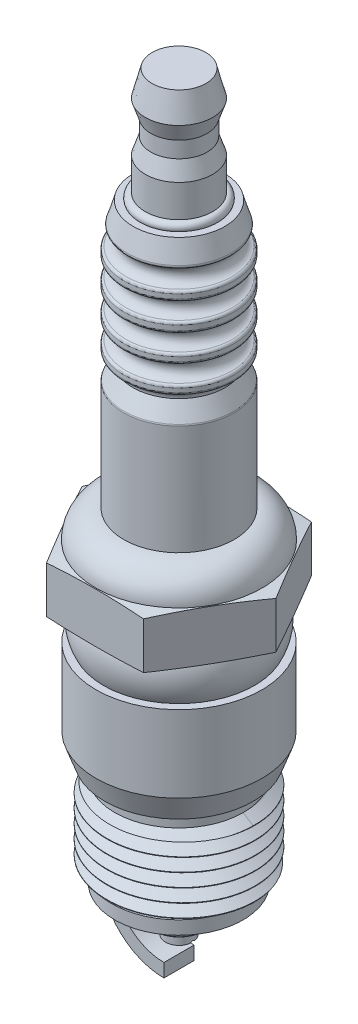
ISO-10303-21;
HEADER;
FILE_DESCRIPTION(('STEP AP214'),'2;1');
FILE_NAME('part.step','',(''),(''),'','','');
FILE_SCHEMA(('AUTOMOTIVE_DESIGN { 1 0 10303 214 1 1 1 1 }'));
ENDSEC;
DATA;
#1=APPLICATION_CONTEXT('core data for automotive mechanical design processes');
#2=APPLICATION_PROTOCOL_DEFINITION('international standard','automotive_design',2000,#1);
#3=PRODUCT_CONTEXT('',#1,'mechanical');
#4=PRODUCT('Part','Part','',(#3));
#5=PRODUCT_RELATED_PRODUCT_CATEGORY('part','',(#4));
#6=PRODUCT_DEFINITION_FORMATION('','',#4);
#7=PRODUCT_DEFINITION_CONTEXT('part definition',#1,'design');
#8=PRODUCT_DEFINITION('design','',#6,#7);
#9=PRODUCT_DEFINITION_SHAPE('','',#8);
#10=(LENGTH_UNIT() NAMED_UNIT(*) SI_UNIT(.MILLI.,.METRE.));
#11=(NAMED_UNIT(*) PLANE_ANGLE_UNIT() SI_UNIT($,.RADIAN.));
#12=(NAMED_UNIT(*) SI_UNIT($,.STERADIAN.) SOLID_ANGLE_UNIT());
#13=UNCERTAINTY_MEASURE_WITH_UNIT(LENGTH_MEASURE(1.E-05),#10,'distance_accuracy_value','');
#14=(GEOMETRIC_REPRESENTATION_CONTEXT(3) GLOBAL_UNCERTAINTY_ASSIGNED_CONTEXT((#13)) GLOBAL_UNIT_ASSIGNED_CONTEXT((#10,
#11,#12)) REPRESENTATION_CONTEXT('',''));
#15=CARTESIAN_POINT('',(0.,0.,0.));
#16=DIRECTION('',(0.,0.,1.));
#17=DIRECTION('',(1.,0.,0.));
#18=AXIS2_PLACEMENT_3D('',#15,#16,#17);
#19=CARTESIAN_POINT('',(0.,-35.941,0.));
#20=DIRECTION('',(0.,1.,0.));
#21=DIRECTION('',(0.,0.,1.));
#22=AXIS2_PLACEMENT_3D('',#19,#20,#21);
#23=CYLINDRICAL_SURFACE('',#22,4.7879);
#24=CARTESIAN_POINT('',(0.,-41.0735130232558,0.));
#25=DIRECTION('',(0.,1.,0.));
#26=DIRECTION('',(-1.,0.,0.));
#27=AXIS2_PLACEMENT_3D('',#24,#25,#26);
#28=CIRCLE('',#27,4.7879);
#29=CARTESIAN_POINT('',(-4.78789999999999,-41.0735130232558,0.));
#30=VERTEX_POINT('',#29);
#31=EDGE_CURVE('E273',#30,#30,#28,.T.);
#32=ORIENTED_EDGE('',*,*,#31,.T.);
#33=EDGE_LOOP('',(#32));
#34=FACE_BOUND('',#33,.T.);
#35=CARTESIAN_POINT('',(0.,-66.5988,0.));
#36=DIRECTION('',(0.,1.,0.));
#37=DIRECTION('',(0.,0.,1.));
#38=AXIS2_PLACEMENT_3D('',#35,#36,#37);
#39=CIRCLE('',#38,4.7879);
#40=CARTESIAN_POINT('',(-4.78420455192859,-66.5988,0.188077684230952));
#41=VERTEX_POINT('',#40);
#42=CARTESIAN_POINT('',(-4.78420455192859,-66.5988,-0.188077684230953));
#43=VERTEX_POINT('',#42);
#44=EDGE_CURVE('E274',#41,#43,#39,.T.);
#45=ORIENTED_EDGE('',*,*,#44,.F.);
#46=CARTESIAN_POINT('',(0.,-129.267019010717,0.));
#47=DIRECTION('',(-0.99709864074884,-0.0761203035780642,0.));
#48=DIRECTION('',(-0.0761203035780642,0.99709864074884,0.));
#49=AXIS2_PLACEMENT_3D('',#46,#47,#48);
#50=ELLIPSE('',#49,62.8991185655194,4.7879);
#51=EDGE_CURVE('E256',#41,#43,#50,.T.);
#52=ORIENTED_EDGE('',*,*,#51,.T.);
#53=EDGE_LOOP('',(#45,#52));
#54=FACE_BOUND('',#53,.T.);
#55=ADVANCED_FACE('F45',(#34,#54),#23,.F.);
#56=CARTESIAN_POINT('',(0.,-66.5988,0.));
#57=DIRECTION('',(0.,1.,0.));
#58=DIRECTION('',(0.,0.,1.));
#59=AXIS2_PLACEMENT_3D('',#56,#57,#58);
#60=PLANE('',#59);
#61=DIRECTION('',(0.,0.,1.));
#62=VECTOR('',#61,1.);
#63=CARTESIAN_POINT('',(-4.78420455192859,-66.5988,0.));
#64=LINE('',#63,#62);
#65=CARTESIAN_POINT('',(-4.78420455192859,-66.5988,-1.4224));
#66=VERTEX_POINT('',#65);
#67=EDGE_CURVE('E492',#66,#43,#64,.T.);
#68=ORIENTED_EDGE('',*,*,#67,.F.);
#69=DIRECTION('',(-1.,0.,0.));
#70=VECTOR('',#69,1.);
#71=CARTESIAN_POINT('',(0.,-66.5988,-1.4224));
#72=LINE('',#71,#70);
#73=CARTESIAN_POINT('',(-5.88854231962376,-66.5988,-1.4224));
#74=VERTEX_POINT('',#73);
#75=EDGE_CURVE('E253',#66,#74,#72,.T.);
#76=ORIENTED_EDGE('',*,*,#75,.T.);
#77=CARTESIAN_POINT('',(0.,-66.5988,0.));
#78=DIRECTION('',(0.,1.,0.));
#79=DIRECTION('',(0.,0.,1.));
#80=AXIS2_PLACEMENT_3D('',#77,#78,#79);
#81=CIRCLE('',#80,6.0579);
#82=CARTESIAN_POINT('',(-5.88854231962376,-66.5988,1.4224));
#83=VERTEX_POINT('',#82);
#84=EDGE_CURVE('E291',#83,#74,#81,.T.);
#85=ORIENTED_EDGE('',*,*,#84,.F.);
#86=DIRECTION('',(1.,0.,0.));
#87=VECTOR('',#86,1.);
#88=CARTESIAN_POINT('',(0.,-66.5988,1.4224));
#89=LINE('',#88,#87);
#90=CARTESIAN_POINT('',(-4.78420455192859,-66.5988,1.4224));
#91=VERTEX_POINT('',#90);
#92=EDGE_CURVE('E250',#83,#91,#89,.T.);
#93=ORIENTED_EDGE('',*,*,#92,.T.);
#94=EDGE_CURVE('E493',#41,#91,#64,.T.);
#95=ORIENTED_EDGE('',*,*,#94,.F.);
#96=ORIENTED_EDGE('',*,*,#44,.T.);
#97=EDGE_LOOP('',(#68,#76,#85,#93,#95,#96));
#98=FACE_BOUND('',#97,.T.);
#99=ADVANCED_FACE('F479',(#98),#60,.F.);
#100=CARTESIAN_POINT('',(0.,-70.8152,0.));
#101=DIRECTION('',(0.,-1.,0.));
#102=DIRECTION('',(1.,0.,0.));
#103=AXIS2_PLACEMENT_3D('',#100,#101,#102);
#104=PLANE('',#103);
#105=DIRECTION('',(1.,0.,0.));
#106=VECTOR('',#105,1.);
#107=CARTESIAN_POINT('',(0.,-70.8152,-0.279400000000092));
#108=LINE('',#107,#106);
#109=CARTESIAN_POINT('',(-1.23888483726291,-70.8151999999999,-0.2794));
#110=VERTEX_POINT('',#109);
#111=CARTESIAN_POINT('',(1.23888483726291,-70.8151999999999,-0.2794));
#112=VERTEX_POINT('',#111);
#113=EDGE_CURVE('E1468',#110,#112,#108,.T.);
#114=ORIENTED_EDGE('',*,*,#113,.F.);
#115=CARTESIAN_POINT('',(0.,-70.8152,0.));
#116=DIRECTION('',(0.,-1.,0.));
#117=DIRECTION('',(1.,0.,0.));
#118=AXIS2_PLACEMENT_3D('',#115,#116,#117);
#119=CIRCLE('',#118,1.27);
#120=EDGE_CURVE('E270',#110,#112,#119,.T.);
#121=ORIENTED_EDGE('',*,*,#120,.T.);
#122=EDGE_LOOP('',(#114,#121));
#123=FACE_BOUND('',#122,.T.);
#124=ADVANCED_FACE('F484',(#123),#104,.T.);
#125=CARTESIAN_POINT('',(0.,0.,0.));
#126=DIRECTION('',(0.,-1.,0.));
#127=DIRECTION('',(0.,0.,-1.));
#128=AXIS2_PLACEMENT_3D('',#125,#126,#127);
#129=PLANE('',#128);
#130=CARTESIAN_POINT('',(0.,0.,0.));
#131=DIRECTION('',(0.,1.,0.));
#132=DIRECTION('',(0.,0.,1.));
#133=AXIS2_PLACEMENT_3D('',#130,#131,#132);
#134=CIRCLE('',#133,2.54);
#135=CARTESIAN_POINT('',(0.,0.,2.54));
#136=VERTEX_POINT('',#135);
#137=EDGE_CURVE('E595',#136,#136,#134,.T.);
#138=ORIENTED_EDGE('',*,*,#137,.T.);
#139=EDGE_LOOP('',(#138));
#140=FACE_BOUND('',#139,.T.);
#141=ADVANCED_FACE('F1151',(#140),#129,.F.);
#142=CARTESIAN_POINT('',(0.,-2.45934442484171,0.));
#143=DIRECTION('',(0.,-1.,0.));
#144=DIRECTION('',(0.,0.,-1.));
#145=AXIS2_PLACEMENT_3D('',#142,#143,#144);
#146=CONICAL_SURFACE('',#145,3.175,0.252680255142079);
#147=ORIENTED_EDGE('',*,*,#137,.F.);
#148=EDGE_LOOP('',(#147));
#149=FACE_BOUND('',#148,.T.);
#150=CARTESIAN_POINT('',(0.,-2.45934442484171,0.));
#151=DIRECTION('',(0.,1.,0.));
#152=DIRECTION('',(0.,0.,1.));
#153=AXIS2_PLACEMENT_3D('',#150,#151,#152);
#154=CIRCLE('',#153,3.175);
#155=CARTESIAN_POINT('',(0.,-2.45934442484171,3.175));
#156=VERTEX_POINT('',#155);
#157=EDGE_CURVE('E592',#156,#156,#154,.T.);
#158=ORIENTED_EDGE('',*,*,#157,.T.);
#159=EDGE_LOOP('',(#158));
#160=FACE_BOUND('',#159,.T.);
#161=ADVANCED_FACE('F1194',(#149,#160),#146,.T.);
#162=CARTESIAN_POINT('',(0.,-4.02608387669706,0.));
#163=DIRECTION('',(0.,1.,0.));
#164=DIRECTION('',(0.,0.,1.));
#165=AXIS2_PLACEMENT_3D('',#162,#163,#164);
#166=CONICAL_SURFACE('',#165,2.6543,0.32086192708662);
#167=ORIENTED_EDGE('',*,*,#157,.F.);
#168=EDGE_LOOP('',(#167));
#169=FACE_BOUND('',#168,.T.);
#170=CARTESIAN_POINT('',(0.,-4.02608387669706,0.));
#171=DIRECTION('',(0.,1.,0.));
#172=DIRECTION('',(0.,0.,1.));
#173=AXIS2_PLACEMENT_3D('',#170,#171,#172);
#174=CIRCLE('',#173,2.6543);
#175=CARTESIAN_POINT('',(0.,-4.02608387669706,2.6543));
#176=VERTEX_POINT('',#175);
#177=EDGE_CURVE('E589',#176,#176,#174,.T.);
#178=ORIENTED_EDGE('',*,*,#177,.T.);
#179=EDGE_LOOP('',(#178));
#180=FACE_BOUND('',#179,.T.);
#181=ADVANCED_FACE('F1202',(#169,#180),#166,.T.);
#182=CARTESIAN_POINT('',(0.,0.,0.));
#183=DIRECTION('',(0.,1.,0.));
#184=DIRECTION('',(0.,0.,1.));
#185=AXIS2_PLACEMENT_3D('',#182,#183,#184);
#186=CYLINDRICAL_SURFACE('',#185,2.6543);
#187=ORIENTED_EDGE('',*,*,#177,.F.);
#188=EDGE_LOOP('',(#187));
#189=FACE_BOUND('',#188,.T.);
#190=CARTESIAN_POINT('',(0.,-5.55008387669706,0.));
#191=DIRECTION('',(0.,1.,0.));
#192=DIRECTION('',(0.,0.,1.));
#193=AXIS2_PLACEMENT_3D('',#190,#191,#192);
#194=CIRCLE('',#193,2.6543);
#195=CARTESIAN_POINT('',(0.,-5.55008387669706,2.6543));
#196=VERTEX_POINT('',#195);
#197=EDGE_CURVE('E586',#196,#196,#194,.T.);
#198=ORIENTED_EDGE('',*,*,#197,.T.);
#199=EDGE_LOOP('',(#198));
#200=FACE_BOUND('',#199,.T.);
#201=ADVANCED_FACE('F1210',(#189,#200),#186,.T.);
#202=CARTESIAN_POINT('',(0.,-7.112,0.));
#203=DIRECTION('',(0.,-1.,0.));
#204=DIRECTION('',(0.,0.,-1.));
#205=AXIS2_PLACEMENT_3D('',#202,#203,#204);
#206=CONICAL_SURFACE('',#205,3.175,0.321785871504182);
#207=ORIENTED_EDGE('',*,*,#197,.F.);
#208=EDGE_LOOP('',(#207));
#209=FACE_BOUND('',#208,.T.);
#210=CARTESIAN_POINT('',(0.,-7.112,0.));
#211=DIRECTION('',(0.,1.,0.));
#212=DIRECTION('',(0.,0.,1.));
#213=AXIS2_PLACEMENT_3D('',#210,#211,#212);
#214=CIRCLE('',#213,3.175);
#215=CARTESIAN_POINT('',(0.,-7.112,3.175));
#216=VERTEX_POINT('',#215);
#217=EDGE_CURVE('E583',#216,#216,#214,.T.);
#218=ORIENTED_EDGE('',*,*,#217,.T.);
#219=EDGE_LOOP('',(#218));
#220=FACE_BOUND('',#219,.T.);
#221=ADVANCED_FACE('F1218',(#209,#220),#206,.T.);
#222=CARTESIAN_POINT('',(0.,0.,0.));
#223=DIRECTION('',(0.,1.,0.));
#224=DIRECTION('',(0.,0.,1.));
#225=AXIS2_PLACEMENT_3D('',#222,#223,#224);
#226=CYLINDRICAL_SURFACE('',#225,3.175);
#227=ORIENTED_EDGE('',*,*,#217,.F.);
#228=EDGE_LOOP('',(#227));
#229=FACE_BOUND('',#228,.T.);
#230=CARTESIAN_POINT('',(0.,-10.16,0.));
#231=DIRECTION('',(0.,1.,0.));
#232=DIRECTION('',(0.,0.,1.));
#233=AXIS2_PLACEMENT_3D('',#230,#231,#232);
#234=CIRCLE('',#233,3.175);
#235=CARTESIAN_POINT('',(0.,-10.16,3.175));
#236=VERTEX_POINT('',#235);
#237=EDGE_CURVE('E580',#236,#236,#234,.T.);
#238=ORIENTED_EDGE('',*,*,#237,.T.);
#239=EDGE_LOOP('',(#238));
#240=FACE_BOUND('',#239,.T.);
#241=ADVANCED_FACE('F1226',(#229,#240),#226,.T.);
#242=CARTESIAN_POINT('',(0.,-10.6123540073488,0.));
#243=DIRECTION('',(0.,1.,0.));
#244=DIRECTION('',(0.,0.,1.));
#245=AXIS2_PLACEMENT_3D('',#242,#243,#244);
#246=TOROIDAL_SURFACE('',#245,3.23886051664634,0.45683948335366);
#247=ORIENTED_EDGE('',*,*,#237,.F.);
#248=EDGE_LOOP('',(#247));
#249=FACE_BOUND('',#248,.T.);
#250=CARTESIAN_POINT('',(0.,-10.795,0.));
#251=DIRECTION('',(0.,1.,0.));
#252=DIRECTION('',(-1.,0.,0.));
#253=AXIS2_PLACEMENT_3D('',#250,#251,#252);
#254=CIRCLE('',#253,3.6576);
#255=CARTESIAN_POINT('',(-3.6576,-10.795,0.));
#256=VERTEX_POINT('',#255);
#257=EDGE_CURVE('E577',#256,#256,#254,.T.);
#258=ORIENTED_EDGE('',*,*,#257,.T.);
#259=EDGE_LOOP('',(#258));
#260=FACE_BOUND('',#259,.T.);
#261=ADVANCED_FACE('F1234',(#249,#260),#246,.T.);
#262=CARTESIAN_POINT('',(0.,-10.795,0.));
#263=DIRECTION('',(0.,1.,0.));
#264=DIRECTION('',(-1.,0.,0.));
#265=AXIS2_PLACEMENT_3D('',#262,#263,#264);
#266=PLANE('',#265);
#267=CARTESIAN_POINT('',(0.,-10.795,0.));
#268=DIRECTION('',(0.,1.,0.));
#269=DIRECTION('',(-1.,0.,0.));
#270=AXIS2_PLACEMENT_3D('',#267,#268,#269);
#271=CIRCLE('',#270,4.318);
#272=CARTESIAN_POINT('',(-4.318,-10.795,0.));
#273=VERTEX_POINT('',#272);
#274=EDGE_CURVE('E571',#273,#273,#271,.T.);
#275=ORIENTED_EDGE('',*,*,#274,.T.);
#276=EDGE_LOOP('',(#275));
#277=FACE_BOUND('',#276,.T.);
#278=ORIENTED_EDGE('',*,*,#257,.F.);
#279=EDGE_LOOP('',(#278));
#280=FACE_BOUND('',#279,.T.);
#281=ADVANCED_FACE('F521',(#277,#280),#266,.T.);
#282=CARTESIAN_POINT('',(0.,-10.795,0.));
#283=DIRECTION('',(0.,1.,0.));
#284=DIRECTION('',(-1.,0.,0.));
#285=AXIS2_PLACEMENT_3D('',#282,#283,#284);
#286=CYLINDRICAL_SURFACE('',#285,5.207);
#287=CARTESIAN_POINT('',(0.,-25.5909549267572,0.));
#288=DIRECTION('',(0.,-1.,0.));
#289=DIRECTION('',(1.,0.,0.));
#290=AXIS2_PLACEMENT_3D('',#287,#288,#289);
#291=CIRCLE('',#290,5.207);
#292=CARTESIAN_POINT('',(5.207,-25.5909549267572,0.));
#293=VERTEX_POINT('',#292);
#294=EDGE_CURVE('E14',#293,#293,#291,.T.);
#295=ORIENTED_EDGE('',*,*,#294,.T.);
#296=EDGE_LOOP('',(#295));
#297=FACE_BOUND('',#296,.T.);
#298=CARTESIAN_POINT('',(0.,-35.941,0.));
#299=DIRECTION('',(0.,1.,0.));
#300=DIRECTION('',(0.,0.,1.));
#301=AXIS2_PLACEMENT_3D('',#298,#299,#300);
#302=CIRCLE('',#301,5.207);
#303=CARTESIAN_POINT('',(0.,-35.941,5.207));
#304=VERTEX_POINT('',#303);
#305=EDGE_CURVE('E525',#304,#304,#302,.T.);
#306=ORIENTED_EDGE('',*,*,#305,.T.);
#307=EDGE_LOOP('',(#306));
#308=FACE_BOUND('',#307,.T.);
#309=ADVANCED_FACE('F518',(#297,#308),#286,.T.);
#310=CARTESIAN_POINT('',(0.,-23.9444298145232,0.));
#311=DIRECTION('',(0.,-1.,0.));
#312=DIRECTION('',(1.,0.,0.));
#313=AXIS2_PLACEMENT_3D('',#310,#311,#312);
#314=CONICAL_SURFACE('',#313,4.3561,0.493327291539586);
#315=CARTESIAN_POINT('',(0.,-25.4706709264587,0.));
#316=DIRECTION('',(0.,1.,0.));
#317=DIRECTION('',(-1.,0.,0.));
#318=AXIS2_PLACEMENT_3D('',#315,#316,#317);
#319=CIRCLE('',#318,5.17671356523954);
#320=CARTESIAN_POINT('',(-5.17671356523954,-25.4706709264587,0.));
#321=VERTEX_POINT('',#320);
#322=EDGE_CURVE('E53',#321,#321,#319,.T.);
#323=ORIENTED_EDGE('',*,*,#322,.T.);
#324=EDGE_LOOP('',(#323));
#325=FACE_BOUND('',#324,.T.);
#326=CARTESIAN_POINT('',(0.,-23.9444298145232,0.));
#327=DIRECTION('',(0.,1.,0.));
#328=DIRECTION('',(-1.,0.,0.));
#329=AXIS2_PLACEMENT_3D('',#326,#327,#328);
#330=CIRCLE('',#329,4.3561);
#331=CARTESIAN_POINT('',(-4.3561,-23.9444298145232,0.));
#332=VERTEX_POINT('',#331);
#333=EDGE_CURVE('E574',#332,#332,#330,.T.);
#334=ORIENTED_EDGE('',*,*,#333,.F.);
#335=EDGE_LOOP('',(#334));
#336=FACE_BOUND('',#335,.T.);
#337=ADVANCED_FACE('F504',(#325,#336),#314,.T.);
#338=CARTESIAN_POINT('',(0.,-23.9444298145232,0.));
#339=DIRECTION('',(0.,1.,0.));
#340=DIRECTION('',(-1.,0.,0.));
#341=AXIS2_PLACEMENT_3D('',#338,#339,#340);
#342=TOROIDAL_SURFACE('',#341,5.207,0.850900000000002);
#343=CARTESIAN_POINT('',(0.,-23.1163187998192,0.));
#344=DIRECTION('',(0.,-1.,0.));
#345=DIRECTION('',(1.,0.,0.));
#346=AXIS2_PLACEMENT_3D('',#343,#344,#345);
#347=CIRCLE('',#346,5.01139080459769);
#348=CARTESIAN_POINT('',(5.01139080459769,-23.1163187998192,0.));
#349=VERTEX_POINT('',#348);
#350=EDGE_CURVE('E604',#349,#349,#347,.T.);
#351=ORIENTED_EDGE('',*,*,#350,.T.);
#352=EDGE_LOOP('',(#351));
#353=FACE_BOUND('',#352,.T.);
#354=ORIENTED_EDGE('',*,*,#333,.T.);
#355=EDGE_LOOP('',(#354));
#356=FACE_BOUND('',#355,.T.);
#357=ADVANCED_FACE('F923',(#353,#356),#342,.F.);
#358=CARTESIAN_POINT('',(0.,-10.795,0.));
#359=DIRECTION('',(0.,1.,0.));
#360=DIRECTION('',(-1.,0.,0.));
#361=AXIS2_PLACEMENT_3D('',#358,#359,#360);
#362=CYLINDRICAL_SURFACE('',#361,5.207);
#363=CARTESIAN_POINT('',(0.,-22.8691214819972,0.));
#364=DIRECTION('',(0.,-1.,0.));
#365=DIRECTION('',(1.,0.,0.));
#366=AXIS2_PLACEMENT_3D('',#363,#364,#365);
#367=CIRCLE('',#366,5.207);
#368=CARTESIAN_POINT('',(5.207,-22.8691214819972,0.));
#369=VERTEX_POINT('',#368);
#370=EDGE_CURVE('E601',#369,#369,#367,.F.);
#371=ORIENTED_EDGE('',*,*,#370,.T.);
#372=EDGE_LOOP('',(#371));
#373=FACE_BOUND('',#372,.T.);
#374=CARTESIAN_POINT('',(0.,-22.4797381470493,0.));
#375=DIRECTION('',(0.,-1.,0.));
#376=DIRECTION('',(1.,0.,0.));
#377=AXIS2_PLACEMENT_3D('',#374,#375,#376);
#378=CIRCLE('',#377,5.207);
#379=CARTESIAN_POINT('',(5.207,-22.4797381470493,0.));
#380=VERTEX_POINT('',#379);
#381=EDGE_CURVE('E598',#380,#380,#378,.T.);
#382=ORIENTED_EDGE('',*,*,#381,.T.);
#383=EDGE_LOOP('',(#382));
#384=FACE_BOUND('',#383,.T.);
#385=ADVANCED_FACE('F936',(#373,#384),#362,.T.);
#386=CARTESIAN_POINT('',(0.,-21.4044298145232,0.));
#387=DIRECTION('',(0.,1.,0.));
#388=DIRECTION('',(-1.,0.,0.));
#389=AXIS2_PLACEMENT_3D('',#386,#387,#388);
#390=TOROIDAL_SURFACE('',#389,5.207,0.850900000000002);
#391=CARTESIAN_POINT('',(0.,-22.2325408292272,0.));
#392=DIRECTION('',(0.,1.,0.));
#393=DIRECTION('',(-1.,0.,0.));
#394=AXIS2_PLACEMENT_3D('',#391,#392,#393);
#395=CIRCLE('',#394,5.0113908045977);
#396=CARTESIAN_POINT('',(-5.0113908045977,-22.2325408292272,0.));
#397=VERTEX_POINT('',#396);
#398=EDGE_CURVE('E610',#397,#397,#395,.T.);
#399=ORIENTED_EDGE('',*,*,#398,.T.);
#400=EDGE_LOOP('',(#399));
#401=FACE_BOUND('',#400,.T.);
#402=CARTESIAN_POINT('',(0.,-20.5763187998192,0.));
#403=DIRECTION('',(0.,-1.,0.));
#404=DIRECTION('',(1.,0.,0.));
#405=AXIS2_PLACEMENT_3D('',#402,#403,#404);
#406=CIRCLE('',#405,5.01139080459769);
#407=CARTESIAN_POINT('',(5.01139080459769,-20.5763187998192,0.));
#408=VERTEX_POINT('',#407);
#409=EDGE_CURVE('E607',#408,#408,#406,.T.);
#410=ORIENTED_EDGE('',*,*,#409,.T.);
#411=EDGE_LOOP('',(#410));
#412=FACE_BOUND('',#411,.T.);
#413=ADVANCED_FACE('F944',(#401,#412),#390,.F.);
#414=CARTESIAN_POINT('',(0.,-10.795,0.));
#415=DIRECTION('',(0.,1.,0.));
#416=DIRECTION('',(-1.,0.,0.));
#417=AXIS2_PLACEMENT_3D('',#414,#415,#416);
#418=CYLINDRICAL_SURFACE('',#417,5.207);
#419=CARTESIAN_POINT('',(0.,-20.3291214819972,0.));
#420=DIRECTION('',(0.,-1.,0.));
#421=DIRECTION('',(1.,0.,0.));
#422=AXIS2_PLACEMENT_3D('',#419,#420,#421);
#423=CIRCLE('',#422,5.207);
#424=CARTESIAN_POINT('',(5.207,-20.3291214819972,0.));
#425=VERTEX_POINT('',#424);
#426=EDGE_CURVE('E616',#425,#425,#423,.F.);
#427=ORIENTED_EDGE('',*,*,#426,.T.);
#428=EDGE_LOOP('',(#427));
#429=FACE_BOUND('',#428,.T.);
#430=CARTESIAN_POINT('',(0.,-19.9244551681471,0.));
#431=DIRECTION('',(0.,-1.,0.));
#432=DIRECTION('',(1.,0.,0.));
#433=AXIS2_PLACEMENT_3D('',#430,#431,#432);
#434=CIRCLE('',#433,5.207);
#435=CARTESIAN_POINT('',(5.207,-19.9244551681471,0.));
#436=VERTEX_POINT('',#435);
#437=EDGE_CURVE('E613',#436,#436,#434,.T.);
#438=ORIENTED_EDGE('',*,*,#437,.T.);
#439=EDGE_LOOP('',(#438));
#440=FACE_BOUND('',#439,.T.);
#441=ADVANCED_FACE('F952',(#429,#440),#418,.T.);
#442=CARTESIAN_POINT('',(0.,-18.8644298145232,0.));
#443=DIRECTION('',(0.,1.,0.));
#444=DIRECTION('',(-1.,0.,0.));
#445=AXIS2_PLACEMENT_3D('',#442,#443,#444);
#446=TOROIDAL_SURFACE('',#445,5.1878236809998,0.831723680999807);
#447=CARTESIAN_POINT('',(0.,-19.6764671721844,0.));
#448=DIRECTION('',(0.,1.,0.));
#449=DIRECTION('',(-1.,0.,0.));
#450=AXIS2_PLACEMENT_3D('',#447,#448,#449);
#451=CIRCLE('',#450,5.00793590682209);
#452=CARTESIAN_POINT('',(-5.00793590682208,-19.6764671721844,0.));
#453=VERTEX_POINT('',#452);
#454=EDGE_CURVE('E622',#453,#453,#451,.T.);
#455=ORIENTED_EDGE('',*,*,#454,.T.);
#456=EDGE_LOOP('',(#455));
#457=FACE_BOUND('',#456,.T.);
#458=CARTESIAN_POINT('',(0.,-18.052392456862,0.));
#459=DIRECTION('',(0.,-1.,0.));
#460=DIRECTION('',(1.,0.,0.));
#461=AXIS2_PLACEMENT_3D('',#458,#459,#460);
#462=CIRCLE('',#461,5.00793590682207);
#463=CARTESIAN_POINT('',(5.00793590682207,-18.052392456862,0.));
#464=VERTEX_POINT('',#463);
#465=EDGE_CURVE('E619',#464,#464,#462,.T.);
#466=ORIENTED_EDGE('',*,*,#465,.T.);
#467=EDGE_LOOP('',(#466));
#468=FACE_BOUND('',#467,.T.);
#469=ADVANCED_FACE('F960',(#457,#468),#446,.F.);
#470=CARTESIAN_POINT('',(0.,-10.795,0.));
#471=DIRECTION('',(0.,1.,0.));
#472=DIRECTION('',(-1.,0.,0.));
#473=AXIS2_PLACEMENT_3D('',#470,#471,#472);
#474=CYLINDRICAL_SURFACE('',#473,5.207);
#475=CARTESIAN_POINT('',(0.,-17.8044044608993,0.));
#476=DIRECTION('',(0.,-1.,0.));
#477=DIRECTION('',(1.,0.,0.));
#478=AXIS2_PLACEMENT_3D('',#475,#476,#477);
#479=CIRCLE('',#478,5.207);
#480=CARTESIAN_POINT('',(5.207,-17.8044044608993,0.));
#481=VERTEX_POINT('',#480);
#482=EDGE_CURVE('E628',#481,#481,#479,.F.);
#483=ORIENTED_EDGE('',*,*,#482,.T.);
#484=EDGE_LOOP('',(#483));
#485=FACE_BOUND('',#484,.T.);
#486=CARTESIAN_POINT('',(0.,-17.3354227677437,0.));
#487=DIRECTION('',(0.,-1.,0.));
#488=DIRECTION('',(1.,0.,0.));
#489=AXIS2_PLACEMENT_3D('',#486,#487,#488);
#490=CIRCLE('',#489,5.207);
#491=CARTESIAN_POINT('',(5.207,-17.3354227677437,0.));
#492=VERTEX_POINT('',#491);
#493=EDGE_CURVE('E625',#492,#492,#490,.T.);
#494=ORIENTED_EDGE('',*,*,#493,.T.);
#495=EDGE_LOOP('',(#494));
#496=FACE_BOUND('',#495,.T.);
#497=ADVANCED_FACE('F968',(#485,#496),#474,.T.);
#498=CARTESIAN_POINT('',(0.,-16.2753974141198,0.));
#499=DIRECTION('',(0.,1.,0.));
#500=DIRECTION('',(-1.,0.,0.));
#501=AXIS2_PLACEMENT_3D('',#498,#499,#500);
#502=TOROIDAL_SURFACE('',#501,5.1878236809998,0.831723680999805);
#503=CARTESIAN_POINT('',(0.,-17.0874347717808,0.));
#504=DIRECTION('',(0.,1.,0.));
#505=DIRECTION('',(-1.,0.,0.));
#506=AXIS2_PLACEMENT_3D('',#503,#504,#505);
#507=CIRCLE('',#506,5.00793590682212);
#508=CARTESIAN_POINT('',(-5.00793590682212,-17.0874347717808,0.));
#509=VERTEX_POINT('',#508);
#510=EDGE_CURVE('E634',#509,#509,#507,.T.);
#511=ORIENTED_EDGE('',*,*,#510,.T.);
#512=EDGE_LOOP('',(#511));
#513=FACE_BOUND('',#512,.T.);
#514=CARTESIAN_POINT('',(0.,-15.4633600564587,0.));
#515=DIRECTION('',(0.,-1.,0.));
#516=DIRECTION('',(1.,0.,0.));
#517=AXIS2_PLACEMENT_3D('',#514,#515,#516);
#518=CIRCLE('',#517,5.00793590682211);
#519=CARTESIAN_POINT('',(5.00793590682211,-15.4633600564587,0.));
#520=VERTEX_POINT('',#519);
#521=EDGE_CURVE('E631',#520,#520,#518,.T.);
#522=ORIENTED_EDGE('',*,*,#521,.T.);
#523=EDGE_LOOP('',(#522));
#524=FACE_BOUND('',#523,.T.);
#525=ADVANCED_FACE('F976',(#513,#524),#502,.F.);
#526=CARTESIAN_POINT('',(0.,-10.795,0.));
#527=DIRECTION('',(0.,1.,0.));
#528=DIRECTION('',(-1.,0.,0.));
#529=AXIS2_PLACEMENT_3D('',#526,#527,#528);
#530=CYLINDRICAL_SURFACE('',#529,5.207);
#531=CARTESIAN_POINT('',(0.,-15.2153720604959,0.));
#532=DIRECTION('',(0.,-1.,0.));
#533=DIRECTION('',(1.,0.,0.));
#534=AXIS2_PLACEMENT_3D('',#531,#532,#533);
#535=CIRCLE('',#534,5.207);
#536=CARTESIAN_POINT('',(5.207,-15.2153720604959,0.));
#537=VERTEX_POINT('',#536);
#538=EDGE_CURVE('E640',#537,#537,#535,.F.);
#539=ORIENTED_EDGE('',*,*,#538,.T.);
#540=EDGE_LOOP('',(#539));
#541=FACE_BOUND('',#540,.T.);
#542=CARTESIAN_POINT('',(0.,-14.7913083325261,0.));
#543=DIRECTION('',(0.,-1.,0.));
#544=DIRECTION('',(1.,0.,0.));
#545=AXIS2_PLACEMENT_3D('',#542,#543,#544);
#546=CIRCLE('',#545,5.207);
#547=CARTESIAN_POINT('',(5.207,-14.7913083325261,0.));
#548=VERTEX_POINT('',#547);
#549=EDGE_CURVE('E637',#548,#548,#546,.T.);
#550=ORIENTED_EDGE('',*,*,#549,.T.);
#551=EDGE_LOOP('',(#550));
#552=FACE_BOUND('',#551,.T.);
#553=ADVANCED_FACE('F984',(#541,#552),#530,.T.);
#554=CARTESIAN_POINT('',(0.,-13.716,0.));
#555=DIRECTION('',(0.,1.,0.));
#556=DIRECTION('',(-1.,0.,0.));
#557=AXIS2_PLACEMENT_3D('',#554,#555,#556);
#558=TOROIDAL_SURFACE('',#557,5.207,0.850900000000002);
#559=CARTESIAN_POINT('',(0.,-14.544111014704,0.));
#560=DIRECTION('',(0.,1.,0.));
#561=DIRECTION('',(-1.,0.,0.));
#562=AXIS2_PLACEMENT_3D('',#559,#560,#561);
#563=CIRCLE('',#562,5.0113908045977);
#564=CARTESIAN_POINT('',(-5.0113908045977,-14.544111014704,0.));
#565=VERTEX_POINT('',#564);
#566=EDGE_CURVE('E646',#565,#565,#563,.T.);
#567=ORIENTED_EDGE('',*,*,#566,.T.);
#568=EDGE_LOOP('',(#567));
#569=FACE_BOUND('',#568,.T.);
#570=CARTESIAN_POINT('',(0.,-12.9830759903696,0.));
#571=DIRECTION('',(0.,-1.,0.));
#572=DIRECTION('',(1.,0.,0.));
#573=AXIS2_PLACEMENT_3D('',#570,#571,#572);
#574=CIRCLE('',#573,4.77473479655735);
#575=CARTESIAN_POINT('',(4.77473479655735,-12.9830759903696,0.));
#576=VERTEX_POINT('',#575);
#577=EDGE_CURVE('E643',#576,#576,#574,.T.);
#578=ORIENTED_EDGE('',*,*,#577,.T.);
#579=EDGE_LOOP('',(#578));
#580=FACE_BOUND('',#579,.T.);
#581=ADVANCED_FACE('F992',(#569,#580),#558,.F.);
#582=CARTESIAN_POINT('',(0.,-10.795,0.));
#583=DIRECTION('',(0.,-1.,0.));
#584=DIRECTION('',(1.,0.,0.));
#585=AXIS2_PLACEMENT_3D('',#582,#583,#584);
#586=CONICAL_SURFACE('',#585,4.318,0.292470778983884);
#587=CARTESIAN_POINT('',(0.,-12.691059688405,0.));
#588=DIRECTION('',(0.,1.,0.));
#589=DIRECTION('',(-1.,0.,0.));
#590=AXIS2_PLACEMENT_3D('',#587,#588,#589);
#591=CIRCLE('',#590,4.88891415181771);
#592=CARTESIAN_POINT('',(-4.88891415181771,-12.691059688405,0.));
#593=VERTEX_POINT('',#592);
#594=EDGE_CURVE('E648',#593,#593,#591,.T.);
#595=ORIENTED_EDGE('',*,*,#594,.T.);
#596=EDGE_LOOP('',(#595));
#597=FACE_BOUND('',#596,.T.);
#598=ORIENTED_EDGE('',*,*,#274,.F.);
#599=EDGE_LOOP('',(#598));
#600=FACE_BOUND('',#599,.T.);
#601=ADVANCED_FACE('F1000',(#597,#600),#586,.T.);
#602=CARTESIAN_POINT('',(0.,-22.8691214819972,0.));
#603=DIRECTION('',(0.,-1.,0.));
#604=DIRECTION('',(1.,0.,0.));
#605=AXIS2_PLACEMENT_3D('',#602,#603,#604);
#606=TOROIDAL_SURFACE('',#605,4.953,0.254);
#607=ORIENTED_EDGE('',*,*,#350,.F.);
#608=EDGE_LOOP('',(#607));
#609=FACE_BOUND('',#608,.T.);
#610=ORIENTED_EDGE('',*,*,#370,.F.);
#611=EDGE_LOOP('',(#610));
#612=FACE_BOUND('',#611,.T.);
#613=ADVANCED_FACE('F1008',(#609,#612),#606,.T.);
#614=CARTESIAN_POINT('',(0.,-22.4797381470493,0.));
#615=DIRECTION('',(0.,-1.,0.));
#616=DIRECTION('',(1.,0.,0.));
#617=AXIS2_PLACEMENT_3D('',#614,#615,#616);
#618=TOROIDAL_SURFACE('',#617,4.953,0.254);
#619=ORIENTED_EDGE('',*,*,#381,.F.);
#620=EDGE_LOOP('',(#619));
#621=FACE_BOUND('',#620,.T.);
#622=ORIENTED_EDGE('',*,*,#398,.F.);
#623=EDGE_LOOP('',(#622));
#624=FACE_BOUND('',#623,.T.);
#625=ADVANCED_FACE('F1015',(#621,#624),#618,.T.);
#626=CARTESIAN_POINT('',(0.,-20.3291214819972,0.));
#627=DIRECTION('',(0.,-1.,0.));
#628=DIRECTION('',(1.,0.,0.));
#629=AXIS2_PLACEMENT_3D('',#626,#627,#628);
#630=TOROIDAL_SURFACE('',#629,4.953,0.254);
#631=ORIENTED_EDGE('',*,*,#409,.F.);
#632=EDGE_LOOP('',(#631));
#633=FACE_BOUND('',#632,.T.);
#634=ORIENTED_EDGE('',*,*,#426,.F.);
#635=EDGE_LOOP('',(#634));
#636=FACE_BOUND('',#635,.T.);
#637=ADVANCED_FACE('F1023',(#633,#636),#630,.T.);
#638=CARTESIAN_POINT('',(0.,-19.9244551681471,0.));
#639=DIRECTION('',(0.,-1.,0.));
#640=DIRECTION('',(1.,0.,0.));
#641=AXIS2_PLACEMENT_3D('',#638,#639,#640);
#642=TOROIDAL_SURFACE('',#641,4.953,0.254);
#643=ORIENTED_EDGE('',*,*,#437,.F.);
#644=EDGE_LOOP('',(#643));
#645=FACE_BOUND('',#644,.T.);
#646=ORIENTED_EDGE('',*,*,#454,.F.);
#647=EDGE_LOOP('',(#646));
#648=FACE_BOUND('',#647,.T.);
#649=ADVANCED_FACE('F1031',(#645,#648),#642,.T.);
#650=CARTESIAN_POINT('',(0.,-17.8044044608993,0.));
#651=DIRECTION('',(0.,-1.,0.));
#652=DIRECTION('',(1.,0.,0.));
#653=AXIS2_PLACEMENT_3D('',#650,#651,#652);
#654=TOROIDAL_SURFACE('',#653,4.953,0.254);
#655=ORIENTED_EDGE('',*,*,#465,.F.);
#656=EDGE_LOOP('',(#655));
#657=FACE_BOUND('',#656,.T.);
#658=ORIENTED_EDGE('',*,*,#482,.F.);
#659=EDGE_LOOP('',(#658));
#660=FACE_BOUND('',#659,.T.);
#661=ADVANCED_FACE('F1039',(#657,#660),#654,.T.);
#662=CARTESIAN_POINT('',(0.,-17.3354227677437,0.));
#663=DIRECTION('',(0.,-1.,0.));
#664=DIRECTION('',(1.,0.,0.));
#665=AXIS2_PLACEMENT_3D('',#662,#663,#664);
#666=TOROIDAL_SURFACE('',#665,4.953,0.254);
#667=ORIENTED_EDGE('',*,*,#493,.F.);
#668=EDGE_LOOP('',(#667));
#669=FACE_BOUND('',#668,.T.);
#670=ORIENTED_EDGE('',*,*,#510,.F.);
#671=EDGE_LOOP('',(#670));
#672=FACE_BOUND('',#671,.T.);
#673=ADVANCED_FACE('F1047',(#669,#672),#666,.T.);
#674=CARTESIAN_POINT('',(0.,-15.2153720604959,0.));
#675=DIRECTION('',(0.,-1.,0.));
#676=DIRECTION('',(1.,0.,0.));
#677=AXIS2_PLACEMENT_3D('',#674,#675,#676);
#678=TOROIDAL_SURFACE('',#677,4.953,0.254);
#679=ORIENTED_EDGE('',*,*,#521,.F.);
#680=EDGE_LOOP('',(#679));
#681=FACE_BOUND('',#680,.T.);
#682=ORIENTED_EDGE('',*,*,#538,.F.);
#683=EDGE_LOOP('',(#682));
#684=FACE_BOUND('',#683,.T.);
#685=ADVANCED_FACE('F1055',(#681,#684),#678,.T.);
#686=CARTESIAN_POINT('',(0.,-14.7913083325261,0.));
#687=DIRECTION('',(0.,-1.,0.));
#688=DIRECTION('',(1.,0.,0.));
#689=AXIS2_PLACEMENT_3D('',#686,#687,#688);
#690=TOROIDAL_SURFACE('',#689,4.953,0.254);
#691=ORIENTED_EDGE('',*,*,#549,.F.);
#692=EDGE_LOOP('',(#691));
#693=FACE_BOUND('',#692,.T.);
#694=ORIENTED_EDGE('',*,*,#566,.F.);
#695=EDGE_LOOP('',(#694));
#696=FACE_BOUND('',#695,.T.);
#697=ADVANCED_FACE('F1063',(#693,#696),#690,.T.);
#698=CARTESIAN_POINT('',(0.,-12.7642927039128,0.));
#699=DIRECTION('',(0.,-1.,0.));
#700=DIRECTION('',(1.,0.,0.));
#701=AXIS2_PLACEMENT_3D('',#698,#699,#700);
#702=TOROIDAL_SURFACE('',#701,4.64570040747,0.254);
#703=ORIENTED_EDGE('',*,*,#577,.F.);
#704=EDGE_LOOP('',(#703));
#705=FACE_BOUND('',#704,.T.);
#706=ORIENTED_EDGE('',*,*,#594,.F.);
#707=EDGE_LOOP('',(#706));
#708=FACE_BOUND('',#707,.T.);
#709=ADVANCED_FACE('F1071',(#705,#708),#702,.T.);
#710=CARTESIAN_POINT('',(0.,-38.5826,0.));
#711=DIRECTION('',(0.,1.,0.));
#712=DIRECTION('',(0.,0.,1.));
#713=AXIS2_PLACEMENT_3D('',#710,#711,#712);
#714=TOROIDAL_SURFACE('',#713,5.207,2.64159999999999);
#715=ORIENTED_EDGE('',*,*,#305,.F.);
#716=EDGE_LOOP('',(#715));
#717=FACE_BOUND('',#716,.T.);
#718=CARTESIAN_POINT('',(0.,-38.5826,0.));
#719=DIRECTION('',(0.,1.,0.));
#720=DIRECTION('',(0.,0.,1.));
#721=AXIS2_PLACEMENT_3D('',#718,#719,#720);
#722=CIRCLE('',#721,7.84859999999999);
#723=CARTESIAN_POINT('',(0.,-38.5826,7.84859999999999));
#724=VERTEX_POINT('',#723);
#725=EDGE_CURVE('E541',#724,#724,#722,.T.);
#726=ORIENTED_EDGE('',*,*,#725,.T.);
#727=EDGE_LOOP('',(#726));
#728=FACE_BOUND('',#727,.T.);
#729=ADVANCED_FACE('F403',(#717,#728),#714,.T.);
#730=CARTESIAN_POINT('',(0.,-38.7731,0.));
#731=DIRECTION('',(0.,-1.,0.));
#732=DIRECTION('',(0.,0.,-1.));
#733=AXIS2_PLACEMENT_3D('',#730,#731,#732);
#734=CONICAL_SURFACE('',#733,9.15077082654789,1.42553261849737);
#735=ORIENTED_EDGE('',*,*,#725,.F.);
#736=EDGE_LOOP('',(#735));
#737=FACE_BOUND('',#736,.T.);
#738=CARTESIAN_POINT('',(4.57526994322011,-38.7731168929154,7.925));
#739=CARTESIAN_POINT('',(4.76572932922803,-38.745241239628,7.59511466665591));
#740=CARTESIAN_POINT('',(4.95629289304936,-38.7199779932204,7.26504889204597));
#741=CARTESIAN_POINT('',(5.33762099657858,-38.6756441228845,6.60456924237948));
#742=CARTESIAN_POINT('',(5.5283855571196,-38.65657422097,6.27415533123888));
#743=CARTESIAN_POINT('',(5.90976855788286,-38.6256257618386,5.61358059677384));
#744=CARTESIAN_POINT('',(6.10038676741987,-38.6137361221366,5.28342017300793));
#745=CARTESIAN_POINT('',(6.48169602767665,-38.5977972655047,4.62297316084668));
#746=CARTESIAN_POINT('',(6.67238707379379,-38.5937476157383,4.29268658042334));
#747=CARTESIAN_POINT('',(7.05376916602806,-38.5937476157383,3.63211341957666));
#748=CARTESIAN_POINT('',(7.2444602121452,-38.5977972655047,3.30182683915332));
#749=CARTESIAN_POINT('',(7.62576947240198,-38.6137361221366,2.64137982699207));
#750=CARTESIAN_POINT('',(7.81638768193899,-38.6256257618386,2.31121940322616));
#751=CARTESIAN_POINT('',(8.19777068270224,-38.65657422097,1.65064466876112));
#752=CARTESIAN_POINT('',(8.38853524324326,-38.6756441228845,1.32023075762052));
#753=CARTESIAN_POINT('',(8.76986334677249,-38.7199779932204,0.659751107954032));
#754=CARTESIAN_POINT('',(8.96042691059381,-38.745241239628,0.329685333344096));
#755=CARTESIAN_POINT('',(9.15088629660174,-38.7731168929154,-0.00020000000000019));
#756=B_SPLINE_CURVE_WITH_KNOTS('',3,(#738,#739,#740,#741,#742,#743,#744,#745,#746,#747,#748,
#749,#750,#751,#752,#753,#754,#755),.UNSPECIFIED.,.F.,.F.,(4,2,2,2,2,2,2,2,4),(0.,
1.14582899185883,2.29179151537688,3.43598073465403,4.58010678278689,5.72423283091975,
6.8684220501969,8.01438457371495,9.16021356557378),.UNSPECIFIED.);
#757=CARTESIAN_POINT('',(4.57538541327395,-38.7731,7.9248));
#758=VERTEX_POINT('',#757);
#759=CARTESIAN_POINT('',(9.1507708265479,-38.7731,0.));
#760=VERTEX_POINT('',#759);
#761=EDGE_CURVE('E425',#758,#760,#756,.T.);
#762=ORIENTED_EDGE('',*,*,#761,.T.);
#763=CARTESIAN_POINT('',(9.15088629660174,-38.7731168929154,0.000200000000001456));
#764=CARTESIAN_POINT('',(8.96042691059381,-38.745241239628,-0.329685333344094));
#765=CARTESIAN_POINT('',(8.76986334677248,-38.7199779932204,-0.65975110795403));
#766=CARTESIAN_POINT('',(8.38853524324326,-38.6756441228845,-1.32023075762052));
#767=CARTESIAN_POINT('',(8.19777068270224,-38.65657422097,-1.65064466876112));
#768=CARTESIAN_POINT('',(7.81638768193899,-38.6256257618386,-2.31121940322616));
#769=CARTESIAN_POINT('',(7.62576947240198,-38.6137361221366,-2.64137982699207));
#770=CARTESIAN_POINT('',(7.2444602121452,-38.5977972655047,-3.30182683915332));
#771=CARTESIAN_POINT('',(7.05376916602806,-38.5937476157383,-3.63211341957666));
#772=CARTESIAN_POINT('',(6.67238707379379,-38.5937476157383,-4.29268658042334));
#773=CARTESIAN_POINT('',(6.48169602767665,-38.5977972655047,-4.62297316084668));
#774=CARTESIAN_POINT('',(6.10038676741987,-38.6137361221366,-5.28342017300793));
#775=CARTESIAN_POINT('',(5.90976855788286,-38.6256257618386,-5.61358059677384));
#776=CARTESIAN_POINT('',(5.52838555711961,-38.65657422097,-6.27415533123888));
#777=CARTESIAN_POINT('',(5.33762099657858,-38.6756441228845,-6.60456924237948));
#778=CARTESIAN_POINT('',(4.95629289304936,-38.7199779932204,-7.26504889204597));
#779=CARTESIAN_POINT('',(4.76572932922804,-38.745241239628,-7.59511466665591));
#780=CARTESIAN_POINT('',(4.57526994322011,-38.7731168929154,-7.925));
#781=B_SPLINE_CURVE_WITH_KNOTS('',3,(#763,#764,#765,#766,#767,#768,#769,#770,#771,#772,#773,
#774,#775,#776,#777,#778,#779,#780),.UNSPECIFIED.,.F.,.F.,(4,2,2,2,2,2,2,2,4),(0.,
1.14582899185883,2.29179151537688,3.43598073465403,4.58010678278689,5.72423283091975,
6.8684220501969,8.01438457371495,9.16021356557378),.UNSPECIFIED.);
#782=CARTESIAN_POINT('',(4.57538541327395,-38.7731,-7.9248));
#783=VERTEX_POINT('',#782);
#784=EDGE_CURVE('E431',#760,#783,#781,.T.);
#785=ORIENTED_EDGE('',*,*,#784,.T.);
#786=CARTESIAN_POINT('',(-12.07674964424,-39.5475759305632,-7.9248));
#787=CARTESIAN_POINT('',(-11.7170342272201,-39.5035899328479,-7.9248));
#788=CARTESIAN_POINT('',(-11.357248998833,-39.4601651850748,-7.9248));
#789=CARTESIAN_POINT('',(-10.6375055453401,-39.3747336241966,-7.9248));
#790=CARTESIAN_POINT('',(-10.2775473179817,-39.332726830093,-7.9248));
#791=CARTESIAN_POINT('',(-9.55732846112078,-39.2504157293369,-7.9248));
#792=CARTESIAN_POINT('',(-9.19706777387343,-39.2101119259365,-7.9248));
#793=CARTESIAN_POINT('',(-8.47631727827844,-39.1316127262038,-7.9248));
#794=CARTESIAN_POINT('',(-8.11582747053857,-39.093417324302,-7.9248));
#795=CARTESIAN_POINT('',(-7.3954075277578,-39.0197030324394,-7.9248));
#796=CARTESIAN_POINT('',(-7.03547800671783,-38.9841782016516,-7.9248));
#797=CARTESIAN_POINT('',(-6.31532022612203,-38.9163055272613,-7.9248));
#798=CARTESIAN_POINT('',(-5.95509196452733,-38.8839577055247,-7.9248));
#799=CARTESIAN_POINT('',(-4.87393349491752,-38.7927300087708,-7.9248));
#800=CARTESIAN_POINT('',(-4.1524804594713,-38.7396606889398,-7.9248));
#801=CARTESIAN_POINT('',(-3.06817307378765,-38.6766566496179,-7.9248));
#802=CARTESIAN_POINT('',(-2.7057995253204,-38.6584060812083,-7.9248));
#803=CARTESIAN_POINT('',(-1.9807818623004,-38.628331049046,-7.9248));
#804=CARTESIAN_POINT('',(-1.61813774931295,-38.6165065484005,-7.9248));
#805=CARTESIAN_POINT('',(-0.892730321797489,-38.599903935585,-7.9248));
#806=CARTESIAN_POINT('',(-0.529967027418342,-38.5951249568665,-7.9248));
#807=CARTESIAN_POINT('',(0.195582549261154,-38.5928862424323,-7.9248));
#808=CARTESIAN_POINT('',(0.558368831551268,-38.5954265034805,-7.9248));
#809=CARTESIAN_POINT('',(1.28420829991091,-38.607684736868,-7.9248));
#810=CARTESIAN_POINT('',(1.64726135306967,-38.6174104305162,-7.9248));
#811=CARTESIAN_POINT('',(2.3731257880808,-38.6435178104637,-7.9248));
#812=CARTESIAN_POINT('',(2.73593716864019,-38.6598995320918,-7.9248));
#813=CARTESIAN_POINT('',(3.46130495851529,-38.6985400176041,-7.9248));
#814=CARTESIAN_POINT('',(3.82386131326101,-38.7207997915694,-7.9248));
#815=CARTESIAN_POINT('',(4.54862781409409,-38.7703256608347,-7.9248));
#816=CARTESIAN_POINT('',(4.91083795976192,-38.7975917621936,-7.9248));
#817=CARTESIAN_POINT('',(5.95897249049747,-38.8825174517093,-7.9248));
#818=CARTESIAN_POINT('',(6.64446079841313,-38.9455371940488,-7.9248));
#819=CARTESIAN_POINT('',(8.01443935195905,-39.0816267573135,-7.9248));
#820=CARTESIAN_POINT('',(8.69892955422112,-39.1546970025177,-7.9248));
#821=CARTESIAN_POINT('',(10.0672230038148,-39.3076290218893,-7.9248));
#822=CARTESIAN_POINT('',(10.7510261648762,-39.3874915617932,-7.9248));
#823=CARTESIAN_POINT('',(12.1180555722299,-39.5518667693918,-7.9248));
#824=CARTESIAN_POINT('',(12.8012818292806,-39.636379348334,-7.9248));
#825=CARTESIAN_POINT('',(14.1653262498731,-39.8084218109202,-7.9248));
#826=CARTESIAN_POINT('',(14.8461456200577,-39.89594216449,-7.9248));
#827=CARTESIAN_POINT('',(16.2074816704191,-40.0733309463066,-7.9248));
#828=CARTESIAN_POINT('',(16.8879983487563,-40.163199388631,-7.9248));
#829=CARTESIAN_POINT('',(18.2484966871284,-40.3446259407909,-7.9248));
#830=CARTESIAN_POINT('',(18.9284784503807,-40.4361832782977,-7.9248));
#831=CARTESIAN_POINT('',(20.2882537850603,-40.6206297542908,-7.9248));
#832=CARTESIAN_POINT('',(20.9680473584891,-40.7135188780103,-7.9248));
#833=CARTESIAN_POINT('',(21.6477757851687,-40.8068764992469,-7.9248));
#834=B_SPLINE_CURVE_WITH_KNOTS('',3,(#786,#787,#788,#789,#790,#791,#792,#793,#794,#795,#796,
#797,#798,#799,#800,#801,#802,#803,#804,#805,#806,#807,#808,#809,#810,#811,#812,#813,#814,#815,
#816,#817,#818,#819,#820,#821,#822,#823,#824,#825,#826,#827,#828,#829,#830,#831,#832,#833),
.UNSPECIFIED.,.F.,.F.,(4,2,2,2,2,2,2,2,2,2,2,2,2,2,2,2,2,2,2,2,2,2,2,4),(0.,1.0871855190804,
2.17438560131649,3.2619047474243,4.34942102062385,5.43444170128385,6.51946984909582,
8.68937790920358,9.77783024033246,10.8662763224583,11.9545885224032,13.0429002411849,
14.1323831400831,15.2218718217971,16.311547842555,17.4012251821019,19.4662340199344,
21.531330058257,23.5966592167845,25.6619489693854,27.7212086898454,29.7804807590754,
31.8388333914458,33.8971632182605),.UNSPECIFIED.);
#835=CARTESIAN_POINT('',(-4.57538541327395,-38.7731,-7.9248));
#836=VERTEX_POINT('',#835);
#837=EDGE_CURVE('E383',#783,#836,#834,.F.);
#838=ORIENTED_EDGE('',*,*,#837,.T.);
#839=CARTESIAN_POINT('',(-4.5752699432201,-38.7731168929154,-7.925));
#840=CARTESIAN_POINT('',(-4.76572932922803,-38.745241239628,-7.59511466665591));
#841=CARTESIAN_POINT('',(-4.95629289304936,-38.7199779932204,-7.26504889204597));
#842=CARTESIAN_POINT('',(-5.33762099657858,-38.6756441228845,-6.60456924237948));
#843=CARTESIAN_POINT('',(-5.5283855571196,-38.65657422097,-6.27415533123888));
#844=CARTESIAN_POINT('',(-5.90976855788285,-38.6256257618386,-5.61358059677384));
#845=CARTESIAN_POINT('',(-6.10038676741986,-38.6137361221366,-5.28342017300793));
#846=CARTESIAN_POINT('',(-6.48169602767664,-38.5977972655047,-4.62297316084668));
#847=CARTESIAN_POINT('',(-6.67238707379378,-38.5937476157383,-4.29268658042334));
#848=CARTESIAN_POINT('',(-7.05376916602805,-38.5937476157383,-3.63211341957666));
#849=CARTESIAN_POINT('',(-7.24446021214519,-38.5977972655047,-3.30182683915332));
#850=CARTESIAN_POINT('',(-7.62576947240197,-38.6137361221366,-2.64137982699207));
#851=CARTESIAN_POINT('',(-7.81638768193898,-38.6256257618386,-2.31121940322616));
#852=CARTESIAN_POINT('',(-8.19777068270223,-38.65657422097,-1.65064466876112));
#853=CARTESIAN_POINT('',(-8.38853524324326,-38.6756441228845,-1.32023075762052));
#854=CARTESIAN_POINT('',(-8.76986334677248,-38.7199779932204,-0.659751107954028));
#855=CARTESIAN_POINT('',(-8.96042691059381,-38.745241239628,-0.329685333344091));
#856=CARTESIAN_POINT('',(-9.15088629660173,-38.7731168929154,0.000200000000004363));
#857=B_SPLINE_CURVE_WITH_KNOTS('',3,(#839,#840,#841,#842,#843,#844,#845,#846,#847,#848,#849,
#850,#851,#852,#853,#854,#855,#856),.UNSPECIFIED.,.F.,.F.,(4,2,2,2,2,2,2,2,4),(0.,
1.14582899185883,2.29179151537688,3.43598073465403,4.58010678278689,5.72423283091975,
6.8684220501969,8.01438457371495,9.16021356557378),.UNSPECIFIED.);
#858=CARTESIAN_POINT('',(-9.15077082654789,-38.7731,0.));
#859=VERTEX_POINT('',#858);
#860=EDGE_CURVE('E391',#836,#859,#857,.T.);
#861=ORIENTED_EDGE('',*,*,#860,.T.);
#862=CARTESIAN_POINT('',(-9.15088629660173,-38.7731168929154,-0.00020000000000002));
#863=CARTESIAN_POINT('',(-8.9604269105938,-38.745241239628,0.329685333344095));
#864=CARTESIAN_POINT('',(-8.76986334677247,-38.7199779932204,0.659751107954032));
#865=CARTESIAN_POINT('',(-8.38853524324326,-38.6756441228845,1.32023075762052));
#866=CARTESIAN_POINT('',(-8.19777068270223,-38.65657422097,1.65064466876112));
#867=CARTESIAN_POINT('',(-7.81638768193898,-38.6256257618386,2.31121940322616));
#868=CARTESIAN_POINT('',(-7.62576947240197,-38.6137361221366,2.64137982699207));
#869=CARTESIAN_POINT('',(-7.24446021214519,-38.5977972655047,3.30182683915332));
#870=CARTESIAN_POINT('',(-7.05376916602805,-38.5937476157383,3.63211341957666));
#871=CARTESIAN_POINT('',(-6.67238707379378,-38.5937476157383,4.29268658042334));
#872=CARTESIAN_POINT('',(-6.48169602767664,-38.5977972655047,4.62297316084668));
#873=CARTESIAN_POINT('',(-6.10038676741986,-38.6137361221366,5.28342017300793));
#874=CARTESIAN_POINT('',(-5.90976855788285,-38.6256257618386,5.61358059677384));
#875=CARTESIAN_POINT('',(-5.5283855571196,-38.65657422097,6.27415533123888));
#876=CARTESIAN_POINT('',(-5.33762099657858,-38.6756441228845,6.60456924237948));
#877=CARTESIAN_POINT('',(-4.95629289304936,-38.7199779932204,7.26504889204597));
#878=CARTESIAN_POINT('',(-4.76572932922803,-38.745241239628,7.59511466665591));
#879=CARTESIAN_POINT('',(-4.57526994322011,-38.7731168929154,7.925));
#880=B_SPLINE_CURVE_WITH_KNOTS('',3,(#862,#863,#864,#865,#866,#867,#868,#869,#870,#871,#872,
#873,#874,#875,#876,#877,#878,#879),.UNSPECIFIED.,.F.,.F.,(4,2,2,2,2,2,2,2,4),(0.,
1.14582899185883,2.29179151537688,3.43598073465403,4.58010678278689,5.72423283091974,
6.8684220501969,8.01438457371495,9.16021356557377),.UNSPECIFIED.);
#881=CARTESIAN_POINT('',(-4.57538541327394,-38.7731,7.9248));
#882=VERTEX_POINT('',#881);
#883=EDGE_CURVE('E414',#859,#882,#880,.T.);
#884=ORIENTED_EDGE('',*,*,#883,.T.);
#885=CARTESIAN_POINT('',(-12.07674964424,-39.5475759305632,7.9248));
#886=CARTESIAN_POINT('',(-11.7170342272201,-39.5035899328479,7.9248));
#887=CARTESIAN_POINT('',(-11.357248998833,-39.4601651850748,7.9248));
#888=CARTESIAN_POINT('',(-10.6375055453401,-39.3747336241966,7.9248));
#889=CARTESIAN_POINT('',(-10.2775473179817,-39.332726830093,7.9248));
#890=CARTESIAN_POINT('',(-9.55732846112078,-39.2504157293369,7.9248));
#891=CARTESIAN_POINT('',(-9.19706777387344,-39.2101119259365,7.9248));
#892=CARTESIAN_POINT('',(-8.47631727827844,-39.1316127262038,7.9248));
#893=CARTESIAN_POINT('',(-8.11582747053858,-39.093417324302,7.9248));
#894=CARTESIAN_POINT('',(-7.3954075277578,-39.0197030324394,7.9248));
#895=CARTESIAN_POINT('',(-7.03547800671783,-38.9841782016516,7.9248));
#896=CARTESIAN_POINT('',(-6.31532022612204,-38.9163055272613,7.9248));
#897=CARTESIAN_POINT('',(-5.95509196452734,-38.8839577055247,7.9248));
#898=CARTESIAN_POINT('',(-4.87393349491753,-38.7927300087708,7.9248));
#899=CARTESIAN_POINT('',(-4.15248045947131,-38.7396606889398,7.9248));
#900=CARTESIAN_POINT('',(-3.06817307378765,-38.6766566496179,7.9248));
#901=CARTESIAN_POINT('',(-2.70579952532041,-38.6584060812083,7.9248));
#902=CARTESIAN_POINT('',(-1.9807818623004,-38.628331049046,7.9248));
#903=CARTESIAN_POINT('',(-1.61813774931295,-38.6165065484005,7.9248));
#904=CARTESIAN_POINT('',(-0.892730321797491,-38.599903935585,7.9248));
#905=CARTESIAN_POINT('',(-0.529967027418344,-38.5951249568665,7.9248));
#906=CARTESIAN_POINT('',(0.195582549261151,-38.5928862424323,7.9248));
#907=CARTESIAN_POINT('',(0.558368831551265,-38.5954265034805,7.9248));
#908=CARTESIAN_POINT('',(1.28420829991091,-38.607684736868,7.9248));
#909=CARTESIAN_POINT('',(1.64726135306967,-38.6174104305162,7.9248));
#910=CARTESIAN_POINT('',(2.3731257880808,-38.6435178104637,7.9248));
#911=CARTESIAN_POINT('',(2.73593716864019,-38.6598995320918,7.9248));
#912=CARTESIAN_POINT('',(3.46130495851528,-38.6985400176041,7.9248));
#913=CARTESIAN_POINT('',(3.823861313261,-38.7207997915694,7.9248));
#914=CARTESIAN_POINT('',(4.54862781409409,-38.7703256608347,7.9248));
#915=CARTESIAN_POINT('',(4.91083795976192,-38.7975917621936,7.9248));
#916=CARTESIAN_POINT('',(5.95897249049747,-38.8825174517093,7.9248));
#917=CARTESIAN_POINT('',(6.64446079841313,-38.9455371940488,7.9248));
#918=CARTESIAN_POINT('',(8.01443935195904,-39.0816267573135,7.9248));
#919=CARTESIAN_POINT('',(8.69892955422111,-39.1546970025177,7.9248));
#920=CARTESIAN_POINT('',(10.0672230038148,-39.3076290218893,7.9248));
#921=CARTESIAN_POINT('',(10.7510261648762,-39.3874915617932,7.9248));
#922=CARTESIAN_POINT('',(12.1180555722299,-39.5518667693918,7.9248));
#923=CARTESIAN_POINT('',(12.8012818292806,-39.636379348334,7.9248));
#924=CARTESIAN_POINT('',(14.1653262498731,-39.8084218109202,7.9248));
#925=CARTESIAN_POINT('',(14.8461456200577,-39.89594216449,7.9248));
#926=CARTESIAN_POINT('',(16.2074816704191,-40.0733309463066,7.9248));
#927=CARTESIAN_POINT('',(16.8879983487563,-40.163199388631,7.9248));
#928=CARTESIAN_POINT('',(18.2484966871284,-40.3446259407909,7.9248));
#929=CARTESIAN_POINT('',(18.9284784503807,-40.4361832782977,7.9248));
#930=CARTESIAN_POINT('',(20.2882537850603,-40.6206297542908,7.9248));
#931=CARTESIAN_POINT('',(20.9680473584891,-40.7135188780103,7.9248));
#932=CARTESIAN_POINT('',(21.6477757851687,-40.8068764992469,7.9248));
#933=B_SPLINE_CURVE_WITH_KNOTS('',3,(#885,#886,#887,#888,#889,#890,#891,#892,#893,#894,#895,
#896,#897,#898,#899,#900,#901,#902,#903,#904,#905,#906,#907,#908,#909,#910,#911,#912,#913,#914,
#915,#916,#917,#918,#919,#920,#921,#922,#923,#924,#925,#926,#927,#928,#929,#930,#931,#932),
.UNSPECIFIED.,.F.,.F.,(4,2,2,2,2,2,2,2,2,2,2,2,2,2,2,2,2,2,2,2,2,2,2,4),(0.,1.0871855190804,
2.17438560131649,3.2619047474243,4.34942102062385,5.43444170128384,6.51946984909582,
8.68937790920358,9.77783024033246,10.8662763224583,11.9545885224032,13.0429002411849,
14.1323831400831,15.2218718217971,16.311547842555,17.4012251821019,19.4662340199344,
21.531330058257,23.5966592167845,25.6619489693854,27.7212086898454,29.7804807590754,
31.8388333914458,33.8971632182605),.UNSPECIFIED.);
#934=EDGE_CURVE('E419',#882,#758,#933,.T.);
#935=ORIENTED_EDGE('',*,*,#934,.T.);
#936=EDGE_LOOP('',(#762,#785,#838,#861,#884,#935));
#937=FACE_BOUND('',#936,.T.);
#938=ADVANCED_FACE('F398',(#737,#937),#734,.T.);
#939=CARTESIAN_POINT('',(4.57538541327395,-66.5988,-7.9248));
#940=DIRECTION('',(-0.866025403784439,0.,0.5));
#941=DIRECTION('',(0.5,0.,0.866025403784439));
#942=AXIS2_PLACEMENT_3D('',#939,#940,#941);
#943=PLANE('',#942);
#944=DIRECTION('',(0.,1.,0.));
#945=VECTOR('',#944,1.);
#946=CARTESIAN_POINT('',(9.1507708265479,-66.5988,0.));
#947=LINE('',#946,#945);
#948=CARTESIAN_POINT('',(9.1507708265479,-43.1673,0.));
#949=VERTEX_POINT('',#948);
#950=EDGE_CURVE('E392',#949,#760,#947,.T.);
#951=ORIENTED_EDGE('',*,*,#950,.F.);
#952=CARTESIAN_POINT('',(4.57526994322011,-43.1672879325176,-7.925));
#953=CARTESIAN_POINT('',(4.76582285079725,-43.1872108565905,-7.59495268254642));
#954=CARTESIAN_POINT('',(4.95642907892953,-43.2052601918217,-7.26481301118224));
#955=CARTESIAN_POINT('',(5.33774415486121,-43.2369269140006,-6.6043559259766));
#956=CARTESIAN_POINT('',(5.52845300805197,-43.250544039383,-6.274038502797));
#957=CARTESIAN_POINT('',(5.90979601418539,-43.2726503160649,-5.61353304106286));
#958=CARTESIAN_POINT('',(6.10043010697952,-43.2811435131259,-5.28334510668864));
#959=CARTESIAN_POINT('',(6.48173550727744,-43.2925286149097,-4.62290478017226));
#960=CARTESIAN_POINT('',(6.67240681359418,-43.2954206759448,-4.29265239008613));
#961=CARTESIAN_POINT('',(7.05374942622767,-43.2954206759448,-3.63214760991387));
#962=CARTESIAN_POINT('',(7.24442073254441,-43.2925286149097,-3.30189521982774));
#963=CARTESIAN_POINT('',(7.62572613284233,-43.2811435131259,-2.64145489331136));
#964=CARTESIAN_POINT('',(7.81636022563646,-43.2726503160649,-2.31126695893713));
#965=CARTESIAN_POINT('',(8.19770323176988,-43.250544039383,-1.650761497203));
#966=CARTESIAN_POINT('',(8.38841208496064,-43.2369269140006,-1.3204440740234));
#967=CARTESIAN_POINT('',(8.76972716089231,-43.2052601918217,-0.659986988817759));
#968=CARTESIAN_POINT('',(8.96033338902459,-43.1872108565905,-0.329847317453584));
#969=CARTESIAN_POINT('',(9.15088629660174,-43.1672879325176,0.000200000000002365));
#970=B_SPLINE_CURVE_WITH_KNOTS('',3,(#952,#953,#954,#955,#956,#957,#958,#959,#960,#961,#962,
#963,#964,#965,#966,#967,#968,#969),.UNSPECIFIED.,.F.,.F.,(4,2,2,2,2,2,2,2,4),(0.,
1.14488711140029,2.28984177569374,3.43389121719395,4.57790873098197,5.72192624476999,
6.8659756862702,8.01093035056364,9.15581746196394),.UNSPECIFIED.);
#971=CARTESIAN_POINT('',(4.57538541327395,-43.1673,-7.9248));
#972=VERTEX_POINT('',#971);
#973=EDGE_CURVE('E345',#972,#949,#970,.T.);
#974=ORIENTED_EDGE('',*,*,#973,.F.);
#975=DIRECTION('',(0.,1.,0.));
#976=VECTOR('',#975,1.);
#977=CARTESIAN_POINT('',(4.57538541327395,-66.5988,-7.9248));
#978=LINE('',#977,#976);
#979=EDGE_CURVE('E670',#972,#783,#978,.T.);
#980=ORIENTED_EDGE('',*,*,#979,.T.);
#981=ORIENTED_EDGE('',*,*,#784,.F.);
#982=EDGE_LOOP('',(#951,#974,#980,#981));
#983=FACE_BOUND('',#982,.T.);
#984=ADVANCED_FACE('F402',(#983),#943,.F.);
#985=CARTESIAN_POINT('',(9.1507708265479,-66.5988,0.));
#986=DIRECTION('',(-0.866025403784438,0.,-0.5));
#987=DIRECTION('',(-0.5,0.,0.866025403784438));
#988=AXIS2_PLACEMENT_3D('',#985,#986,#987);
#989=PLANE('',#988);
#990=DIRECTION('',(0.,1.,0.));
#991=VECTOR('',#990,1.);
#992=CARTESIAN_POINT('',(4.57538541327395,-66.5988,7.9248));
#993=LINE('',#992,#991);
#994=CARTESIAN_POINT('',(4.57538541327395,-43.1673,7.9248));
#995=VERTEX_POINT('',#994);
#996=EDGE_CURVE('E668',#995,#758,#993,.T.);
#997=ORIENTED_EDGE('',*,*,#996,.F.);
#998=CARTESIAN_POINT('',(9.15088629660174,-43.1672879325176,-0.000199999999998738));
#999=CARTESIAN_POINT('',(8.96033338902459,-43.1872108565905,0.329847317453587));
#1000=CARTESIAN_POINT('',(8.76972716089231,-43.2052601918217,0.659986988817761));
#1001=CARTESIAN_POINT('',(8.38841208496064,-43.2369269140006,1.3204440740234));
#1002=CARTESIAN_POINT('',(8.19770323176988,-43.250544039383,1.650761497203));
#1003=CARTESIAN_POINT('',(7.81636022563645,-43.2726503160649,2.31126695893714));
#1004=CARTESIAN_POINT('',(7.62572613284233,-43.2811435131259,2.64145489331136));
#1005=CARTESIAN_POINT('',(7.24442073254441,-43.2925286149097,3.30189521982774));
#1006=CARTESIAN_POINT('',(7.05374942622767,-43.2954206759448,3.63214760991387));
#1007=CARTESIAN_POINT('',(6.67240681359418,-43.2954206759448,4.29265239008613));
#1008=CARTESIAN_POINT('',(6.48173550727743,-43.2925286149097,4.62290478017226));
#1009=CARTESIAN_POINT('',(6.10043010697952,-43.2811435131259,5.28334510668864));
#1010=CARTESIAN_POINT('',(5.90979601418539,-43.2726503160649,5.61353304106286));
#1011=CARTESIAN_POINT('',(5.52845300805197,-43.250544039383,6.274038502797));
#1012=CARTESIAN_POINT('',(5.3377441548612,-43.2369269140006,6.6043559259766));
#1013=CARTESIAN_POINT('',(4.95642907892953,-43.2052601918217,7.26481301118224));
#1014=CARTESIAN_POINT('',(4.76582285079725,-43.1872108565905,7.59495268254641));
#1015=CARTESIAN_POINT('',(4.57526994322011,-43.1672879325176,7.925));
#1016=B_SPLINE_CURVE_WITH_KNOTS('',3,(#998,#999,#1000,#1001,#1002,#1003,#1004,#1005,#1006,#1007,
#1008,#1009,#1010,#1011,#1012,#1013,#1014,#1015),.UNSPECIFIED.,.F.,.F.,(4,2,2,2,2,2,2,2,4),(0.,
1.14488711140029,2.28984177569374,3.43389121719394,4.57790873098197,5.72192624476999,
6.86597568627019,8.01093035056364,9.15581746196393),.UNSPECIFIED.);
#1017=EDGE_CURVE('E445',#949,#995,#1016,.T.);
#1018=ORIENTED_EDGE('',*,*,#1017,.F.);
#1019=ORIENTED_EDGE('',*,*,#950,.T.);
#1020=ORIENTED_EDGE('',*,*,#761,.F.);
#1021=EDGE_LOOP('',(#997,#1018,#1019,#1020));
#1022=FACE_BOUND('',#1021,.T.);
#1023=ADVANCED_FACE('F436',(#1022),#989,.F.);
#1024=CARTESIAN_POINT('',(4.57538541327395,-66.5988,7.9248));
#1025=DIRECTION('',(0.,0.,-1.));
#1026=DIRECTION('',(-1.,0.,0.));
#1027=AXIS2_PLACEMENT_3D('',#1024,#1025,#1026);
#1028=PLANE('',#1027);
#1029=DIRECTION('',(0.,1.,0.));
#1030=VECTOR('',#1029,1.);
#1031=CARTESIAN_POINT('',(-4.57538541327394,-66.5988,7.9248));
#1032=LINE('',#1031,#1030);
#1033=CARTESIAN_POINT('',(-4.57538541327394,-43.1673,7.9248));
#1034=VERTEX_POINT('',#1033);
#1035=EDGE_CURVE('E666',#1034,#882,#1032,.T.);
#1036=ORIENTED_EDGE('',*,*,#1035,.F.);
#1037=CARTESIAN_POINT('',(-12.0707152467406,-42.6145790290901,7.9248));
#1038=CARTESIAN_POINT('',(-11.7109626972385,-42.6459994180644,7.9248));
#1039=CARTESIAN_POINT('',(-11.3511742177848,-42.6770147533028,7.9248));
#1040=CARTESIAN_POINT('',(-10.6315083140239,-42.7380245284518,7.9248));
#1041=CARTESIAN_POINT('',(-10.2716308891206,-42.7680189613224,7.9248));
#1042=CARTESIAN_POINT('',(-9.55172103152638,-42.8267801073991,7.9248));
#1043=CARTESIAN_POINT('',(-9.19168858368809,-42.8555466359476,7.9248));
#1044=CARTESIAN_POINT('',(-8.47150626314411,-42.9115617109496,7.9248));
#1045=CARTESIAN_POINT('',(-8.11135639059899,-42.9388102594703,7.9248));
#1046=CARTESIAN_POINT('',(-7.03154026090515,-43.0177295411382,7.9248));
#1047=CARTESIAN_POINT('',(-6.3116684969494,-43.0666438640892,7.9248));
#1048=CARTESIAN_POINT('',(-4.87124819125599,-43.1534105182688,7.9248));
#1049=CARTESIAN_POINT('',(-4.15069966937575,-43.1912631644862,7.9248));
#1050=CARTESIAN_POINT('',(-3.06879453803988,-43.2361677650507,7.9248));
#1051=CARTESIAN_POINT('',(-2.70768507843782,-43.2491626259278,7.9248));
#1052=CARTESIAN_POINT('',(-1.98533255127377,-43.2705942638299,7.9248));
#1053=CARTESIAN_POINT('',(-1.62408948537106,-43.2790310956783,7.9248));
#1054=CARTESIAN_POINT('',(-0.901540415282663,-43.2909125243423,7.9248));
#1055=CARTESIAN_POINT('',(-0.54023441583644,-43.2943574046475,7.9248));
#1056=CARTESIAN_POINT('',(0.1823899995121,-43.2960618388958,7.9248));
#1057=CARTESIAN_POINT('',(0.543708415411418,-43.2943213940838,7.9248));
#1058=CARTESIAN_POINT('',(1.26648119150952,-43.285752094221,7.9248));
#1059=CARTESIAN_POINT('',(1.62793551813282,-43.2789204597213,7.9248));
#1060=CARTESIAN_POINT('',(2.35072433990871,-43.2605308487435,7.9248));
#1061=CARTESIAN_POINT('',(2.71205883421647,-43.2489728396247,7.9248));
#1062=CARTESIAN_POINT('',(3.43459757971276,-43.2216724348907,7.9248));
#1063=CARTESIAN_POINT('',(3.79580181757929,-43.2059296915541,7.9248));
#1064=CARTESIAN_POINT('',(4.51803461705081,-43.1708680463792,7.9248));
#1065=CARTESIAN_POINT('',(4.87906317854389,-43.1515491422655,7.9248));
#1066=CARTESIAN_POINT('',(5.92642131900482,-43.0911898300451,7.9248));
#1067=CARTESIAN_POINT('',(6.61252651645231,-43.0462710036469,7.9248));
#1068=CARTESIAN_POINT('',(7.98422194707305,-42.9491567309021,7.9248));
#1069=CARTESIAN_POINT('',(8.66981216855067,-42.8969611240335,7.9248));
#1070=CARTESIAN_POINT('',(10.0406397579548,-42.7876470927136,7.9248));
#1071=CARTESIAN_POINT('',(10.7258771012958,-42.7305283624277,7.9248));
#1072=CARTESIAN_POINT('',(12.0960528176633,-42.6129153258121,7.9248));
#1073=CARTESIAN_POINT('',(12.7809911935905,-42.5524210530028,7.9248));
#1074=CARTESIAN_POINT('',(14.1496328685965,-42.4291514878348,7.9248));
#1075=CARTESIAN_POINT('',(14.8333364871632,-42.3663797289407,7.9248));
#1076=CARTESIAN_POINT('',(16.2005864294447,-42.2391279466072,7.9248));
#1077=CARTESIAN_POINT('',(16.8841327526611,-42.1746479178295,7.9248));
#1078=CARTESIAN_POINT('',(18.250943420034,-42.044445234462,7.9248));
#1079=CARTESIAN_POINT('',(18.9342077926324,-41.9787228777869,7.9248));
#1080=CARTESIAN_POINT('',(20.300638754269,-41.8463096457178,7.9248));
#1081=CARTESIAN_POINT('',(20.9838053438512,-41.7796187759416,7.9248));
#1082=CARTESIAN_POINT('',(21.6669381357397,-41.7125877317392,7.9248));
#1083=B_SPLINE_CURVE_WITH_KNOTS('',3,(#1037,#1038,#1039,#1040,#1041,#1042,#1043,#1044,#1045,
#1046,#1047,#1048,#1049,#1050,#1051,#1052,#1053,#1054,#1055,#1056,#1057,#1058,#1059,#1060,#1061,
#1062,#1063,#1064,#1065,#1066,#1067,#1068,#1069,#1070,#1071,#1072,#1073,#1074,#1075,#1076,#1077,
#1078,#1079,#1080,#1081,#1082),.UNSPECIFIED.,.F.,.F.,(4,2,2,2,2,2,2,2,2,2,2,2,2,2,2,2,2,2,2,2,2,
2,4),(0.,1.0833667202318,2.16674090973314,3.25027745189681,4.33381251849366,6.49835703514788,
8.6628399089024,9.74684538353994,10.8308378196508,11.9147686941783,12.9986993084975,
14.0832221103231,15.1677524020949,16.2523728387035,17.3369939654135,19.3996492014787,
21.462349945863,23.5251789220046,25.5879874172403,27.647721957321,29.7074629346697,
31.7667160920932,33.8259573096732),.UNSPECIFIED.);
#1084=EDGE_CURVE('E451',#995,#1034,#1083,.F.);
#1085=ORIENTED_EDGE('',*,*,#1084,.F.);
#1086=ORIENTED_EDGE('',*,*,#996,.T.);
#1087=ORIENTED_EDGE('',*,*,#934,.F.);
#1088=EDGE_LOOP('',(#1036,#1085,#1086,#1087));
#1089=FACE_BOUND('',#1088,.T.);
#1090=ADVANCED_FACE('F439',(#1089),#1028,.F.);
#1091=CARTESIAN_POINT('',(-4.57538541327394,-66.5988,7.9248));
#1092=DIRECTION('',(0.866025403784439,0.,-0.5));
#1093=DIRECTION('',(-0.5,0.,-0.866025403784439));
#1094=AXIS2_PLACEMENT_3D('',#1091,#1092,#1093);
#1095=PLANE('',#1094);
#1096=DIRECTION('',(0.,1.,0.));
#1097=VECTOR('',#1096,1.);
#1098=CARTESIAN_POINT('',(-9.15077082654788,-66.5988,0.));
#1099=LINE('',#1098,#1097);
#1100=CARTESIAN_POINT('',(-9.15077082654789,-43.1673,0.));
#1101=VERTEX_POINT('',#1100);
#1102=EDGE_CURVE('E660',#1101,#859,#1099,.T.);
#1103=ORIENTED_EDGE('',*,*,#1102,.F.);
#1104=CARTESIAN_POINT('',(-4.57526994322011,-43.1672879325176,7.925));
#1105=CARTESIAN_POINT('',(-4.76582285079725,-43.1872108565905,7.59495268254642));
#1106=CARTESIAN_POINT('',(-4.95642907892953,-43.2052601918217,7.26481301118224));
#1107=CARTESIAN_POINT('',(-5.3377441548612,-43.2369269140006,6.6043559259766));
#1108=CARTESIAN_POINT('',(-5.52845300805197,-43.250544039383,6.274038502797));
#1109=CARTESIAN_POINT('',(-5.90979601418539,-43.2726503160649,5.61353304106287));
#1110=CARTESIAN_POINT('',(-6.10043010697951,-43.2811435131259,5.28334510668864));
#1111=CARTESIAN_POINT('',(-6.48173550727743,-43.2925286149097,4.62290478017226));
#1112=CARTESIAN_POINT('',(-6.67240681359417,-43.2954206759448,4.29265239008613));
#1113=CARTESIAN_POINT('',(-7.05374942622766,-43.2954206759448,3.63214760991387));
#1114=CARTESIAN_POINT('',(-7.2444207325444,-43.2925286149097,3.30189521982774));
#1115=CARTESIAN_POINT('',(-7.62572613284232,-43.2811435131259,2.64145489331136));
#1116=CARTESIAN_POINT('',(-7.81636022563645,-43.2726503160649,2.31126695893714));
#1117=CARTESIAN_POINT('',(-8.19770323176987,-43.250544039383,1.650761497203));
#1118=CARTESIAN_POINT('',(-8.38841208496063,-43.2369269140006,1.3204440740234));
#1119=CARTESIAN_POINT('',(-8.76972716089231,-43.2052601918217,0.659986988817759));
#1120=CARTESIAN_POINT('',(-8.96033338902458,-43.1872108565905,0.329847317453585));
#1121=CARTESIAN_POINT('',(-9.15088629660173,-43.1672879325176,-0.000199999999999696));
#1122=B_SPLINE_CURVE_WITH_KNOTS('',3,(#1104,#1105,#1106,#1107,#1108,#1109,#1110,#1111,#1112,
#1113,#1114,#1115,#1116,#1117,#1118,#1119,#1120,#1121),.UNSPECIFIED.,.F.,.F.,(4,2,2,2,2,2,2,2,
4),(0.,1.14488711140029,2.28984177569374,3.43389121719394,4.57790873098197,5.72192624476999,
6.86597568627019,8.01093035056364,9.15581746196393),.UNSPECIFIED.);
#1123=EDGE_CURVE('E457',#1034,#1101,#1122,.T.);
#1124=ORIENTED_EDGE('',*,*,#1123,.F.);
#1125=ORIENTED_EDGE('',*,*,#1035,.T.);
#1126=ORIENTED_EDGE('',*,*,#883,.F.);
#1127=EDGE_LOOP('',(#1103,#1124,#1125,#1126));
#1128=FACE_BOUND('',#1127,.T.);
#1129=ADVANCED_FACE('F466',(#1128),#1095,.F.);
#1130=CARTESIAN_POINT('',(-9.15077082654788,-66.5988,0.));
#1131=DIRECTION('',(0.866025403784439,0.,0.5));
#1132=DIRECTION('',(0.5,0.,-0.866025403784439));
#1133=AXIS2_PLACEMENT_3D('',#1130,#1131,#1132);
#1134=PLANE('',#1133);
#1135=DIRECTION('',(0.,1.,0.));
#1136=VECTOR('',#1135,1.);
#1137=CARTESIAN_POINT('',(-4.57538541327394,-66.5988,-7.9248));
#1138=LINE('',#1137,#1136);
#1139=CARTESIAN_POINT('',(-4.57538541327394,-43.1673,-7.9248));
#1140=VERTEX_POINT('',#1139);
#1141=EDGE_CURVE('E662',#1140,#836,#1138,.T.);
#1142=ORIENTED_EDGE('',*,*,#1141,.F.);
#1143=CARTESIAN_POINT('',(-9.15088629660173,-43.1672879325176,0.000200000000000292));
#1144=CARTESIAN_POINT('',(-8.96033338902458,-43.1872108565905,-0.329847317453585));
#1145=CARTESIAN_POINT('',(-8.76972716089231,-43.2052601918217,-0.659986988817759));
#1146=CARTESIAN_POINT('',(-8.38841208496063,-43.2369269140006,-1.3204440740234));
#1147=CARTESIAN_POINT('',(-8.19770323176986,-43.250544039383,-1.650761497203));
#1148=CARTESIAN_POINT('',(-7.81636022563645,-43.2726503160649,-2.31126695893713));
#1149=CARTESIAN_POINT('',(-7.62572613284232,-43.2811435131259,-2.64145489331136));
#1150=CARTESIAN_POINT('',(-7.2444207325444,-43.2925286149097,-3.30189521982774));
#1151=CARTESIAN_POINT('',(-7.05374942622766,-43.2954206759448,-3.63214760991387));
#1152=CARTESIAN_POINT('',(-6.67240681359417,-43.2954206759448,-4.29265239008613));
#1153=CARTESIAN_POINT('',(-6.48173550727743,-43.2925286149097,-4.62290478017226));
#1154=CARTESIAN_POINT('',(-6.10043010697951,-43.2811435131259,-5.28334510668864));
#1155=CARTESIAN_POINT('',(-5.90979601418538,-43.2726503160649,-5.61353304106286));
#1156=CARTESIAN_POINT('',(-5.52845300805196,-43.250544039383,-6.274038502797));
#1157=CARTESIAN_POINT('',(-5.33774415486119,-43.2369269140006,-6.6043559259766));
#1158=CARTESIAN_POINT('',(-4.95642907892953,-43.2052601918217,-7.26481301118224));
#1159=CARTESIAN_POINT('',(-4.76582285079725,-43.1872108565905,-7.59495268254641));
#1160=CARTESIAN_POINT('',(-4.5752699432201,-43.1672879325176,-7.925));
#1161=B_SPLINE_CURVE_WITH_KNOTS('',3,(#1143,#1144,#1145,#1146,#1147,#1148,#1149,#1150,#1151,
#1152,#1153,#1154,#1155,#1156,#1157,#1158,#1159,#1160),.UNSPECIFIED.,.F.,.F.,(4,2,2,2,2,2,2,2,
4),(0.,1.14488711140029,2.28984177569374,3.43389121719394,4.57790873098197,5.72192624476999,
6.86597568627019,8.01093035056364,9.15581746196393),.UNSPECIFIED.);
#1162=EDGE_CURVE('E462',#1101,#1140,#1161,.T.);
#1163=ORIENTED_EDGE('',*,*,#1162,.F.);
#1164=ORIENTED_EDGE('',*,*,#1102,.T.);
#1165=ORIENTED_EDGE('',*,*,#860,.F.);
#1166=EDGE_LOOP('',(#1142,#1163,#1164,#1165));
#1167=FACE_BOUND('',#1166,.T.);
#1168=ADVANCED_FACE('F370',(#1167),#1134,.F.);
#1169=CARTESIAN_POINT('',(-4.57538541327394,-66.5988,-7.9248));
#1170=DIRECTION('',(0.,0.,1.));
#1171=DIRECTION('',(1.,0.,0.));
#1172=AXIS2_PLACEMENT_3D('',#1169,#1170,#1171);
#1173=PLANE('',#1172);
#1174=ORIENTED_EDGE('',*,*,#979,.F.);
#1175=CARTESIAN_POINT('',(-12.0707152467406,-42.6145790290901,-7.9248));
#1176=CARTESIAN_POINT('',(-11.7109626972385,-42.6459994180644,-7.9248));
#1177=CARTESIAN_POINT('',(-11.3511742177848,-42.6770147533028,-7.9248));
#1178=CARTESIAN_POINT('',(-10.6315083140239,-42.7380245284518,-7.9248));
#1179=CARTESIAN_POINT('',(-10.2716308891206,-42.7680189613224,-7.9248));
#1180=CARTESIAN_POINT('',(-9.55172103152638,-42.8267801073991,-7.9248));
#1181=CARTESIAN_POINT('',(-9.19168858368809,-42.8555466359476,-7.9248));
#1182=CARTESIAN_POINT('',(-8.47150626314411,-42.9115617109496,-7.9248));
#1183=CARTESIAN_POINT('',(-8.11135639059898,-42.9388102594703,-7.9248));
#1184=CARTESIAN_POINT('',(-7.03154026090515,-43.0177295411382,-7.9248));
#1185=CARTESIAN_POINT('',(-6.31166849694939,-43.0666438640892,-7.9248));
#1186=CARTESIAN_POINT('',(-4.87124819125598,-43.1534105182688,-7.9248));
#1187=CARTESIAN_POINT('',(-4.15069966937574,-43.1912631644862,-7.9248));
#1188=CARTESIAN_POINT('',(-3.06879453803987,-43.2361677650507,-7.9248));
#1189=CARTESIAN_POINT('',(-2.70768507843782,-43.2491626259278,-7.9248));
#1190=CARTESIAN_POINT('',(-1.98533255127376,-43.2705942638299,-7.9248));
#1191=CARTESIAN_POINT('',(-1.62408948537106,-43.2790310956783,-7.9248));
#1192=CARTESIAN_POINT('',(-0.901540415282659,-43.2909125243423,-7.9248));
#1193=CARTESIAN_POINT('',(-0.540234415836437,-43.2943574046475,-7.9248));
#1194=CARTESIAN_POINT('',(0.182389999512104,-43.2960618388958,-7.9248));
#1195=CARTESIAN_POINT('',(0.543708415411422,-43.2943213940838,-7.9248));
#1196=CARTESIAN_POINT('',(1.26648119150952,-43.285752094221,-7.9248));
#1197=CARTESIAN_POINT('',(1.62793551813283,-43.2789204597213,-7.9248));
#1198=CARTESIAN_POINT('',(2.35072433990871,-43.2605308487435,-7.9248));
#1199=CARTESIAN_POINT('',(2.71205883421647,-43.2489728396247,-7.9248));
#1200=CARTESIAN_POINT('',(3.43459757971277,-43.2216724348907,-7.9248));
#1201=CARTESIAN_POINT('',(3.79580181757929,-43.2059296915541,-7.9248));
#1202=CARTESIAN_POINT('',(4.51803461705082,-43.1708680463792,-7.9248));
#1203=CARTESIAN_POINT('',(4.87906317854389,-43.1515491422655,-7.9248));
#1204=CARTESIAN_POINT('',(5.92642131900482,-43.0911898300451,-7.9248));
#1205=CARTESIAN_POINT('',(6.61252651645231,-43.0462710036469,-7.9248));
#1206=CARTESIAN_POINT('',(7.98422194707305,-42.9491567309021,-7.9248));
#1207=CARTESIAN_POINT('',(8.66981216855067,-42.8969611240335,-7.9248));
#1208=CARTESIAN_POINT('',(10.0406397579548,-42.7876470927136,-7.9248));
#1209=CARTESIAN_POINT('',(10.7258771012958,-42.7305283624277,-7.9248));
#1210=CARTESIAN_POINT('',(12.0960528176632,-42.6129153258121,-7.9248));
#1211=CARTESIAN_POINT('',(12.7809911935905,-42.5524210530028,-7.9248));
#1212=CARTESIAN_POINT('',(14.1496328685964,-42.4291514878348,-7.9248));
#1213=CARTESIAN_POINT('',(14.8333364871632,-42.3663797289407,-7.9248));
#1214=CARTESIAN_POINT('',(16.2005864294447,-42.2391279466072,-7.9248));
#1215=CARTESIAN_POINT('',(16.8841327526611,-42.1746479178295,-7.9248));
#1216=CARTESIAN_POINT('',(18.250943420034,-42.044445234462,-7.9248));
#1217=CARTESIAN_POINT('',(18.9342077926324,-41.9787228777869,-7.9248));
#1218=CARTESIAN_POINT('',(20.300638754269,-41.8463096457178,-7.9248));
#1219=CARTESIAN_POINT('',(20.9838053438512,-41.7796187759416,-7.9248));
#1220=CARTESIAN_POINT('',(21.6669381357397,-41.7125877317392,-7.9248));
#1221=B_SPLINE_CURVE_WITH_KNOTS('',3,(#1175,#1176,#1177,#1178,#1179,#1180,#1181,#1182,#1183,
#1184,#1185,#1186,#1187,#1188,#1189,#1190,#1191,#1192,#1193,#1194,#1195,#1196,#1197,#1198,#1199,
#1200,#1201,#1202,#1203,#1204,#1205,#1206,#1207,#1208,#1209,#1210,#1211,#1212,#1213,#1214,#1215,
#1216,#1217,#1218,#1219,#1220),.UNSPECIFIED.,.F.,.F.,(4,2,2,2,2,2,2,2,2,2,2,2,2,2,2,2,2,2,2,2,2,
2,4),(0.,1.0833667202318,2.16674090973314,3.25027745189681,4.33381251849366,6.49835703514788,
8.6628399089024,9.74684538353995,10.8308378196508,11.9147686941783,12.9986993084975,
14.0832221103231,15.1677524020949,16.2523728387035,17.3369939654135,19.3996492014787,
21.462349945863,23.5251789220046,25.5879874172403,27.647721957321,29.7074629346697,
31.7667160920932,33.8259573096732),.UNSPECIFIED.);
#1222=EDGE_CURVE('E376',#1140,#972,#1221,.T.);
#1223=ORIENTED_EDGE('',*,*,#1222,.F.);
#1224=ORIENTED_EDGE('',*,*,#1141,.T.);
#1225=ORIENTED_EDGE('',*,*,#837,.F.);
#1226=EDGE_LOOP('',(#1174,#1223,#1224,#1225));
#1227=FACE_BOUND('',#1226,.T.);
#1228=ADVANCED_FACE('F359',(#1227),#1173,.F.);
#1229=CARTESIAN_POINT('',(0.,-56.4388,0.));
#1230=DIRECTION('',(0.,1.,0.));
#1231=DIRECTION('',(0.,0.,1.));
#1232=AXIS2_PLACEMENT_3D('',#1229,#1230,#1231);
#1233=CONICAL_SURFACE('',#1232,7.,0.345648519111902);
#1234=CARTESIAN_POINT('',(0.,-54.1528,0.));
#1235=DIRECTION('',(0.,1.,0.));
#1236=DIRECTION('',(0.,0.,1.));
#1237=AXIS2_PLACEMENT_3D('',#1234,#1235,#1236);
#1238=CIRCLE('',#1237,7.8232);
#1239=CARTESIAN_POINT('',(0.,-54.1528,7.8232));
#1240=VERTEX_POINT('',#1239);
#1241=EDGE_CURVE('E527',#1240,#1240,#1238,.T.);
#1242=ORIENTED_EDGE('',*,*,#1241,.F.);
#1243=EDGE_LOOP('',(#1242));
#1244=FACE_BOUND('',#1243,.T.);
#1245=CARTESIAN_POINT('',(0.,-56.4388,0.));
#1246=DIRECTION('',(0.,1.,0.));
#1247=DIRECTION('',(0.,0.,1.));
#1248=AXIS2_PLACEMENT_3D('',#1245,#1246,#1247);
#1249=CIRCLE('',#1248,7.);
#1250=CARTESIAN_POINT('',(0.,-56.4388,7.));
#1251=VERTEX_POINT('',#1250);
#1252=EDGE_CURVE('E285',#1251,#1251,#1249,.T.);
#1253=ORIENTED_EDGE('',*,*,#1252,.T.);
#1254=EDGE_LOOP('',(#1253));
#1255=FACE_BOUND('',#1254,.T.);
#1256=ADVANCED_FACE('F369',(#1244,#1255),#1233,.T.);
#1257=CARTESIAN_POINT('',(0.,-35.941,0.));
#1258=DIRECTION('',(0.,1.,0.));
#1259=DIRECTION('',(0.,0.,1.));
#1260=AXIS2_PLACEMENT_3D('',#1257,#1258,#1259);
#1261=CYLINDRICAL_SURFACE('',#1260,7.8232);
#1262=CARTESIAN_POINT('',(0.,-46.9138,0.));
#1263=DIRECTION('',(0.,1.,0.));
#1264=DIRECTION('',(0.,0.,1.));
#1265=AXIS2_PLACEMENT_3D('',#1262,#1263,#1264);
#1266=CIRCLE('',#1265,7.8232);
#1267=CARTESIAN_POINT('',(0.,-46.9138,7.8232));
#1268=VERTEX_POINT('',#1267);
#1269=EDGE_CURVE('E529',#1268,#1268,#1266,.T.);
#1270=ORIENTED_EDGE('',*,*,#1269,.F.);
#1271=EDGE_LOOP('',(#1270));
#1272=FACE_BOUND('',#1271,.T.);
#1273=ORIENTED_EDGE('',*,*,#1241,.T.);
#1274=EDGE_LOOP('',(#1273));
#1275=FACE_BOUND('',#1274,.T.);
#1276=ADVANCED_FACE('F729',(#1272,#1275),#1261,.T.);
#1277=CARTESIAN_POINT('',(7.12208104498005,-46.9138,0.));
#1278=DIRECTION('',(0.,-1.,0.));
#1279=DIRECTION('',(0.,0.,-1.));
#1280=AXIS2_PLACEMENT_3D('',#1277,#1278,#1279);
#1281=PLANE('',#1280);
#1282=CARTESIAN_POINT('',(0.,-46.9138,0.));
#1283=DIRECTION('',(0.,1.,0.));
#1284=DIRECTION('',(0.,0.,1.));
#1285=AXIS2_PLACEMENT_3D('',#1282,#1283,#1284);
#1286=CIRCLE('',#1285,7.12208104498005);
#1287=CARTESIAN_POINT('',(0.,-46.9138,7.12208104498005));
#1288=VERTEX_POINT('',#1287);
#1289=EDGE_CURVE('E535',#1288,#1288,#1286,.T.);
#1290=ORIENTED_EDGE('',*,*,#1289,.F.);
#1291=EDGE_LOOP('',(#1290));
#1292=FACE_BOUND('',#1291,.T.);
#1293=ORIENTED_EDGE('',*,*,#1269,.T.);
#1294=EDGE_LOOP('',(#1293));
#1295=FACE_BOUND('',#1294,.T.);
#1296=ADVANCED_FACE('F735',(#1292,#1295),#1281,.F.);
#1297=CARTESIAN_POINT('',(0.,-44.9111523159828,0.));
#1298=DIRECTION('',(0.,1.,0.));
#1299=DIRECTION('',(0.,0.,1.));
#1300=AXIS2_PLACEMENT_3D('',#1297,#1298,#1299);
#1301=DEGENERATE_TOROIDAL_SURFACE('',#1300,3.3436805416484,4.27631945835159,.T.);
#1302=CARTESIAN_POINT('',(0.,-43.3578,0.));
#1303=DIRECTION('',(0.,1.,0.));
#1304=DIRECTION('',(0.,0.,1.));
#1305=AXIS2_PLACEMENT_3D('',#1302,#1303,#1304);
#1306=CIRCLE('',#1305,7.3279);
#1307=CARTESIAN_POINT('',(0.,-43.3578,7.3279));
#1308=VERTEX_POINT('',#1307);
#1309=EDGE_CURVE('E538',#1308,#1308,#1306,.T.);
#1310=ORIENTED_EDGE('',*,*,#1309,.F.);
#1311=EDGE_LOOP('',(#1310));
#1312=FACE_BOUND('',#1311,.T.);
#1313=ORIENTED_EDGE('',*,*,#1289,.T.);
#1314=EDGE_LOOP('',(#1313));
#1315=FACE_BOUND('',#1314,.T.);
#1316=ADVANCED_FACE('F742',(#1312,#1315),#1301,.T.);
#1317=CARTESIAN_POINT('',(0.,-43.3578,0.));
#1318=DIRECTION('',(0.,1.,0.));
#1319=DIRECTION('',(0.,0.,1.));
#1320=AXIS2_PLACEMENT_3D('',#1317,#1318,#1319);
#1321=CONICAL_SURFACE('',#1320,7.3279,1.46666881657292);
#1322=ORIENTED_EDGE('',*,*,#1222,.T.);
#1323=ORIENTED_EDGE('',*,*,#973,.T.);
#1324=ORIENTED_EDGE('',*,*,#1017,.T.);
#1325=ORIENTED_EDGE('',*,*,#1084,.T.);
#1326=ORIENTED_EDGE('',*,*,#1123,.T.);
#1327=ORIENTED_EDGE('',*,*,#1162,.T.);
#1328=EDGE_LOOP('',(#1322,#1323,#1324,#1325,#1326,#1327));
#1329=FACE_BOUND('',#1328,.T.);
#1330=ORIENTED_EDGE('',*,*,#1309,.T.);
#1331=EDGE_LOOP('',(#1330));
#1332=FACE_BOUND('',#1331,.T.);
#1333=ADVANCED_FACE('F334',(#1329,#1332),#1321,.T.);
#1334=CARTESIAN_POINT('',(0.,-57.8288,0.));
#1335=DIRECTION('',(0.,-1.,0.));
#1336=DIRECTION('',(0.,0.,-1.));
#1337=AXIS2_PLACEMENT_3D('',#1334,#1335,#1336);
#1338=CONICAL_SURFACE('',#1337,6.0579,1.00400529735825);
#1339=DIRECTION('',(0.843628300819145,-0.536927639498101,0.));
#1340=VECTOR('',#1339,1.);
#1341=CARTESIAN_POINT('',(6.0579,-57.8288,5.07625369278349E-13));
#1342=LINE('',#1341,#1340);
#1343=CARTESIAN_POINT('',(6.0579,-57.8288,2.49361558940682E-13));
#1344=VERTEX_POINT('',#1343);
#1345=CARTESIAN_POINT('',(7.00000000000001,-58.4284,5.86569204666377E-13));
#1346=VERTEX_POINT('',#1345);
#1347=EDGE_CURVE('E305',#1344,#1346,#1342,.T.);
#1348=ORIENTED_EDGE('',*,*,#1347,.F.);
#1349=CARTESIAN_POINT('',(0.,-57.8288,0.));
#1350=DIRECTION('',(0.,1.,0.));
#1351=DIRECTION('',(0.,0.,1.));
#1352=AXIS2_PLACEMENT_3D('',#1349,#1350,#1351);
#1353=CIRCLE('',#1352,6.0579);
#1354=EDGE_CURVE('E279',#1344,#1344,#1353,.T.);
#1355=ORIENTED_EDGE('',*,*,#1354,.F.);
#1356=CARTESIAN_POINT('',(6.05790000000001,-57.8288,0.));
#1357=CARTESIAN_POINT('',(6.06195725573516,-57.8313703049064,-0.172609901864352));
#1358=CARTESIAN_POINT('',(6.05869623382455,-57.8340016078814,-0.345387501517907));
#1359=CARTESIAN_POINT('',(6.03764231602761,-57.8393655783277,-0.690045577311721));
#1360=CARTESIAN_POINT('',(6.01985011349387,-57.8420982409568,-0.861926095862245));
#1361=CARTESIAN_POINT('',(5.96985344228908,-57.8476429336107,-1.20347473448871));
#1362=CARTESIAN_POINT('',(5.9376573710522,-57.8504549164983,-1.37314408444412));
#1363=CARTESIAN_POINT('',(5.85908985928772,-57.8561388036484,-1.70916508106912));
#1364=CARTESIAN_POINT('',(5.8127185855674,-57.8590107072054,-1.87551676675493));
#1365=CARTESIAN_POINT('',(5.70611377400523,-57.8647941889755,-2.20376656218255));
#1366=CARTESIAN_POINT('',(5.64587649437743,-57.867705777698,-2.36566345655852));
#1367=CARTESIAN_POINT('',(5.51195179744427,-57.873547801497,-2.68386115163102));
#1368=CARTESIAN_POINT('',(5.43825970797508,-57.8764782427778,-2.84015998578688));
#1369=CARTESIAN_POINT('',(5.27799815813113,-57.8823347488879,-3.14592406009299));
#1370=CARTESIAN_POINT('',(5.19143426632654,-57.8852608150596,-3.29539221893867));
#1371=CARTESIAN_POINT('',(5.00602114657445,-57.8910892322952,-3.58650431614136));
#1372=CARTESIAN_POINT('',(4.90717192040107,-57.8939915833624,-3.72814825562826));
#1373=CARTESIAN_POINT('',(4.69787633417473,-57.8997527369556,-4.00262422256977));
#1374=CARTESIAN_POINT('',(4.58742835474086,-57.9026115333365,-4.13545501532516));
#1375=CARTESIAN_POINT('',(4.35577273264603,-57.9082647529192,-4.39129442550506));
#1376=CARTESIAN_POINT('',(4.2345688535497,-57.9110591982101,-4.51430645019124));
#1377=CARTESIAN_POINT('',(3.9821902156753,-57.9165659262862,-4.74972178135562));
#1378=CARTESIAN_POINT('',(3.85101232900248,-57.9192781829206,-4.86212173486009));
#1379=CARTESIAN_POINT('',(3.57965453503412,-57.9246042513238,-5.07547374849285));
#1380=CARTESIAN_POINT('',(3.4394747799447,-57.927218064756,-5.17642600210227));
#1381=CARTESIAN_POINT('',(3.15123977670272,-57.9323170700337,-5.36606151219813));
#1382=CARTESIAN_POINT('',(3.00319186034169,-57.9348023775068,-5.45475592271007));
#1383=CARTESIAN_POINT('',(2.70034686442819,-57.9399099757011,-5.61975314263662));
#1384=CARTESIAN_POINT('',(2.54554951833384,-57.9425322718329,-5.69605546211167));
#1385=CARTESIAN_POINT('',(2.23019371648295,-57.9478544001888,-5.83570760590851));
#1386=CARTESIAN_POINT('',(2.06963455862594,-57.9505542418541,-5.89905584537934));
#1387=CARTESIAN_POINT('',(1.74386959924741,-57.956022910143,-6.01237335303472));
#1388=CARTESIAN_POINT('',(1.57866389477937,-57.9587917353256,-6.06234290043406));
#1389=CARTESIAN_POINT('',(1.2406533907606,-57.9644440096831,-6.14961164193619));
#1390=CARTESIAN_POINT('',(1.06776147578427,-57.9673286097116,-6.18657378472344));
#1391=CARTESIAN_POINT('',(0.719420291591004,-57.9731278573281,-6.24585601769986));
#1392=CARTESIAN_POINT('',(0.543970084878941,-57.9760425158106,-6.26817059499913));
#1393=CARTESIAN_POINT('',(0.191855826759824,-57.9818791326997,-6.2979738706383));
#1394=CARTESIAN_POINT('',(0.0151920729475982,-57.984801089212,-6.30546608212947));
#1395=CARTESIAN_POINT('',(-0.338140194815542,-57.9906322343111,-6.30558372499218));
#1396=CARTESIAN_POINT('',(-0.514808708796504,-57.9935414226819,-6.298208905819));
#1397=CARTESIAN_POINT('',(-0.867425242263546,-57.9993359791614,-6.26859566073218));
#1398=CARTESIAN_POINT('',(-1.04336968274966,-58.0022212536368,-6.24631416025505));
#1399=CARTESIAN_POINT('',(-1.39271591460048,-58.0079362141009,-6.18702335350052));
#1400=CARTESIAN_POINT('',(-1.56611766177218,-58.0107658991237,-6.15001379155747));
#1401=CARTESIAN_POINT('',(-2.08064527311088,-58.0191555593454,-6.01725450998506));
#1402=CARTESIAN_POINT('',(-2.41642806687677,-58.0246216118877,-5.89974572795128));
#1403=CARTESIAN_POINT('',(-3.06313880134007,-58.0350312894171,-5.60996273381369));
#1404=CARTESIAN_POINT('',(-3.37408248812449,-58.0399752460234,-5.43772356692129));
#1405=CARTESIAN_POINT('',(-3.81609487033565,-58.0477785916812,-5.14334613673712));
#1406=CARTESIAN_POINT('',(-3.95943531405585,-58.0504458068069,-5.03915178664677));
#1407=CARTESIAN_POINT('',(-4.23710891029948,-58.0558486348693,-4.81931911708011));
#1408=CARTESIAN_POINT('',(-4.37144229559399,-58.0585842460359,-4.70368109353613));
#1409=CARTESIAN_POINT('',(-4.63271082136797,-58.0641702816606,-4.45938853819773));
#1410=CARTESIAN_POINT('',(-4.75944754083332,-58.0670219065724,-4.3305220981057));
#1411=CARTESIAN_POINT('',(-5.00174424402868,-58.0727652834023,-4.06257388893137));
#1412=CARTESIAN_POINT('',(-5.1172993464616,-58.0756570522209,-3.92348770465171));
#1413=CARTESIAN_POINT('',(-5.33635090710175,-58.081459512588,-3.63613543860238));
#1414=CARTESIAN_POINT('',(-5.43984796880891,-58.0843702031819,-3.48786981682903));
#1415=CARTESIAN_POINT('',(-5.63402087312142,-58.0901885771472,-3.18326066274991));
#1416=CARTESIAN_POINT('',(-5.72470236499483,-58.0930962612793,-3.02692073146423));
#1417=CARTESIAN_POINT('',(-5.89322449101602,-58.0989091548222,-2.70612901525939));
#1418=CARTESIAN_POINT('',(-5.97097517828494,-58.1018142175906,-2.54162996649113));
#1419=CARTESIAN_POINT('',(-6.11234208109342,-58.1075818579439,-2.20666182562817));
#1420=CARTESIAN_POINT('',(-6.17595796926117,-58.1104444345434,-2.03619259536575));
#1421=CARTESIAN_POINT('',(-6.28859917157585,-58.1161076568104,-1.69050770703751));
#1422=CARTESIAN_POINT('',(-6.33762519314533,-58.1189083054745,-1.51529227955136));
#1423=CARTESIAN_POINT('',(-6.42073827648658,-58.1244269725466,-1.16136053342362));
#1424=CARTESIAN_POINT('',(-6.45482594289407,-58.1271449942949,-0.982644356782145));
#1425=CARTESIAN_POINT('',(-6.5078204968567,-58.1324852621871,-0.623059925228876));
#1426=CARTESIAN_POINT('',(-6.52673474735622,-58.1351075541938,-0.44219275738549));
#1427=CARTESIAN_POINT('',(-6.54923973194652,-58.1402169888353,-0.0795049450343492));
#1428=CARTESIAN_POINT('',(-6.55282977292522,-58.1427041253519,0.102315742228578));
#1429=CARTESIAN_POINT('',(-6.5451049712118,-58.1478101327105,0.465662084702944));
#1430=CARTESIAN_POINT('',(-6.53378762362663,-58.1504290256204,0.647187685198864));
#1431=CARTESIAN_POINT('',(-6.49627028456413,-58.1557474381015,1.0086931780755));
#1432=CARTESIAN_POINT('',(-6.47007045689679,-58.1584469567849,1.18867308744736));
#1433=CARTESIAN_POINT('',(-6.40244878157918,-58.1639591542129,1.54868722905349));
#1434=CARTESIAN_POINT('',(-6.36079365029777,-58.1667729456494,1.72867765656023));
#1435=CARTESIAN_POINT('',(-6.26260944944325,-58.1724501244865,2.08455593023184));
#1436=CARTESIAN_POINT('',(-6.2060802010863,-58.1753135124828,2.26044372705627));
#1437=CARTESIAN_POINT('',(-6.07854586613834,-58.1810698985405,2.60688041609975));
#1438=CARTESIAN_POINT('',(-6.00754148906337,-58.183962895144,2.77742956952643));
#1439=CARTESIAN_POINT('',(-5.85155001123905,-58.189758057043,3.11200872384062));
#1440=CARTESIAN_POINT('',(-5.76656285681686,-58.1926602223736,3.27603869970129));
#1441=CARTESIAN_POINT('',(-5.58229752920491,-58.1984819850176,3.59800909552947));
#1442=CARTESIAN_POINT('',(-5.4828873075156,-58.201401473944,3.75587396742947));
#1443=CARTESIAN_POINT('',(-5.27111799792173,-58.2072087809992,4.06266890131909));
#1444=CARTESIAN_POINT('',(-5.15875868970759,-58.2100965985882,4.21159881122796));
#1445=CARTESIAN_POINT('',(-4.9218977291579,-58.2158201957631,4.49945361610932));
#1446=CARTESIAN_POINT('',(-4.79739693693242,-58.2186559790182,4.63837921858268));
#1447=CARTESIAN_POINT('',(-4.53714224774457,-58.2242566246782,4.90524248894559));
#1448=CARTESIAN_POINT('',(-4.4013885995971,-58.2270214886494,5.03318039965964));
#1449=CARTESIAN_POINT('',(-4.11960820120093,-58.2324592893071,5.27713825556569));
#1450=CARTESIAN_POINT('',(-3.97358479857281,-58.2351322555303,5.39316205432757));
#1451=CARTESIAN_POINT('',(-3.74765637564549,-58.2390644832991,5.55764715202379));
#1452=CARTESIAN_POINT('',(-3.67118875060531,-58.2403625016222,5.6108893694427));
#1453=CARTESIAN_POINT('',(-3.51606606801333,-58.2429218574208,5.71409816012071));
#1454=CARTESIAN_POINT('',(-3.43741100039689,-58.2441831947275,5.76406471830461));
#1455=CARTESIAN_POINT('',(-3.27807725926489,-58.246704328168,5.86068501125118));
#1456=CARTESIAN_POINT('',(-3.19739828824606,-58.2479641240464,5.90733825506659));
#1457=CARTESIAN_POINT('',(-3.03420145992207,-58.2505183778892,5.99729562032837));
#1458=CARTESIAN_POINT('',(-2.95168360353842,-58.2518128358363,6.04059974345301));
#1459=CARTESIAN_POINT('',(-2.70156151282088,-58.2557305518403,6.16535844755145));
#1460=CARTESIAN_POINT('',(-2.53135849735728,-58.258388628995,6.24167770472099));
#1461=CARTESIAN_POINT('',(-2.18322896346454,-58.2638165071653,6.38087698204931));
#1462=CARTESIAN_POINT('',(-2.00523488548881,-58.2665872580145,6.44358729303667));
#1463=CARTESIAN_POINT('',(-1.64464501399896,-58.2721887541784,6.55398611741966));
#1464=CARTESIAN_POINT('',(-1.46204928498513,-58.2750194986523,6.6016748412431));
#1465=CARTESIAN_POINT('',(-1.09356376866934,-58.280720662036,6.68168969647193));
#1466=CARTESIAN_POINT('',(-0.907674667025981,-58.2835910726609,6.71401898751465));
#1467=CARTESIAN_POINT('',(-0.533787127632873,-58.2893527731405,6.76311484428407));
#1468=CARTESIAN_POINT('',(-0.345787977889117,-58.292244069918,6.77987598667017));
#1469=CARTESIAN_POINT('',(0.0333611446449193,-58.2980633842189,6.79781332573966));
#1470=CARTESIAN_POINT('',(0.224520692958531,-58.3009913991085,6.79878774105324));
#1471=CARTESIAN_POINT('',(0.60624278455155,-58.3068265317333,6.78462702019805));
#1472=CARTESIAN_POINT('',(0.796805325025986,-58.3097336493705,6.76949180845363));
#1473=CARTESIAN_POINT('',(1.17600575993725,-58.3155069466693,6.72321602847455));
#1474=CARTESIAN_POINT('',(1.36464337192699,-58.3183731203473,6.69207314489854));
#1475=CARTESIAN_POINT('',(1.73855896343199,-58.3240439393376,6.61401701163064));
#1476=CARTESIAN_POINT('',(1.92383810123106,-58.3268486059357,6.56710931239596));
#1477=CARTESIAN_POINT('',(2.28978789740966,-58.332376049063,6.45785117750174));
#1478=CARTESIAN_POINT('',(2.47045851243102,-58.335098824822,6.39550059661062));
#1479=CARTESIAN_POINT('',(2.82591019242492,-58.3404526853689,6.25581289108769));
#1480=CARTESIAN_POINT('',(3.00069138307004,-58.3430837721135,6.17847608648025));
#1481=CARTESIAN_POINT('',(3.34310224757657,-58.3482046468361,6.00932087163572));
#1482=CARTESIAN_POINT('',(3.51073164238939,-58.350694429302,5.91750189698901));
#1483=CARTESIAN_POINT('',(3.83788613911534,-58.3557997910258,5.72041190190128));
#1484=CARTESIAN_POINT('',(3.99741084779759,-58.3584153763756,5.61514022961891));
#1485=CARTESIAN_POINT('',(4.30852752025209,-58.3637521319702,5.39090886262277));
#1486=CARTESIAN_POINT('',(4.46004376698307,-58.3664739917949,5.27184407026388));
#1487=CARTESIAN_POINT('',(4.75267595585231,-58.3719894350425,5.02156485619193));
#1488=CARTESIAN_POINT('',(4.89379214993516,-58.3747830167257,4.89035072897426));
#1489=CARTESIAN_POINT('',(5.16466374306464,-58.3804205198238,4.61666311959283));
#1490=CARTESIAN_POINT('',(5.2944184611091,-58.3832644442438,4.47418896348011));
#1491=CARTESIAN_POINT('',(5.54166352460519,-58.3889828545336,4.17897029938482));
#1492=CARTESIAN_POINT('',(5.65915393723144,-58.3918573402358,4.02622584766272));
#1493=CARTESIAN_POINT('',(5.87931152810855,-58.3975713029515,3.7139998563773));
#1494=CARTESIAN_POINT('',(5.98218305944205,-58.4004106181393,3.55466234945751));
#1495=CARTESIAN_POINT('',(6.1745758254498,-58.4060803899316,3.22812233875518));
#1496=CARTESIAN_POINT('',(6.26409718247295,-58.4089108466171,3.06091990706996));
#1497=CARTESIAN_POINT('',(6.42923785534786,-58.4145459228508,2.71965863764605));
#1498=CARTESIAN_POINT('',(6.5048486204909,-58.4173505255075,2.5455956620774));
#1499=CARTESIAN_POINT('',(6.64162018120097,-58.4229140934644,2.19186943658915));
#1500=CARTESIAN_POINT('',(6.70278006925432,-58.4256730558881,2.0122058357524));
#1501=CARTESIAN_POINT('',(6.75646959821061,-58.4284,1.83033291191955));
#1502=B_SPLINE_CURVE_WITH_KNOTS('',3,(#1356,#1357,#1358,#1359,#1360,#1361,#1362,#1363,#1364,
#1365,#1366,#1367,#1368,#1369,#1370,#1371,#1372,#1373,#1374,#1375,#1376,#1377,#1378,#1379,#1380,
#1381,#1382,#1383,#1384,#1385,#1386,#1387,#1388,#1389,#1390,#1391,#1392,#1393,#1394,#1395,#1396,
#1397,#1398,#1399,#1400,#1401,#1402,#1403,#1404,#1405,#1406,#1407,#1408,#1409,#1410,#1411,#1412,
#1413,#1414,#1415,#1416,#1417,#1418,#1419,#1420,#1421,#1422,#1423,#1424,#1425,#1426,#1427,#1428,
#1429,#1430,#1431,#1432,#1433,#1434,#1435,#1436,#1437,#1438,#1439,#1440,#1441,#1442,#1443,#1444,
#1445,#1446,#1447,#1448,#1449,#1450,#1451,#1452,#1453,#1454,#1455,#1456,#1457,#1458,#1459,#1460,
#1461,#1462,#1463,#1464,#1465,#1466,#1467,#1468,#1469,#1470,#1471,#1472,#1473,#1474,#1475,#1476,
#1477,#1478,#1479,#1480,#1481,#1482,#1483,#1484,#1485,#1486,#1487,#1488,#1489,#1490,#1491,#1492,
#1493,#1494,#1495,#1496,#1497,#1498,#1499,#1500,#1501),.UNSPECIFIED.,.F.,.F.,(4,2,2,2,2,2,2,2,2,
2,2,2,2,2,2,2,2,2,2,2,2,2,2,2,2,2,2,2,2,2,2,2,2,2,2,2,2,2,2,2,2,2,2,2,2,2,2,2,2,2,2,2,2,2,2,2,2,
2,2,2,2,2,2,2,2,2,2,2,2,2,2,2,4),(0.,0.517872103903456,1.03571949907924,1.5532653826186,
2.07080517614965,2.58848479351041,3.10634451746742,3.6239808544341,4.14161711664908,
4.65932574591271,5.17685393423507,5.69454509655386,6.21222750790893,6.72943570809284,
7.24666435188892,7.76395623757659,8.28123732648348,8.81107653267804,9.34111503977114,
9.87102790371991,10.400949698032,10.9324094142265,11.463878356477,12.5258215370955,
13.58708609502,14.1182872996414,14.6494747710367,15.1911493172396,15.733059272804,
16.2749420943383,16.8165852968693,17.3618514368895,17.9071302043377,18.4523825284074,
18.9976127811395,19.5425782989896,20.0875684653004,20.6326502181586,21.1777259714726,
21.7313880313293,22.2850567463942,22.838698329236,23.392342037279,23.9514184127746,
24.510504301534,25.0695506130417,25.6285845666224,26.1874371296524,26.4669282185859,
26.7464205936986,27.0259542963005,27.3054878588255,27.8644491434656,28.4300244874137,
28.9955919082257,29.5610429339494,30.1266908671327,30.6995631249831,31.2724380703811,
31.8453958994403,32.4181522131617,32.9909139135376,33.5636633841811,34.1364351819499,
34.7092347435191,35.2867281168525,35.8642074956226,36.4417214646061,37.0192322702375,
37.5876456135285,38.1560537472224,38.724810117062,39.2936021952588),.UNSPECIFIED.);
#1503=CARTESIAN_POINT('',(6.75646959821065,-58.4284,1.83033291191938));
#1504=VERTEX_POINT('',#1503);
#1505=EDGE_CURVE('E338',#1344,#1504,#1502,.T.);
#1506=ORIENTED_EDGE('',*,*,#1505,.T.);
#1507=CARTESIAN_POINT('',(0.,-58.4284,0.));
#1508=DIRECTION('',(0.,1.,0.));
#1509=DIRECTION('',(0.,0.,1.));
#1510=AXIS2_PLACEMENT_3D('',#1507,#1508,#1509);
#1511=CIRCLE('',#1510,7.);
#1512=EDGE_CURVE('E277',#1504,#1346,#1511,.T.);
#1513=ORIENTED_EDGE('',*,*,#1512,.T.);
#1514=EDGE_LOOP('',(#1348,#1355,#1506,#1513));
#1515=FACE_BOUND('',#1514,.T.);
#1516=ADVANCED_FACE('F326',(#1515),#1338,.T.);
#1517=CARTESIAN_POINT('',(6.0579,-56.4388,0.));
#1518=DIRECTION('',(0.,-1.,0.));
#1519=DIRECTION('',(0.,0.,-1.));
#1520=AXIS2_PLACEMENT_3D('',#1517,#1518,#1519);
#1521=PLANE('',#1520);
#1522=CARTESIAN_POINT('',(0.,-56.4388,0.));
#1523=DIRECTION('',(0.,1.,0.));
#1524=DIRECTION('',(0.,0.,1.));
#1525=AXIS2_PLACEMENT_3D('',#1522,#1523,#1524);
#1526=CIRCLE('',#1525,6.0579);
#1527=CARTESIAN_POINT('',(0.,-56.4388,6.0579));
#1528=VERTEX_POINT('',#1527);
#1529=EDGE_CURVE('E282',#1528,#1528,#1526,.T.);
#1530=ORIENTED_EDGE('',*,*,#1529,.T.);
#1531=EDGE_LOOP('',(#1530));
#1532=FACE_BOUND('',#1531,.T.);
#1533=ORIENTED_EDGE('',*,*,#1252,.F.);
#1534=EDGE_LOOP('',(#1533));
#1535=FACE_BOUND('',#1534,.T.);
#1536=ADVANCED_FACE('F323',(#1532,#1535),#1521,.T.);
#1537=CARTESIAN_POINT('',(0.,0.,0.));
#1538=DIRECTION('',(0.,1.,0.));
#1539=DIRECTION('',(0.,0.,1.));
#1540=AXIS2_PLACEMENT_3D('',#1537,#1538,#1539);
#1541=CYLINDRICAL_SURFACE('',#1540,6.0579);
#1542=ORIENTED_EDGE('',*,*,#1354,.T.);
#1543=EDGE_LOOP('',(#1542));
#1544=FACE_BOUND('',#1543,.T.);
#1545=ORIENTED_EDGE('',*,*,#1529,.F.);
#1546=EDGE_LOOP('',(#1545));
#1547=FACE_BOUND('',#1546,.T.);
#1548=ADVANCED_FACE('F321',(#1544,#1547),#1541,.T.);
#1549=CARTESIAN_POINT('',(0.,0.,0.));
#1550=DIRECTION('',(0.,1.,0.));
#1551=DIRECTION('',(0.,0.,1.));
#1552=AXIS2_PLACEMENT_3D('',#1549,#1550,#1551);
#1553=CYLINDRICAL_SURFACE('',#1552,6.0579);
#1554=DIRECTION('',(0.,1.,0.));
#1555=VECTOR('',#1554,1.);
#1556=CARTESIAN_POINT('',(-5.88854231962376,0.,-1.4224));
#1557=LINE('',#1556,#1555);
#1558=CARTESIAN_POINT('',(-5.88854231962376,-66.5858709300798,-1.4224));
#1559=VERTEX_POINT('',#1558);
#1560=EDGE_CURVE('E496',#1559,#74,#1557,.F.);
#1561=ORIENTED_EDGE('',*,*,#1560,.F.);
#1562=CARTESIAN_POINT('',(0.,-66.1363290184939,0.));
#1563=DIRECTION('',(0.0761203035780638,-0.99709864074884,0.));
#1564=DIRECTION('',(0.99709864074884,0.0761203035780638,0.));
#1565=AXIS2_PLACEMENT_3D('',#1562,#1563,#1564);
#1566=ELLIPSE('',#1565,6.07552728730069,6.0579);
#1567=CARTESIAN_POINT('',(-6.0579,-66.5988,0.));
#1568=VERTEX_POINT('',#1567);
#1569=EDGE_CURVE('E1485',#1559,#1568,#1566,.F.);
#1570=ORIENTED_EDGE('',*,*,#1569,.T.);
#1571=CARTESIAN_POINT('',(-5.88854231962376,-66.5858709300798,1.4224));
#1572=VERTEX_POINT('',#1571);
#1573=EDGE_CURVE('E1471',#1568,#1572,#1566,.F.);
#1574=ORIENTED_EDGE('',*,*,#1573,.T.);
#1575=DIRECTION('',(0.,1.,0.));
#1576=VECTOR('',#1575,1.);
#1577=CARTESIAN_POINT('',(-5.88854231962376,0.,1.4224));
#1578=LINE('',#1577,#1576);
#1579=EDGE_CURVE('E498',#83,#1572,#1578,.T.);
#1580=ORIENTED_EDGE('',*,*,#1579,.F.);
#1581=ORIENTED_EDGE('',*,*,#84,.T.);
#1582=EDGE_LOOP('',(#1561,#1570,#1574,#1580,#1581));
#1583=FACE_BOUND('',#1582,.T.);
#1584=CARTESIAN_POINT('',(0.,-65.3288,0.));
#1585=DIRECTION('',(0.,1.,0.));
#1586=DIRECTION('',(0.,0.,1.));
#1587=AXIS2_PLACEMENT_3D('',#1584,#1585,#1586);
#1588=CIRCLE('',#1587,6.0579);
#1589=CARTESIAN_POINT('',(6.0579,-65.3288,0.));
#1590=VERTEX_POINT('',#1589);
#1591=EDGE_CURVE('E288',#1590,#1590,#1588,.T.);
#1592=ORIENTED_EDGE('',*,*,#1591,.F.);
#1593=EDGE_LOOP('',(#1592));
#1594=FACE_BOUND('',#1593,.T.);
#1595=ADVANCED_FACE('F317',(#1583,#1594),#1553,.T.);
#1596=CARTESIAN_POINT('',(0.,-64.7292,0.));
#1597=DIRECTION('',(0.,1.,0.));
#1598=DIRECTION('',(0.,0.,1.));
#1599=AXIS2_PLACEMENT_3D('',#1596,#1597,#1598);
#1600=CONICAL_SURFACE('',#1599,7.,1.00400529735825);
#1601=CARTESIAN_POINT('',(6.0579,-65.3288,0.));
#1602=CARTESIAN_POINT('',(6.06195725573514,-65.3262296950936,0.172609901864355));
#1603=CARTESIAN_POINT('',(6.05869623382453,-65.3235983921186,0.345387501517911));
#1604=CARTESIAN_POINT('',(6.03764231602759,-65.3182344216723,0.69004557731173));
#1605=CARTESIAN_POINT('',(6.01985011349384,-65.3155017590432,0.861926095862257));
#1606=CARTESIAN_POINT('',(5.96985344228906,-65.3099570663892,1.20347473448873));
#1607=CARTESIAN_POINT('',(5.93765737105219,-65.3071450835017,1.37314408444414));
#1608=CARTESIAN_POINT('',(5.85908985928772,-65.3014611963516,1.70916508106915));
#1609=CARTESIAN_POINT('',(5.8127185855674,-65.2985892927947,1.87551676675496));
#1610=CARTESIAN_POINT('',(5.70611377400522,-65.2928058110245,2.20376656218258));
#1611=CARTESIAN_POINT('',(5.64587649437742,-65.289894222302,2.36566345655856));
#1612=CARTESIAN_POINT('',(5.51195179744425,-65.284052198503,2.68386115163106));
#1613=CARTESIAN_POINT('',(5.43825970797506,-65.2811217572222,2.84015998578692));
#1614=CARTESIAN_POINT('',(5.27799815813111,-65.2752652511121,3.14592406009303));
#1615=CARTESIAN_POINT('',(5.19143426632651,-65.2723391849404,3.29539221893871));
#1616=CARTESIAN_POINT('',(5.00602114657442,-65.2665107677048,3.5865043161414));
#1617=CARTESIAN_POINT('',(4.90717192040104,-65.2636084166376,3.7281482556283));
#1618=CARTESIAN_POINT('',(4.69787633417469,-65.2578472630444,4.00262422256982));
#1619=CARTESIAN_POINT('',(4.5874283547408,-65.2549884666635,4.1354550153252));
#1620=CARTESIAN_POINT('',(4.35577273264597,-65.2493352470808,4.3912944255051));
#1621=CARTESIAN_POINT('',(4.23456885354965,-65.2465408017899,4.5143064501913));
#1622=CARTESIAN_POINT('',(3.98219021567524,-65.2410340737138,4.74972178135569));
#1623=CARTESIAN_POINT('',(3.85101232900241,-65.2383218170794,4.86212173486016));
#1624=CARTESIAN_POINT('',(3.57965453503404,-65.2329957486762,5.07547374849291));
#1625=CARTESIAN_POINT('',(3.43947477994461,-65.230381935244,5.17642600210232));
#1626=CARTESIAN_POINT('',(3.15123977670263,-65.2252829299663,5.36606151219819));
#1627=CARTESIAN_POINT('',(3.0031918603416,-65.2227976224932,5.45475592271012));
#1628=CARTESIAN_POINT('',(2.7003468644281,-65.2176900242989,5.61975314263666));
#1629=CARTESIAN_POINT('',(2.54554951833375,-65.2150677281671,5.6960554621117));
#1630=CARTESIAN_POINT('',(2.23019371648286,-65.2097455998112,5.83570760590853));
#1631=CARTESIAN_POINT('',(2.06963455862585,-65.2070457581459,5.89905584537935));
#1632=CARTESIAN_POINT('',(1.74386959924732,-65.201577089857,6.01237335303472));
#1633=CARTESIAN_POINT('',(1.57866389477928,-65.1988082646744,6.06234290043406));
#1634=CARTESIAN_POINT('',(1.24065339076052,-65.1931559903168,6.14961164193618));
#1635=CARTESIAN_POINT('',(1.06776147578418,-65.1902713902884,6.18657378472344));
#1636=CARTESIAN_POINT('',(0.719420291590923,-65.1844721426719,6.24585601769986));
#1637=CARTESIAN_POINT('',(0.543970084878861,-65.1815574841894,6.26817059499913));
#1638=CARTESIAN_POINT('',(0.191855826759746,-65.1757208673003,6.29797387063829));
#1639=CARTESIAN_POINT('',(0.0151920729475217,-65.172798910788,6.30546608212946));
#1640=CARTESIAN_POINT('',(-0.338140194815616,-65.1669677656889,6.30558372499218));
#1641=CARTESIAN_POINT('',(-0.514808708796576,-65.1640585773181,6.29820890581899));
#1642=CARTESIAN_POINT('',(-0.867425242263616,-65.1582640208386,6.26859566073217));
#1643=CARTESIAN_POINT('',(-1.04336968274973,-65.1553787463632,6.24631416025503));
#1644=CARTESIAN_POINT('',(-1.39271591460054,-65.1496637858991,6.18702335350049));
#1645=CARTESIAN_POINT('',(-1.56611766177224,-65.1468341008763,6.15001379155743));
#1646=CARTESIAN_POINT('',(-2.08064527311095,-65.1384444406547,6.01725450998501));
#1647=CARTESIAN_POINT('',(-2.41642806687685,-65.1329783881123,5.89974572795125));
#1648=CARTESIAN_POINT('',(-3.06313880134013,-65.1225687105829,5.60996273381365));
#1649=CARTESIAN_POINT('',(-3.37408248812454,-65.1176247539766,5.43772356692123));
#1650=CARTESIAN_POINT('',(-3.81609487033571,-65.1098214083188,5.14334613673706));
#1651=CARTESIAN_POINT('',(-3.95943531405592,-65.1071541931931,5.03915178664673));
#1652=CARTESIAN_POINT('',(-4.23710891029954,-65.1017513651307,4.81931911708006));
#1653=CARTESIAN_POINT('',(-4.37144229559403,-65.0990157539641,4.70368109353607));
#1654=CARTESIAN_POINT('',(-4.63271082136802,-65.0934297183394,4.45938853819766));
#1655=CARTESIAN_POINT('',(-4.75944754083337,-65.0905780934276,4.33052209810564));
#1656=CARTESIAN_POINT('',(-5.00174424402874,-65.0848347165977,4.06257388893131));
#1657=CARTESIAN_POINT('',(-5.11729934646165,-65.0819429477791,3.92348770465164));
#1658=CARTESIAN_POINT('',(-5.3363509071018,-65.076140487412,3.6361354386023));
#1659=CARTESIAN_POINT('',(-5.43984796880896,-65.0732297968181,3.48786981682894));
#1660=CARTESIAN_POINT('',(-5.63402087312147,-65.0674114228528,3.18326066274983));
#1661=CARTESIAN_POINT('',(-5.72470236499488,-65.0645037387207,3.02692073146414));
#1662=CARTESIAN_POINT('',(-5.89322449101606,-65.0586908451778,2.7061290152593));
#1663=CARTESIAN_POINT('',(-5.97097517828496,-65.0557857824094,2.54162996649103));
#1664=CARTESIAN_POINT('',(-6.11234208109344,-65.0500181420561,2.20666182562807));
#1665=CARTESIAN_POINT('',(-6.1759579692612,-65.0471555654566,2.03619259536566));
#1666=CARTESIAN_POINT('',(-6.28859917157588,-65.0414923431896,1.69050770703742));
#1667=CARTESIAN_POINT('',(-6.33762519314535,-65.0386916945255,1.51529227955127));
#1668=CARTESIAN_POINT('',(-6.42073827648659,-65.0331730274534,1.16136053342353));
#1669=CARTESIAN_POINT('',(-6.45482594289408,-65.0304550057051,0.98264435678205));
#1670=CARTESIAN_POINT('',(-6.50782049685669,-65.0251147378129,0.62305992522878));
#1671=CARTESIAN_POINT('',(-6.52673474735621,-65.0224924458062,0.442192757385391));
#1672=CARTESIAN_POINT('',(-6.54923973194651,-65.0173830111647,0.0795049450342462));
#1673=CARTESIAN_POINT('',(-6.55282977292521,-65.014895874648,-0.102315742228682));
#1674=CARTESIAN_POINT('',(-6.5451049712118,-65.0097898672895,-0.46566208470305));
#1675=CARTESIAN_POINT('',(-6.53378762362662,-65.0071709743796,-0.64718768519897));
#1676=CARTESIAN_POINT('',(-6.49627028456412,-65.0018525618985,-1.00869317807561));
#1677=CARTESIAN_POINT('',(-6.47007045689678,-64.9991530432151,-1.18867308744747));
#1678=CARTESIAN_POINT('',(-6.40244878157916,-64.9936408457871,-1.5486872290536));
#1679=CARTESIAN_POINT('',(-6.36079365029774,-64.9908270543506,-1.72867765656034));
#1680=CARTESIAN_POINT('',(-6.26260944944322,-64.9851498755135,-2.08455593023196));
#1681=CARTESIAN_POINT('',(-6.20608020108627,-64.9822864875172,-2.26044372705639));
#1682=CARTESIAN_POINT('',(-6.0785458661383,-64.9765301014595,-2.60688041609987));
#1683=CARTESIAN_POINT('',(-6.0075414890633,-64.973637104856,-2.77742956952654));
#1684=CARTESIAN_POINT('',(-5.85155001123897,-64.967841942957,-3.11200872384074));
#1685=CARTESIAN_POINT('',(-5.76656285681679,-64.9649397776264,-3.27603869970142));
#1686=CARTESIAN_POINT('',(-5.58229752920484,-64.9591180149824,-3.59800909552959));
#1687=CARTESIAN_POINT('',(-5.48288730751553,-64.956198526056,-3.75587396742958));
#1688=CARTESIAN_POINT('',(-5.27111799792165,-64.9503912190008,-4.06266890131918));
#1689=CARTESIAN_POINT('',(-5.1587586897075,-64.9475034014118,-4.21159881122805));
#1690=CARTESIAN_POINT('',(-4.92189772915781,-64.9417798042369,-4.4994536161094));
#1691=CARTESIAN_POINT('',(-4.79739693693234,-64.9389440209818,-4.63837921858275));
#1692=CARTESIAN_POINT('',(-4.53714224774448,-64.9333433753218,-4.90524248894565));
#1693=CARTESIAN_POINT('',(-4.40138859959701,-64.9305785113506,-5.0331803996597));
#1694=CARTESIAN_POINT('',(-4.11960820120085,-64.9251407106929,-5.27713825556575));
#1695=CARTESIAN_POINT('',(-3.97358479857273,-64.9224677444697,-5.39316205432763));
#1696=CARTESIAN_POINT('',(-3.74765637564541,-64.9185355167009,-5.55764715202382));
#1697=CARTESIAN_POINT('',(-3.67118875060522,-64.9172374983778,-5.61088936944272));
#1698=CARTESIAN_POINT('',(-3.51606606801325,-64.9146781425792,-5.71409816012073));
#1699=CARTESIAN_POINT('',(-3.43741100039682,-64.9134168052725,-5.76406471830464));
#1700=CARTESIAN_POINT('',(-3.27807725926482,-64.910895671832,-5.86068501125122));
#1701=CARTESIAN_POINT('',(-3.19739828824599,-64.9096358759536,-5.90733825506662));
#1702=CARTESIAN_POINT('',(-3.034201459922,-64.9070816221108,-5.99729562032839));
#1703=CARTESIAN_POINT('',(-2.95168360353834,-64.9057871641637,-6.04059974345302));
#1704=CARTESIAN_POINT('',(-2.70156151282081,-64.9018694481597,-6.16535844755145));
#1705=CARTESIAN_POINT('',(-2.53135849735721,-64.899211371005,-6.241677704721));
#1706=CARTESIAN_POINT('',(-2.18322896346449,-64.8937834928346,-6.38087698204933));
#1707=CARTESIAN_POINT('',(-2.00523488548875,-64.8910127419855,-6.44358729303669));
#1708=CARTESIAN_POINT('',(-1.6446450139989,-64.8854112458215,-6.55398611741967));
#1709=CARTESIAN_POINT('',(-1.46204928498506,-64.8825805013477,-6.60167484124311));
#1710=CARTESIAN_POINT('',(-1.09356376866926,-64.876879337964,-6.68168969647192));
#1711=CARTESIAN_POINT('',(-0.907674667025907,-64.8740089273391,-6.71401898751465));
#1712=CARTESIAN_POINT('',(-0.533787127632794,-64.8682472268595,-6.76311484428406));
#1713=CARTESIAN_POINT('',(-0.345787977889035,-64.865355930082,-6.77987598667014));
#1714=CARTESIAN_POINT('',(0.0333611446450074,-64.8595366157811,-6.79781332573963));
#1715=CARTESIAN_POINT('',(0.224520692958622,-64.8566086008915,-6.79878774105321));
#1716=CARTESIAN_POINT('',(0.606242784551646,-64.8507734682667,-6.78462702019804));
#1717=CARTESIAN_POINT('',(0.796805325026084,-64.8478663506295,-6.76949180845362));
#1718=CARTESIAN_POINT('',(1.17600575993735,-64.8420930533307,-6.72321602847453));
#1719=CARTESIAN_POINT('',(1.36464337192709,-64.8392268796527,-6.69207314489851));
#1720=CARTESIAN_POINT('',(1.73855896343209,-64.8335560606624,-6.6140170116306));
#1721=CARTESIAN_POINT('',(1.92383810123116,-64.8307513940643,-6.56710931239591));
#1722=CARTESIAN_POINT('',(2.28978789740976,-64.825223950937,-6.45785117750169));
#1723=CARTESIAN_POINT('',(2.47045851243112,-64.822501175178,-6.39550059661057));
#1724=CARTESIAN_POINT('',(2.82591019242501,-64.8171473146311,-6.25581289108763));
#1725=CARTESIAN_POINT('',(3.00069138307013,-64.8145162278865,-6.17847608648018));
#1726=CARTESIAN_POINT('',(3.34310224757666,-64.8093953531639,-6.00932087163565));
#1727=CARTESIAN_POINT('',(3.51073164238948,-64.806905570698,-5.91750189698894));
#1728=CARTESIAN_POINT('',(3.83788613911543,-64.8018002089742,-5.72041190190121));
#1729=CARTESIAN_POINT('',(3.99741084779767,-64.7991846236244,-5.61514022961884));
#1730=CARTESIAN_POINT('',(4.30852752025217,-64.7938478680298,-5.39090886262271));
#1731=CARTESIAN_POINT('',(4.46004376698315,-64.7911260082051,-5.27184407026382));
#1732=CARTESIAN_POINT('',(4.75267595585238,-64.7856105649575,-5.02156485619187));
#1733=CARTESIAN_POINT('',(4.89379214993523,-64.7828169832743,-4.89035072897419));
#1734=CARTESIAN_POINT('',(5.16466374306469,-64.7771794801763,-4.61666311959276));
#1735=CARTESIAN_POINT('',(5.29441846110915,-64.7743355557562,-4.47418896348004));
#1736=CARTESIAN_POINT('',(5.54166352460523,-64.7686171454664,-4.17897029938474));
#1737=CARTESIAN_POINT('',(5.65915393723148,-64.7657426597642,-4.02622584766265));
#1738=CARTESIAN_POINT('',(5.8793115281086,-64.7600286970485,-3.71399985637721));
#1739=CARTESIAN_POINT('',(5.98218305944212,-64.7571893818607,-3.5546623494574));
#1740=CARTESIAN_POINT('',(6.17457582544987,-64.7515196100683,-3.22812233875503));
#1741=CARTESIAN_POINT('',(6.26409718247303,-64.7486891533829,-3.06091990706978));
#1742=CARTESIAN_POINT('',(6.42923785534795,-64.7430540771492,-2.71965863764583));
#1743=CARTESIAN_POINT('',(6.50484862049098,-64.7402494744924,-2.54559566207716));
#1744=CARTESIAN_POINT('',(6.64162018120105,-64.7346859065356,-2.19186943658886));
#1745=CARTESIAN_POINT('',(6.7027800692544,-64.7319269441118,-2.01220583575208));
#1746=CARTESIAN_POINT('',(6.7564695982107,-64.7292,-1.83033291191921));
#1747=B_SPLINE_CURVE_WITH_KNOTS('',3,(#1601,#1602,#1603,#1604,#1605,#1606,#1607,#1608,#1609,
#1610,#1611,#1612,#1613,#1614,#1615,#1616,#1617,#1618,#1619,#1620,#1621,#1622,#1623,#1624,#1625,
#1626,#1627,#1628,#1629,#1630,#1631,#1632,#1633,#1634,#1635,#1636,#1637,#1638,#1639,#1640,#1641,
#1642,#1643,#1644,#1645,#1646,#1647,#1648,#1649,#1650,#1651,#1652,#1653,#1654,#1655,#1656,#1657,
#1658,#1659,#1660,#1661,#1662,#1663,#1664,#1665,#1666,#1667,#1668,#1669,#1670,#1671,#1672,#1673,
#1674,#1675,#1676,#1677,#1678,#1679,#1680,#1681,#1682,#1683,#1684,#1685,#1686,#1687,#1688,#1689,
#1690,#1691,#1692,#1693,#1694,#1695,#1696,#1697,#1698,#1699,#1700,#1701,#1702,#1703,#1704,#1705,
#1706,#1707,#1708,#1709,#1710,#1711,#1712,#1713,#1714,#1715,#1716,#1717,#1718,#1719,#1720,#1721,
#1722,#1723,#1724,#1725,#1726,#1727,#1728,#1729,#1730,#1731,#1732,#1733,#1734,#1735,#1736,#1737,
#1738,#1739,#1740,#1741,#1742,#1743,#1744,#1745,#1746),.UNSPECIFIED.,.F.,.F.,(4,2,2,2,2,2,2,2,2,
2,2,2,2,2,2,2,2,2,2,2,2,2,2,2,2,2,2,2,2,2,2,2,2,2,2,2,2,2,2,2,2,2,2,2,2,2,2,2,2,2,2,2,2,2,2,2,2,
2,2,2,2,2,2,2,2,2,2,2,2,2,2,2,4),(0.,0.517872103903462,1.03571949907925,1.55326538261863,
2.07080517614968,2.58848479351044,3.10634451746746,3.62398085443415,4.14161711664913,
4.65932574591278,5.17685393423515,5.69454509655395,6.21222750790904,6.72943570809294,
7.24666435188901,7.76395623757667,8.28123732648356,8.81107653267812,9.34111503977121,
9.87102790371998,10.400949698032,10.9324094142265,11.4638783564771,12.5258215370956,
13.58708609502,14.1182872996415,14.6494747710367,15.1911493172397,15.7330592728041,
16.2749420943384,16.8165852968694,17.3618514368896,17.9071302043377,18.4523825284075,
18.9976127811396,19.5425782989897,20.0875684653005,20.6326502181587,21.1777259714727,
21.7313880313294,22.2850567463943,22.8386983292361,23.3923420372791,23.9514184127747,
24.5105043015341,25.0695506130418,25.6285845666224,26.1874371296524,26.4669282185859,
26.7464205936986,27.0259542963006,27.3054878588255,27.8644491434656,28.4300244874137,
28.9955919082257,29.5610429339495,30.1266908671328,30.6995631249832,31.2724380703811,
31.8453958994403,32.4181522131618,32.9909139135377,33.5636633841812,34.13643518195,
34.7092347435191,35.2867281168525,35.8642074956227,36.4417214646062,37.0192322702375,
37.5876456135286,38.1560537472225,38.7248101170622,39.2936021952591),.UNSPECIFIED.);
#1748=CARTESIAN_POINT('',(6.75646959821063,-64.7292,-1.83033291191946));
#1749=VERTEX_POINT('',#1748);
#1750=EDGE_CURVE('E297',#1590,#1749,#1747,.T.);
#1751=ORIENTED_EDGE('',*,*,#1750,.T.);
#1752=CARTESIAN_POINT('',(0.,-64.7292,0.));
#1753=DIRECTION('',(0.,1.,0.));
#1754=DIRECTION('',(0.,0.,1.));
#1755=AXIS2_PLACEMENT_3D('',#1752,#1753,#1754);
#1756=CIRCLE('',#1755,7.);
#1757=CARTESIAN_POINT('',(7.,-64.7292,0.));
#1758=VERTEX_POINT('',#1757);
#1759=EDGE_CURVE('E294',#1758,#1749,#1756,.T.);
#1760=ORIENTED_EDGE('',*,*,#1759,.F.);
#1761=DIRECTION('',(-0.843628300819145,-0.536927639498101,0.));
#1762=VECTOR('',#1761,1.);
#1763=CARTESIAN_POINT('',(6.0579,-65.3288,0.));
#1764=LINE('',#1763,#1762);
#1765=EDGE_CURVE('E304',#1758,#1590,#1764,.T.);
#1766=ORIENTED_EDGE('',*,*,#1765,.T.);
#1767=ORIENTED_EDGE('',*,*,#1591,.T.);
#1768=EDGE_LOOP('',(#1751,#1760,#1766,#1767));
#1769=FACE_BOUND('',#1768,.T.);
#1770=ADVANCED_FACE('F312',(#1769),#1600,.T.);
#1771=CARTESIAN_POINT('',(7.,-64.7292,0.));
#1772=CARTESIAN_POINT('',(7.,-64.6250333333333,4.04145188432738));
#1773=CARTESIAN_POINT('',(3.5,-64.5208666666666,6.06217782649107));
#1774=CARTESIAN_POINT('',(0.,-64.4167,8.08290376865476));
#1775=CARTESIAN_POINT('',(-3.5,-64.3125333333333,6.06217782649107));
#1776=CARTESIAN_POINT('',(-7.,-64.2083666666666,4.04145188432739));
#1777=CARTESIAN_POINT('',(-7.,-64.1042,0.));
#1778=CARTESIAN_POINT('',(-7.,-64.0000333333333,-4.04145188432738));
#1779=CARTESIAN_POINT('',(-3.50000000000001,-63.8958666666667,-6.06217782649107));
#1780=CARTESIAN_POINT('',(0.,-63.7917,-8.08290376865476));
#1781=CARTESIAN_POINT('',(3.5,-63.6875333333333,-6.06217782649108));
#1782=CARTESIAN_POINT('',(7.,-63.5833666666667,-4.04145188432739));
#1783=CARTESIAN_POINT('',(7.,-63.4792,0.));
#1784=CARTESIAN_POINT('',(7.,-63.3750333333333,4.04145188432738));
#1785=CARTESIAN_POINT('',(3.5,-63.2708666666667,6.06217782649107));
#1786=CARTESIAN_POINT('',(0.,-63.1667,8.08290376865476));
#1787=CARTESIAN_POINT('',(-3.5,-63.0625333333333,6.06217782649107));
#1788=CARTESIAN_POINT('',(-7.,-62.9583666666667,4.04145188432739));
#1789=CARTESIAN_POINT('',(-7.,-62.8542,0.));
#1790=CARTESIAN_POINT('',(-7.,-62.7500333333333,-4.04145188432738));
#1791=CARTESIAN_POINT('',(-3.50000000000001,-62.6458666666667,-6.06217782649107));
#1792=CARTESIAN_POINT('',(0.,-62.5417,-8.08290376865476));
#1793=CARTESIAN_POINT('',(3.5,-62.4375333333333,-6.06217782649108));
#1794=CARTESIAN_POINT('',(7.,-62.3333666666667,-4.04145188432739));
#1795=CARTESIAN_POINT('',(7.,-62.2292,0.));
#1796=CARTESIAN_POINT('',(7.,-62.1250333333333,4.04145188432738));
#1797=CARTESIAN_POINT('',(3.5,-62.0208666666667,6.06217782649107));
#1798=CARTESIAN_POINT('',(0.,-61.9167,8.08290376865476));
#1799=CARTESIAN_POINT('',(-3.5,-61.8125333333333,6.06217782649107));
#1800=CARTESIAN_POINT('',(-7.,-61.7083666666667,4.04145188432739));
#1801=CARTESIAN_POINT('',(-7.,-61.6042,0.));
#1802=CARTESIAN_POINT('',(-7.,-61.5000333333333,-4.04145188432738));
#1803=CARTESIAN_POINT('',(-3.50000000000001,-61.3958666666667,-6.06217782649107));
#1804=CARTESIAN_POINT('',(0.,-61.2917,-8.08290376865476));
#1805=CARTESIAN_POINT('',(3.5,-61.1875333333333,-6.06217782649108));
#1806=CARTESIAN_POINT('',(7.,-61.0833666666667,-4.04145188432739));
#1807=CARTESIAN_POINT('',(7.,-60.9792,0.));
#1808=CARTESIAN_POINT('',(7.,-60.8750333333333,4.04145188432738));
#1809=CARTESIAN_POINT('',(3.5,-60.7708666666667,6.06217782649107));
#1810=CARTESIAN_POINT('',(0.,-60.6667,8.08290376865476));
#1811=CARTESIAN_POINT('',(-3.5,-60.5625333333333,6.06217782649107));
#1812=CARTESIAN_POINT('',(-7.,-60.4583666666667,4.04145188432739));
#1813=CARTESIAN_POINT('',(-7.,-60.3542,0.));
#1814=CARTESIAN_POINT('',(-7.,-60.2500333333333,-4.04145188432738));
#1815=CARTESIAN_POINT('',(-3.50000000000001,-60.1458666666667,-6.06217782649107));
#1816=CARTESIAN_POINT('',(0.,-60.0417,-8.08290376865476));
#1817=CARTESIAN_POINT('',(3.5,-59.9375333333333,-6.06217782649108));
#1818=CARTESIAN_POINT('',(7.,-59.8333666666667,-4.04145188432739));
#1819=CARTESIAN_POINT('',(7.,-59.7292,0.));
#1820=CARTESIAN_POINT('',(7.,-59.6250333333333,4.04145188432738));
#1821=CARTESIAN_POINT('',(3.5,-59.5208666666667,6.06217782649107));
#1822=CARTESIAN_POINT('',(0.,-59.4167,8.08290376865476));
#1823=CARTESIAN_POINT('',(-3.5,-59.3125333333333,6.06217782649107));
#1824=CARTESIAN_POINT('',(-7.,-59.2083666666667,4.04145188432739));
#1825=CARTESIAN_POINT('',(-7.,-59.1042,0.));
#1826=CARTESIAN_POINT('',(-7.,-59.0000333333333,-4.04145188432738));
#1827=CARTESIAN_POINT('',(-3.50000000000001,-58.8958666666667,-6.06217782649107));
#1828=CARTESIAN_POINT('',(0.,-58.7917,-8.08290376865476));
#1829=CARTESIAN_POINT('',(3.5,-58.6875333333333,-6.06217782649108));
#1830=CARTESIAN_POINT('',(7.,-58.5833666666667,-4.04145188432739));
#1831=CARTESIAN_POINT('',(7.,-58.4792,0.));
#1832=CARTESIAN_POINT('',(7.,-58.3750333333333,4.04145188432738));
#1833=CARTESIAN_POINT('',(3.5,-58.2708666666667,6.06217782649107));
#1834=CARTESIAN_POINT('',(0.,-58.1667,8.08290376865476));
#1835=CARTESIAN_POINT('',(-3.5,-58.0625333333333,6.06217782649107));
#1836=CARTESIAN_POINT('',(-7.,-57.9583666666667,4.04145188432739));
#1837=CARTESIAN_POINT('',(-7.,-57.8542,0.));
#1838=CARTESIAN_POINT('',(-7.,-57.7500333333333,-4.04145188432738));
#1839=CARTESIAN_POINT('',(-3.50000000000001,-57.6458666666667,-6.06217782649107));
#1840=CARTESIAN_POINT('',(0.,-57.5417,-8.08290376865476));
#1841=CARTESIAN_POINT('',(3.5,-57.4375333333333,-6.06217782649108));
#1842=CARTESIAN_POINT('',(7.,-57.3333666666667,-4.04145188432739));
#1843=CARTESIAN_POINT('',(7.,-57.2292,0.));
#1844=CARTESIAN_POINT('',(6.0579,-65.3288,0.));
#1845=CARTESIAN_POINT('',(6.0579,-65.2246333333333,3.49753019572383));
#1846=CARTESIAN_POINT('',(3.02895,-65.1204666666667,5.24629529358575));
#1847=CARTESIAN_POINT('',(0.,-65.0163,6.99506039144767));
#1848=CARTESIAN_POINT('',(-3.02895,-64.9121333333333,5.24629529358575));
#1849=CARTESIAN_POINT('',(-6.0579,-64.8079666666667,3.49753019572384));
#1850=CARTESIAN_POINT('',(-6.0579,-64.7038,0.));
#1851=CARTESIAN_POINT('',(-6.0579,-64.5996333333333,-3.49753019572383));
#1852=CARTESIAN_POINT('',(-3.02895,-64.4954666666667,-5.24629529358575));
#1853=CARTESIAN_POINT('',(0.,-64.3913,-6.99506039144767));
#1854=CARTESIAN_POINT('',(3.02895,-64.2871333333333,-5.24629529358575));
#1855=CARTESIAN_POINT('',(6.0579,-64.1829666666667,-3.49753019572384));
#1856=CARTESIAN_POINT('',(6.0579,-64.0788,0.));
#1857=CARTESIAN_POINT('',(6.0579,-63.9746333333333,3.49753019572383));
#1858=CARTESIAN_POINT('',(3.02895,-63.8704666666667,5.24629529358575));
#1859=CARTESIAN_POINT('',(0.,-63.7663,6.99506039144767));
#1860=CARTESIAN_POINT('',(-3.02895,-63.6621333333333,5.24629529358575));
#1861=CARTESIAN_POINT('',(-6.0579,-63.5579666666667,3.49753019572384));
#1862=CARTESIAN_POINT('',(-6.0579,-63.4538,0.));
#1863=CARTESIAN_POINT('',(-6.0579,-63.3496333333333,-3.49753019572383));
#1864=CARTESIAN_POINT('',(-3.02895,-63.2454666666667,-5.24629529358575));
#1865=CARTESIAN_POINT('',(0.,-63.1413,-6.99506039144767));
#1866=CARTESIAN_POINT('',(3.02895,-63.0371333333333,-5.24629529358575));
#1867=CARTESIAN_POINT('',(6.0579,-62.9329666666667,-3.49753019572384));
#1868=CARTESIAN_POINT('',(6.0579,-62.8288,0.));
#1869=CARTESIAN_POINT('',(6.0579,-62.7246333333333,3.49753019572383));
#1870=CARTESIAN_POINT('',(3.02895,-62.6204666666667,5.24629529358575));
#1871=CARTESIAN_POINT('',(0.,-62.5163,6.99506039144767));
#1872=CARTESIAN_POINT('',(-3.02895,-62.4121333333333,5.24629529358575));
#1873=CARTESIAN_POINT('',(-6.0579,-62.3079666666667,3.49753019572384));
#1874=CARTESIAN_POINT('',(-6.0579,-62.2038,0.));
#1875=CARTESIAN_POINT('',(-6.0579,-62.0996333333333,-3.49753019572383));
#1876=CARTESIAN_POINT('',(-3.02895,-61.9954666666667,-5.24629529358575));
#1877=CARTESIAN_POINT('',(0.,-61.8913,-6.99506039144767));
#1878=CARTESIAN_POINT('',(3.02895,-61.7871333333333,-5.24629529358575));
#1879=CARTESIAN_POINT('',(6.0579,-61.6829666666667,-3.49753019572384));
#1880=CARTESIAN_POINT('',(6.0579,-61.5788,0.));
#1881=CARTESIAN_POINT('',(6.0579,-61.4746333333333,3.49753019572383));
#1882=CARTESIAN_POINT('',(3.02895,-61.3704666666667,5.24629529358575));
#1883=CARTESIAN_POINT('',(0.,-61.2663,6.99506039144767));
#1884=CARTESIAN_POINT('',(-3.02895,-61.1621333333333,5.24629529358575));
#1885=CARTESIAN_POINT('',(-6.0579,-61.0579666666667,3.49753019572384));
#1886=CARTESIAN_POINT('',(-6.0579,-60.9538,0.));
#1887=CARTESIAN_POINT('',(-6.0579,-60.8496333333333,-3.49753019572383));
#1888=CARTESIAN_POINT('',(-3.02895,-60.7454666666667,-5.24629529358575));
#1889=CARTESIAN_POINT('',(0.,-60.6413,-6.99506039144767));
#1890=CARTESIAN_POINT('',(3.02895,-60.5371333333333,-5.24629529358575));
#1891=CARTESIAN_POINT('',(6.0579,-60.4329666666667,-3.49753019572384));
#1892=CARTESIAN_POINT('',(6.0579,-60.3288,0.));
#1893=CARTESIAN_POINT('',(6.0579,-60.2246333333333,3.49753019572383));
#1894=CARTESIAN_POINT('',(3.02895,-60.1204666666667,5.24629529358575));
#1895=CARTESIAN_POINT('',(0.,-60.0163,6.99506039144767));
#1896=CARTESIAN_POINT('',(-3.02895,-59.9121333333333,5.24629529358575));
#1897=CARTESIAN_POINT('',(-6.0579,-59.8079666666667,3.49753019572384));
#1898=CARTESIAN_POINT('',(-6.0579,-59.7038,0.));
#1899=CARTESIAN_POINT('',(-6.0579,-59.5996333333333,-3.49753019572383));
#1900=CARTESIAN_POINT('',(-3.02895,-59.4954666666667,-5.24629529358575));
#1901=CARTESIAN_POINT('',(0.,-59.3913,-6.99506039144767));
#1902=CARTESIAN_POINT('',(3.02895,-59.2871333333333,-5.24629529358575));
#1903=CARTESIAN_POINT('',(6.0579,-59.1829666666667,-3.49753019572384));
#1904=CARTESIAN_POINT('',(6.0579,-59.0788,0.));
#1905=CARTESIAN_POINT('',(6.0579,-58.9746333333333,3.49753019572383));
#1906=CARTESIAN_POINT('',(3.02895,-58.8704666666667,5.24629529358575));
#1907=CARTESIAN_POINT('',(0.,-58.7663,6.99506039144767));
#1908=CARTESIAN_POINT('',(-3.02895,-58.6621333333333,5.24629529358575));
#1909=CARTESIAN_POINT('',(-6.0579,-58.5579666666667,3.49753019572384));
#1910=CARTESIAN_POINT('',(-6.0579,-58.4538,0.));
#1911=CARTESIAN_POINT('',(-6.0579,-58.3496333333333,-3.49753019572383));
#1912=CARTESIAN_POINT('',(-3.02895,-58.2454666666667,-5.24629529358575));
#1913=CARTESIAN_POINT('',(0.,-58.1413,-6.99506039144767));
#1914=CARTESIAN_POINT('',(3.02895,-58.0371333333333,-5.24629529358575));
#1915=CARTESIAN_POINT('',(6.0579,-57.9329666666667,-3.49753019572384));
#1916=CARTESIAN_POINT('',(6.0579,-57.8288,0.));
#1917=(BOUNDED_SURFACE() B_SPLINE_SURFACE(1,2,((#1771,#1772,#1773,#1774,#1775,#1776,#1777,#1778,
#1779,#1780,#1781,#1782,#1783,#1784,#1785,#1786,#1787,#1788,#1789,#1790,#1791,#1792,#1793,#1794,
#1795,#1796,#1797,#1798,#1799,#1800,#1801,#1802,#1803,#1804,#1805,#1806,#1807,#1808,#1809,#1810,
#1811,#1812,#1813,#1814,#1815,#1816,#1817,#1818,#1819,#1820,#1821,#1822,#1823,#1824,#1825,#1826,
#1827,#1828,#1829,#1830,#1831,#1832,#1833,#1834,#1835,#1836,#1837,#1838,#1839,#1840,#1841,#1842,
#1843),(#1844,#1845,#1846,#1847,#1848,#1849,#1850,#1851,#1852,#1853,#1854,#1855,#1856,#1857,
#1858,#1859,#1860,#1861,#1862,#1863,#1864,#1865,#1866,#1867,#1868,#1869,#1870,#1871,#1872,#1873,
#1874,#1875,#1876,#1877,#1878,#1879,#1880,#1881,#1882,#1883,#1884,#1885,#1886,#1887,#1888,#1889,
#1890,#1891,#1892,#1893,#1894,#1895,#1896,#1897,#1898,#1899,#1900,#1901,#1902,#1903,#1904,#1905,
#1906,#1907,#1908,#1909,#1910,#1911,#1912,#1913,#1914,#1915,#1916)),.UNSPECIFIED.,.F.,.F.,
.F.) B_SPLINE_SURFACE_WITH_KNOTS((2,2),(3,2,2,2,2,2,2,2,2,2,2,2,2,2,2,2,2,2,2,2,2,2,2,2,2,2,2,2,
2,2,2,2,2,2,2,2,3),(0.,1.),(0.,0.0277777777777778,0.0555555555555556,0.0833333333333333,
0.111111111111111,0.138888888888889,0.166666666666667,0.194444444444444,0.222222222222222,0.25,
0.277777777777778,0.305555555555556,0.333333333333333,0.361111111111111,0.388888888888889,
0.416666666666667,0.444444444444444,0.472222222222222,0.5,0.527777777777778,0.555555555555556,
0.583333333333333,0.611111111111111,0.638888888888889,0.666666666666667,0.694444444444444,
0.722222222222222,0.75,0.777777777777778,0.805555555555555,0.833333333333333,0.861111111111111,
0.888888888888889,0.916666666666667,0.944444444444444,0.972222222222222,1.),
.UNSPECIFIED.) GEOMETRIC_REPRESENTATION_ITEM() RATIONAL_B_SPLINE_SURFACE(((1.,0.866025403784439,
1.,0.866025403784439,1.,0.866025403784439,1.,0.866025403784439,1.,0.866025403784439,1.,
0.866025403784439,1.,0.866025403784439,1.,0.866025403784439,1.,0.866025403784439,1.,
0.866025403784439,1.,0.866025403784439,1.,0.866025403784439,1.,0.866025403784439,1.,
0.866025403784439,1.,0.866025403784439,1.,0.866025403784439,1.,0.866025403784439,1.,
0.866025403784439,1.,0.866025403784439,1.,0.866025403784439,1.,0.866025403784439,1.,
0.866025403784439,1.,0.866025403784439,1.,0.866025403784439,1.,0.866025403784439,1.,
0.866025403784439,1.,0.866025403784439,1.,0.866025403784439,1.,0.866025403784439,1.,
0.866025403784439,1.,0.866025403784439,1.,0.866025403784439,1.,0.866025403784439,1.,
0.866025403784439,1.,0.866025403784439,1.,0.866025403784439,1.),(1.,0.866025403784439,1.,
0.866025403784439,1.,0.866025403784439,1.,0.866025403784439,1.,0.866025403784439,1.,
0.866025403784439,1.,0.866025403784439,1.,0.866025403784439,1.,0.866025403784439,1.,
0.866025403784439,1.,0.866025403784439,1.,0.866025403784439,1.,0.866025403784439,1.,
0.866025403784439,1.,0.866025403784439,1.,0.866025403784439,1.,0.866025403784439,1.,
0.866025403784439,1.,0.866025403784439,1.,0.866025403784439,1.,0.866025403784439,1.,
0.866025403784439,1.,0.866025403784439,1.,0.866025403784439,1.,0.866025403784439,1.,
0.866025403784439,1.,0.866025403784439,1.,0.866025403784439,1.,0.866025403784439,1.,
0.866025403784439,1.,0.866025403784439,1.,0.866025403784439,1.,0.866025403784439,1.,
0.866025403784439,1.,0.866025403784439,1.,0.866025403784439,1.))) REPRESENTATION_ITEM('') SURFACE());
#1918=CARTESIAN_POINT('',(6.0579,-65.3288,0.));
#1919=CARTESIAN_POINT('',(6.0579,-65.2246333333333,3.49753019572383));
#1920=CARTESIAN_POINT('',(3.02895,-65.1204666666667,5.24629529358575));
#1921=CARTESIAN_POINT('',(0.,-65.0163,6.99506039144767));
#1922=CARTESIAN_POINT('',(-3.02895,-64.9121333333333,5.24629529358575));
#1923=CARTESIAN_POINT('',(-6.0579,-64.8079666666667,3.49753019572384));
#1924=CARTESIAN_POINT('',(-6.0579,-64.7038,0.));
#1925=CARTESIAN_POINT('',(-6.0579,-64.5996333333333,-3.49753019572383));
#1926=CARTESIAN_POINT('',(-3.02895,-64.4954666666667,-5.24629529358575));
#1927=CARTESIAN_POINT('',(0.,-64.3913,-6.99506039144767));
#1928=CARTESIAN_POINT('',(3.02895,-64.2871333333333,-5.24629529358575));
#1929=CARTESIAN_POINT('',(6.0579,-64.1829666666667,-3.49753019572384));
#1930=CARTESIAN_POINT('',(6.0579,-64.0788,0.));
#1931=CARTESIAN_POINT('',(6.0579,-63.9746333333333,3.49753019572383));
#1932=CARTESIAN_POINT('',(3.02895,-63.8704666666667,5.24629529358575));
#1933=CARTESIAN_POINT('',(0.,-63.7663,6.99506039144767));
#1934=CARTESIAN_POINT('',(-3.02895,-63.6621333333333,5.24629529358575));
#1935=CARTESIAN_POINT('',(-6.05789999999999,-63.5579666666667,3.49753019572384));
#1936=CARTESIAN_POINT('',(-6.0579,-63.4538,0.));
#1937=CARTESIAN_POINT('',(-6.0579,-63.3496333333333,-3.49753019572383));
#1938=CARTESIAN_POINT('',(-3.02895000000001,-63.2454666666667,-5.24629529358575));
#1939=CARTESIAN_POINT('',(0.,-63.1413,-6.99506039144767));
#1940=CARTESIAN_POINT('',(3.02894999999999,-63.0371333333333,-5.24629529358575));
#1941=CARTESIAN_POINT('',(6.05789999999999,-62.9329666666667,-3.49753019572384));
#1942=CARTESIAN_POINT('',(6.0579,-62.8288,0.));
#1943=CARTESIAN_POINT('',(6.0579,-62.7246333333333,3.49753019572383));
#1944=CARTESIAN_POINT('',(3.02895000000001,-62.6204666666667,5.24629529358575));
#1945=CARTESIAN_POINT('',(0.,-62.5163,6.99506039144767));
#1946=CARTESIAN_POINT('',(-3.02894999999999,-62.4121333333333,5.24629529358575));
#1947=CARTESIAN_POINT('',(-6.05789999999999,-62.3079666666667,3.49753019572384));
#1948=CARTESIAN_POINT('',(-6.0579,-62.2038,0.));
#1949=CARTESIAN_POINT('',(-6.0579,-62.0996333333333,-3.49753019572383));
#1950=CARTESIAN_POINT('',(-3.02895000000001,-61.9954666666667,-5.24629529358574));
#1951=CARTESIAN_POINT('',(0.,-61.8913,-6.99506039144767));
#1952=CARTESIAN_POINT('',(3.02894999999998,-61.7871333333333,-5.24629529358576));
#1953=CARTESIAN_POINT('',(6.05789999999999,-61.6829666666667,-3.49753019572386));
#1954=CARTESIAN_POINT('',(6.0579,-61.5788,0.));
#1955=CARTESIAN_POINT('',(6.0579,-61.4746333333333,3.49753019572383));
#1956=CARTESIAN_POINT('',(3.02895000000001,-61.3704666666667,5.24629529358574));
#1957=CARTESIAN_POINT('',(0.,-61.2663,6.99506039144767));
#1958=CARTESIAN_POINT('',(-3.02894999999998,-61.1621333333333,5.24629529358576));
#1959=CARTESIAN_POINT('',(-6.05789999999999,-61.0579666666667,3.49753019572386));
#1960=CARTESIAN_POINT('',(-6.0579,-60.9538,0.));
#1961=CARTESIAN_POINT('',(-6.05790000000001,-60.8496333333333,-3.49753019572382));
#1962=CARTESIAN_POINT('',(-3.02895000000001,-60.7454666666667,-5.24629529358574));
#1963=CARTESIAN_POINT('',(0.,-60.6413,-6.99506039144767));
#1964=CARTESIAN_POINT('',(3.02894999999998,-60.5371333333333,-5.24629529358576));
#1965=CARTESIAN_POINT('',(6.05789999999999,-60.4329666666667,-3.49753019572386));
#1966=CARTESIAN_POINT('',(6.0579,-60.3288,0.));
#1967=CARTESIAN_POINT('',(6.05790000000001,-60.2246333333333,3.49753019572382));
#1968=CARTESIAN_POINT('',(3.02895000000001,-60.1204666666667,5.24629529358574));
#1969=CARTESIAN_POINT('',(0.,-60.0163,6.99506039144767));
#1970=CARTESIAN_POINT('',(-3.02894999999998,-59.9121333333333,5.24629529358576));
#1971=CARTESIAN_POINT('',(-6.05789999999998,-59.8079666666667,3.49753019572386));
#1972=CARTESIAN_POINT('',(-6.0579,-59.7038,0.));
#1973=CARTESIAN_POINT('',(-6.05790000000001,-59.5996333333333,-3.49753019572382));
#1974=CARTESIAN_POINT('',(-3.02895000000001,-59.4954666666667,-5.24629529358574));
#1975=CARTESIAN_POINT('',(0.,-59.3913,-6.99506039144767));
#1976=CARTESIAN_POINT('',(3.02894999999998,-59.2871333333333,-5.24629529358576));
#1977=CARTESIAN_POINT('',(6.05789999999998,-59.1829666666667,-3.49753019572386));
#1978=CARTESIAN_POINT('',(6.0579,-59.0788,0.));
#1979=CARTESIAN_POINT('',(6.05790000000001,-58.9746333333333,3.49753019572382));
#1980=CARTESIAN_POINT('',(3.02895000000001,-58.8704666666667,5.24629529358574));
#1981=CARTESIAN_POINT('',(0.,-58.7663,6.99506039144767));
#1982=CARTESIAN_POINT('',(-3.02894999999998,-58.6621333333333,5.24629529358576));
#1983=CARTESIAN_POINT('',(-6.0579,-58.5579666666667,3.49753019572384));
#1984=CARTESIAN_POINT('',(-6.0579,-58.4538,0.));
#1985=CARTESIAN_POINT('',(-6.05790000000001,-58.3496333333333,-3.49753019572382));
#1986=CARTESIAN_POINT('',(-3.02895000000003,-58.2454666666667,-5.24629529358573));
#1987=CARTESIAN_POINT('',(0.,-58.1413,-6.99506039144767));
#1988=CARTESIAN_POINT('',(3.02894999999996,-58.0371333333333,-5.24629529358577));
#1989=CARTESIAN_POINT('',(6.05789999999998,-57.9329666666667,-3.49753019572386));
#1990=CARTESIAN_POINT('',(6.0579,-57.8288,0.));
#1991=(BOUNDED_CURVE() B_SPLINE_CURVE(2,(#1918,#1919,#1920,#1921,#1922,#1923,#1924,#1925,#1926,
#1927,#1928,#1929,#1930,#1931,#1932,#1933,#1934,#1935,#1936,#1937,#1938,#1939,#1940,#1941,#1942,
#1943,#1944,#1945,#1946,#1947,#1948,#1949,#1950,#1951,#1952,#1953,#1954,#1955,#1956,#1957,#1958,
#1959,#1960,#1961,#1962,#1963,#1964,#1965,#1966,#1967,#1968,#1969,#1970,#1971,#1972,#1973,#1974,
#1975,#1976,#1977,#1978,#1979,#1980,#1981,#1982,#1983,#1984,#1985,#1986,#1987,#1988,#1989,
#1990),.UNSPECIFIED.,.F.,.F.) B_SPLINE_CURVE_WITH_KNOTS((3,2,2,2,2,2,2,2,2,2,2,2,2,2,2,2,2,2,2,
2,2,2,2,2,2,2,2,2,2,2,2,2,2,2,2,2,3),(0.,0.0277777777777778,0.0555555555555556,
0.0833333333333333,0.111111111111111,0.138888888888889,0.166666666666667,0.194444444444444,
0.222222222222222,0.25,0.277777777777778,0.305555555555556,0.333333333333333,0.361111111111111,
0.388888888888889,0.416666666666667,0.444444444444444,0.472222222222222,0.5,0.527777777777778,
0.555555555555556,0.583333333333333,0.611111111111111,0.638888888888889,0.666666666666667,
0.694444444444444,0.722222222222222,0.75,0.777777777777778,0.805555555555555,0.833333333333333,
0.861111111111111,0.888888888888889,0.916666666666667,0.944444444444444,0.972222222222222,1.),
.UNSPECIFIED.) CURVE() GEOMETRIC_REPRESENTATION_ITEM() RATIONAL_B_SPLINE_CURVE((1.,
0.866025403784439,1.,0.866025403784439,1.,0.866025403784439,1.,0.866025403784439,1.,
0.866025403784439,1.,0.866025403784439,1.,0.866025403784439,1.,0.866025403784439,1.,
0.866025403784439,1.,0.866025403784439,1.,0.866025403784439,1.,0.866025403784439,1.,
0.866025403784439,1.,0.866025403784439,1.,0.866025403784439,1.,0.866025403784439,1.,
0.866025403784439,1.,0.866025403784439,1.,0.866025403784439,1.,0.866025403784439,1.,
0.866025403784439,1.,0.866025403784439,1.,0.866025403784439,1.,0.866025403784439,1.,
0.866025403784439,1.,0.866025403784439,1.,0.866025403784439,1.,0.866025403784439,1.,
0.866025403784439,1.,0.866025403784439,1.,0.866025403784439,1.,0.866025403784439,1.,
0.866025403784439,1.,0.866025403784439,1.,0.866025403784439,1.,0.866025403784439,1.)) REPRESENTATION_ITEM(''));
#1992=EDGE_CURVE('E686',#1590,#1344,#1991,.T.);
#1993=CARTESIAN_POINT('',(7.,-64.7292,0.));
#1994=CARTESIAN_POINT('',(7.,-64.6250333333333,4.04145188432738));
#1995=CARTESIAN_POINT('',(3.5,-64.5208666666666,6.06217782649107));
#1996=CARTESIAN_POINT('',(0.,-64.4167,8.08290376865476));
#1997=CARTESIAN_POINT('',(-3.5,-64.3125333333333,6.06217782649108));
#1998=CARTESIAN_POINT('',(-7.,-64.2083666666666,4.04145188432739));
#1999=CARTESIAN_POINT('',(-7.,-64.1042,0.));
#2000=CARTESIAN_POINT('',(-7.,-64.0000333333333,-4.04145188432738));
#2001=CARTESIAN_POINT('',(-3.50000000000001,-63.8958666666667,-6.06217782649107));
#2002=CARTESIAN_POINT('',(0.,-63.7917,-8.08290376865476));
#2003=CARTESIAN_POINT('',(3.5,-63.6875333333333,-6.06217782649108));
#2004=CARTESIAN_POINT('',(7.,-63.5833666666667,-4.04145188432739));
#2005=CARTESIAN_POINT('',(7.,-63.4792,0.));
#2006=CARTESIAN_POINT('',(7.00000000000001,-63.3750333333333,4.04145188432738));
#2007=CARTESIAN_POINT('',(3.50000000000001,-63.2708666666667,6.06217782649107));
#2008=CARTESIAN_POINT('',(0.,-63.1667,8.08290376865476));
#2009=CARTESIAN_POINT('',(-3.5,-63.0625333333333,6.06217782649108));
#2010=CARTESIAN_POINT('',(-7.,-62.9583666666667,4.04145188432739));
#2011=CARTESIAN_POINT('',(-7.,-62.8542,0.));
#2012=CARTESIAN_POINT('',(-7.00000000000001,-62.7500333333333,-4.04145188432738));
#2013=CARTESIAN_POINT('',(-3.50000000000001,-62.6458666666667,-6.06217782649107));
#2014=CARTESIAN_POINT('',(0.,-62.5417,-8.08290376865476));
#2015=CARTESIAN_POINT('',(3.5,-62.4375333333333,-6.06217782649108));
#2016=CARTESIAN_POINT('',(7.,-62.3333666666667,-4.04145188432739));
#2017=CARTESIAN_POINT('',(7.,-62.2292,0.));
#2018=CARTESIAN_POINT('',(7.00000000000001,-62.1250333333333,4.04145188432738));
#2019=CARTESIAN_POINT('',(3.50000000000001,-62.0208666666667,6.06217782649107));
#2020=CARTESIAN_POINT('',(0.,-61.9167,8.08290376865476));
#2021=CARTESIAN_POINT('',(-3.5,-61.8125333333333,6.06217782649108));
#2022=CARTESIAN_POINT('',(-7.,-61.7083666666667,4.04145188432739));
#2023=CARTESIAN_POINT('',(-7.,-61.6042,0.));
#2024=CARTESIAN_POINT('',(-7.00000000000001,-61.5000333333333,-4.04145188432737));
#2025=CARTESIAN_POINT('',(-3.50000000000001,-61.3958666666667,-6.06217782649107));
#2026=CARTESIAN_POINT('',(0.,-61.2917,-8.08290376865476));
#2027=CARTESIAN_POINT('',(3.49999999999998,-61.1875333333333,-6.06217782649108));
#2028=CARTESIAN_POINT('',(6.99999999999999,-61.0833666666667,-4.04145188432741));
#2029=CARTESIAN_POINT('',(7.,-60.9792,0.));
#2030=CARTESIAN_POINT('',(7.00000000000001,-60.8750333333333,4.04145188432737));
#2031=CARTESIAN_POINT('',(3.50000000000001,-60.7708666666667,6.06217782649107));
#2032=CARTESIAN_POINT('',(0.,-60.6667,8.08290376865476));
#2033=CARTESIAN_POINT('',(-3.49999999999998,-60.5625333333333,6.06217782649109));
#2034=CARTESIAN_POINT('',(-6.99999999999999,-60.4583666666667,4.04145188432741));
#2035=CARTESIAN_POINT('',(-7.,-60.3542,0.));
#2036=CARTESIAN_POINT('',(-7.00000000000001,-60.2500333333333,-4.04145188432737));
#2037=CARTESIAN_POINT('',(-3.50000000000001,-60.1458666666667,-6.06217782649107));
#2038=CARTESIAN_POINT('',(0.,-60.0417,-8.08290376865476));
#2039=CARTESIAN_POINT('',(3.49999999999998,-59.9375333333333,-6.06217782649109));
#2040=CARTESIAN_POINT('',(6.99999999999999,-59.8333666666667,-4.04145188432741));
#2041=CARTESIAN_POINT('',(7.,-59.7292,0.));
#2042=CARTESIAN_POINT('',(7.00000000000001,-59.6250333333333,4.04145188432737));
#2043=CARTESIAN_POINT('',(3.50000000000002,-59.5208666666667,6.06217782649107));
#2044=CARTESIAN_POINT('',(0.,-59.4167,8.08290376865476));
#2045=CARTESIAN_POINT('',(-3.49999999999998,-59.3125333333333,6.06217782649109));
#2046=CARTESIAN_POINT('',(-6.99999999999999,-59.2083666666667,4.04145188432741));
#2047=CARTESIAN_POINT('',(-7.,-59.1042,0.));
#2048=CARTESIAN_POINT('',(-7.00000000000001,-59.0000333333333,-4.04145188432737));
#2049=CARTESIAN_POINT('',(-3.50000000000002,-58.8958666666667,-6.06217782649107));
#2050=CARTESIAN_POINT('',(0.,-58.7917,-8.08290376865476));
#2051=CARTESIAN_POINT('',(3.49999999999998,-58.6875333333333,-6.06217782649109));
#2052=CARTESIAN_POINT('',(6.99999999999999,-58.5833666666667,-4.04145188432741));
#2053=CARTESIAN_POINT('',(7.,-58.4792,0.));
#2054=CARTESIAN_POINT('',(7.00000000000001,-58.3750333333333,4.04145188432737));
#2055=CARTESIAN_POINT('',(3.50000000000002,-58.2708666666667,6.06217782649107));
#2056=CARTESIAN_POINT('',(0.,-58.1667,8.08290376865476));
#2057=CARTESIAN_POINT('',(-3.49999999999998,-58.0625333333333,6.06217782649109));
#2058=CARTESIAN_POINT('',(-7.,-57.9583666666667,4.04145188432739));
#2059=CARTESIAN_POINT('',(-7.,-57.8542,0.));
#2060=CARTESIAN_POINT('',(-7.00000000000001,-57.7500333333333,-4.04145188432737));
#2061=CARTESIAN_POINT('',(-3.50000000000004,-57.6458666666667,-6.06217782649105));
#2062=CARTESIAN_POINT('',(0.,-57.5417,-8.08290376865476));
#2063=CARTESIAN_POINT('',(3.49999999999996,-57.4375333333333,-6.0621778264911));
#2064=CARTESIAN_POINT('',(6.99999999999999,-57.3333666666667,-4.04145188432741));
#2065=CARTESIAN_POINT('',(7.,-57.2292,0.));
#2066=(BOUNDED_CURVE() B_SPLINE_CURVE(2,(#1993,#1994,#1995,#1996,#1997,#1998,#1999,#2000,#2001,
#2002,#2003,#2004,#2005,#2006,#2007,#2008,#2009,#2010,#2011,#2012,#2013,#2014,#2015,#2016,#2017,
#2018,#2019,#2020,#2021,#2022,#2023,#2024,#2025,#2026,#2027,#2028,#2029,#2030,#2031,#2032,#2033,
#2034,#2035,#2036,#2037,#2038,#2039,#2040,#2041,#2042,#2043,#2044,#2045,#2046,#2047,#2048,#2049,
#2050,#2051,#2052,#2053,#2054,#2055,#2056,#2057,#2058,#2059,#2060,#2061,#2062,#2063,#2064,
#2065),.UNSPECIFIED.,.F.,.F.) B_SPLINE_CURVE_WITH_KNOTS((3,2,2,2,2,2,2,2,2,2,2,2,2,2,2,2,2,2,2,
2,2,2,2,2,2,2,2,2,2,2,2,2,2,2,2,2,3),(0.,0.0277777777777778,0.0555555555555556,
0.0833333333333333,0.111111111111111,0.138888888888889,0.166666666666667,0.194444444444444,
0.222222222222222,0.25,0.277777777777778,0.305555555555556,0.333333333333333,0.361111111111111,
0.388888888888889,0.416666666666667,0.444444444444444,0.472222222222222,0.5,0.527777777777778,
0.555555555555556,0.583333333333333,0.611111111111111,0.638888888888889,0.666666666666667,
0.694444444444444,0.722222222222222,0.75,0.777777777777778,0.805555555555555,0.833333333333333,
0.861111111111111,0.888888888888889,0.916666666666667,0.944444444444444,0.972222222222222,1.),
.UNSPECIFIED.) CURVE() GEOMETRIC_REPRESENTATION_ITEM() RATIONAL_B_SPLINE_CURVE((1.,
0.866025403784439,1.,0.866025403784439,1.,0.866025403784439,1.,0.866025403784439,1.,
0.866025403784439,1.,0.866025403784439,1.,0.866025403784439,1.,0.866025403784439,1.,
0.866025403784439,1.,0.866025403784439,1.,0.866025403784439,1.,0.866025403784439,1.,
0.866025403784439,1.,0.866025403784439,1.,0.866025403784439,1.,0.866025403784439,1.,
0.866025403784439,1.,0.866025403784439,1.,0.866025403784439,1.,0.866025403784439,1.,
0.866025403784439,1.,0.866025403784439,1.,0.866025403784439,1.,0.866025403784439,1.,
0.866025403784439,1.,0.866025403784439,1.,0.866025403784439,1.,0.866025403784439,1.,
0.866025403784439,1.,0.866025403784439,1.,0.866025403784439,1.,0.866025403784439,1.,
0.866025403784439,1.,0.866025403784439,1.,0.866025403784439,1.,0.866025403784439,1.)) REPRESENTATION_ITEM(''));
#2067=EDGE_CURVE('E683',#1758,#1504,#2066,.T.);
#2068=ORIENTED_EDGE('',*,*,#1505,.F.);
#2069=ORIENTED_EDGE('',*,*,#1992,.F.);
#2070=ORIENTED_EDGE('',*,*,#1765,.F.);
#2071=ORIENTED_EDGE('',*,*,#2067,.T.);
#2072=EDGE_LOOP('',(#2068,#2069,#2070,#2071));
#2073=FACE_BOUND('',#2072,.T.);
#2074=ADVANCED_FACE('F316',(#2073),#1917,.F.);
#2075=CARTESIAN_POINT('',(6.0579,-65.3288,0.));
#2076=CARTESIAN_POINT('',(6.0579,-65.2246333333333,3.49753019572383));
#2077=CARTESIAN_POINT('',(3.02895,-65.1204666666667,5.24629529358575));
#2078=CARTESIAN_POINT('',(0.,-65.0163,6.99506039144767));
#2079=CARTESIAN_POINT('',(-3.02895,-64.9121333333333,5.24629529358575));
#2080=CARTESIAN_POINT('',(-6.0579,-64.8079666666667,3.49753019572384));
#2081=CARTESIAN_POINT('',(-6.0579,-64.7038,0.));
#2082=CARTESIAN_POINT('',(-6.0579,-64.5996333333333,-3.49753019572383));
#2083=CARTESIAN_POINT('',(-3.02895,-64.4954666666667,-5.24629529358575));
#2084=CARTESIAN_POINT('',(0.,-64.3913,-6.99506039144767));
#2085=CARTESIAN_POINT('',(3.02895,-64.2871333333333,-5.24629529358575));
#2086=CARTESIAN_POINT('',(6.0579,-64.1829666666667,-3.49753019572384));
#2087=CARTESIAN_POINT('',(6.0579,-64.0788,0.));
#2088=CARTESIAN_POINT('',(6.0579,-63.9746333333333,3.49753019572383));
#2089=CARTESIAN_POINT('',(3.02895,-63.8704666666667,5.24629529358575));
#2090=CARTESIAN_POINT('',(0.,-63.7663,6.99506039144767));
#2091=CARTESIAN_POINT('',(-3.02895,-63.6621333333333,5.24629529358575));
#2092=CARTESIAN_POINT('',(-6.0579,-63.5579666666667,3.49753019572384));
#2093=CARTESIAN_POINT('',(-6.0579,-63.4538,0.));
#2094=CARTESIAN_POINT('',(-6.0579,-63.3496333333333,-3.49753019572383));
#2095=CARTESIAN_POINT('',(-3.02895,-63.2454666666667,-5.24629529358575));
#2096=CARTESIAN_POINT('',(0.,-63.1413,-6.99506039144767));
#2097=CARTESIAN_POINT('',(3.02895,-63.0371333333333,-5.24629529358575));
#2098=CARTESIAN_POINT('',(6.0579,-62.9329666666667,-3.49753019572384));
#2099=CARTESIAN_POINT('',(6.0579,-62.8288,0.));
#2100=CARTESIAN_POINT('',(6.0579,-62.7246333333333,3.49753019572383));
#2101=CARTESIAN_POINT('',(3.02895,-62.6204666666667,5.24629529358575));
#2102=CARTESIAN_POINT('',(0.,-62.5163,6.99506039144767));
#2103=CARTESIAN_POINT('',(-3.02895,-62.4121333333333,5.24629529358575));
#2104=CARTESIAN_POINT('',(-6.0579,-62.3079666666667,3.49753019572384));
#2105=CARTESIAN_POINT('',(-6.0579,-62.2038,0.));
#2106=CARTESIAN_POINT('',(-6.0579,-62.0996333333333,-3.49753019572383));
#2107=CARTESIAN_POINT('',(-3.02895,-61.9954666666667,-5.24629529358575));
#2108=CARTESIAN_POINT('',(0.,-61.8913,-6.99506039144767));
#2109=CARTESIAN_POINT('',(3.02895,-61.7871333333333,-5.24629529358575));
#2110=CARTESIAN_POINT('',(6.0579,-61.6829666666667,-3.49753019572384));
#2111=CARTESIAN_POINT('',(6.0579,-61.5788,0.));
#2112=CARTESIAN_POINT('',(6.0579,-61.4746333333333,3.49753019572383));
#2113=CARTESIAN_POINT('',(3.02895,-61.3704666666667,5.24629529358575));
#2114=CARTESIAN_POINT('',(0.,-61.2663,6.99506039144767));
#2115=CARTESIAN_POINT('',(-3.02895,-61.1621333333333,5.24629529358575));
#2116=CARTESIAN_POINT('',(-6.0579,-61.0579666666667,3.49753019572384));
#2117=CARTESIAN_POINT('',(-6.0579,-60.9538,0.));
#2118=CARTESIAN_POINT('',(-6.0579,-60.8496333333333,-3.49753019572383));
#2119=CARTESIAN_POINT('',(-3.02895,-60.7454666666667,-5.24629529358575));
#2120=CARTESIAN_POINT('',(0.,-60.6413,-6.99506039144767));
#2121=CARTESIAN_POINT('',(3.02895,-60.5371333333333,-5.24629529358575));
#2122=CARTESIAN_POINT('',(6.0579,-60.4329666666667,-3.49753019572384));
#2123=CARTESIAN_POINT('',(6.0579,-60.3288,0.));
#2124=CARTESIAN_POINT('',(6.0579,-60.2246333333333,3.49753019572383));
#2125=CARTESIAN_POINT('',(3.02895,-60.1204666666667,5.24629529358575));
#2126=CARTESIAN_POINT('',(0.,-60.0163,6.99506039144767));
#2127=CARTESIAN_POINT('',(-3.02895,-59.9121333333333,5.24629529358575));
#2128=CARTESIAN_POINT('',(-6.0579,-59.8079666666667,3.49753019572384));
#2129=CARTESIAN_POINT('',(-6.0579,-59.7038,0.));
#2130=CARTESIAN_POINT('',(-6.0579,-59.5996333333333,-3.49753019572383));
#2131=CARTESIAN_POINT('',(-3.02895,-59.4954666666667,-5.24629529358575));
#2132=CARTESIAN_POINT('',(0.,-59.3913,-6.99506039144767));
#2133=CARTESIAN_POINT('',(3.02895,-59.2871333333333,-5.24629529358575));
#2134=CARTESIAN_POINT('',(6.0579,-59.1829666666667,-3.49753019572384));
#2135=CARTESIAN_POINT('',(6.0579,-59.0788,0.));
#2136=CARTESIAN_POINT('',(6.0579,-58.9746333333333,3.49753019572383));
#2137=CARTESIAN_POINT('',(3.02895,-58.8704666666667,5.24629529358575));
#2138=CARTESIAN_POINT('',(0.,-58.7663,6.99506039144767));
#2139=CARTESIAN_POINT('',(-3.02895,-58.6621333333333,5.24629529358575));
#2140=CARTESIAN_POINT('',(-6.0579,-58.5579666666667,3.49753019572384));
#2141=CARTESIAN_POINT('',(-6.0579,-58.4538,0.));
#2142=CARTESIAN_POINT('',(-6.0579,-58.3496333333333,-3.49753019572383));
#2143=CARTESIAN_POINT('',(-3.02895,-58.2454666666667,-5.24629529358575));
#2144=CARTESIAN_POINT('',(0.,-58.1413,-6.99506039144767));
#2145=CARTESIAN_POINT('',(3.02895,-58.0371333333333,-5.24629529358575));
#2146=CARTESIAN_POINT('',(6.0579,-57.9329666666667,-3.49753019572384));
#2147=CARTESIAN_POINT('',(6.0579,-57.8288,0.));
#2148=CARTESIAN_POINT('',(7.,-65.9284,0.));
#2149=CARTESIAN_POINT('',(7.,-65.8242333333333,4.04145188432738));
#2150=CARTESIAN_POINT('',(3.5,-65.7200666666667,6.06217782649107));
#2151=CARTESIAN_POINT('',(0.,-65.6159,8.08290376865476));
#2152=CARTESIAN_POINT('',(-3.5,-65.5117333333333,6.06217782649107));
#2153=CARTESIAN_POINT('',(-7.,-65.4075666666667,4.04145188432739));
#2154=CARTESIAN_POINT('',(-7.,-65.3034,0.));
#2155=CARTESIAN_POINT('',(-7.,-65.1992333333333,-4.04145188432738));
#2156=CARTESIAN_POINT('',(-3.50000000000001,-65.0950666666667,-6.06217782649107));
#2157=CARTESIAN_POINT('',(0.,-64.9909,-8.08290376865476));
#2158=CARTESIAN_POINT('',(3.5,-64.8867333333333,-6.06217782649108));
#2159=CARTESIAN_POINT('',(7.,-64.7825666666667,-4.04145188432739));
#2160=CARTESIAN_POINT('',(7.,-64.6784,0.));
#2161=CARTESIAN_POINT('',(7.,-64.5742333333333,4.04145188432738));
#2162=CARTESIAN_POINT('',(3.5,-64.4700666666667,6.06217782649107));
#2163=CARTESIAN_POINT('',(0.,-64.3659,8.08290376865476));
#2164=CARTESIAN_POINT('',(-3.5,-64.2617333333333,6.06217782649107));
#2165=CARTESIAN_POINT('',(-7.,-64.1575666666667,4.04145188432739));
#2166=CARTESIAN_POINT('',(-7.,-64.0534,0.));
#2167=CARTESIAN_POINT('',(-7.,-63.9492333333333,-4.04145188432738));
#2168=CARTESIAN_POINT('',(-3.50000000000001,-63.8450666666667,-6.06217782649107));
#2169=CARTESIAN_POINT('',(0.,-63.7409,-8.08290376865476));
#2170=CARTESIAN_POINT('',(3.5,-63.6367333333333,-6.06217782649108));
#2171=CARTESIAN_POINT('',(7.,-63.5325666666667,-4.04145188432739));
#2172=CARTESIAN_POINT('',(7.,-63.4284,0.));
#2173=CARTESIAN_POINT('',(7.,-63.3242333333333,4.04145188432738));
#2174=CARTESIAN_POINT('',(3.5,-63.2200666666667,6.06217782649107));
#2175=CARTESIAN_POINT('',(0.,-63.1159,8.08290376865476));
#2176=CARTESIAN_POINT('',(-3.5,-63.0117333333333,6.06217782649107));
#2177=CARTESIAN_POINT('',(-7.,-62.9075666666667,4.04145188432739));
#2178=CARTESIAN_POINT('',(-7.,-62.8034,0.));
#2179=CARTESIAN_POINT('',(-7.,-62.6992333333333,-4.04145188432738));
#2180=CARTESIAN_POINT('',(-3.50000000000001,-62.5950666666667,-6.06217782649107));
#2181=CARTESIAN_POINT('',(0.,-62.4909,-8.08290376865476));
#2182=CARTESIAN_POINT('',(3.5,-62.3867333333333,-6.06217782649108));
#2183=CARTESIAN_POINT('',(7.,-62.2825666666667,-4.04145188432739));
#2184=CARTESIAN_POINT('',(7.,-62.1784,0.));
#2185=CARTESIAN_POINT('',(7.,-62.0742333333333,4.04145188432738));
#2186=CARTESIAN_POINT('',(3.5,-61.9700666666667,6.06217782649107));
#2187=CARTESIAN_POINT('',(0.,-61.8659,8.08290376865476));
#2188=CARTESIAN_POINT('',(-3.5,-61.7617333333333,6.06217782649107));
#2189=CARTESIAN_POINT('',(-7.,-61.6575666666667,4.04145188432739));
#2190=CARTESIAN_POINT('',(-7.,-61.5534,0.));
#2191=CARTESIAN_POINT('',(-7.,-61.4492333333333,-4.04145188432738));
#2192=CARTESIAN_POINT('',(-3.50000000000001,-61.3450666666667,-6.06217782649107));
#2193=CARTESIAN_POINT('',(0.,-61.2409,-8.08290376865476));
#2194=CARTESIAN_POINT('',(3.5,-61.1367333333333,-6.06217782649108));
#2195=CARTESIAN_POINT('',(7.,-61.0325666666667,-4.04145188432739));
#2196=CARTESIAN_POINT('',(7.,-60.9284,0.));
#2197=CARTESIAN_POINT('',(7.,-60.8242333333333,4.04145188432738));
#2198=CARTESIAN_POINT('',(3.5,-60.7200666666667,6.06217782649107));
#2199=CARTESIAN_POINT('',(0.,-60.6159,8.08290376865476));
#2200=CARTESIAN_POINT('',(-3.5,-60.5117333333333,6.06217782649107));
#2201=CARTESIAN_POINT('',(-7.,-60.4075666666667,4.04145188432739));
#2202=CARTESIAN_POINT('',(-7.,-60.3034,0.));
#2203=CARTESIAN_POINT('',(-7.,-60.1992333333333,-4.04145188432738));
#2204=CARTESIAN_POINT('',(-3.50000000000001,-60.0950666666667,-6.06217782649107));
#2205=CARTESIAN_POINT('',(0.,-59.9909,-8.08290376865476));
#2206=CARTESIAN_POINT('',(3.5,-59.8867333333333,-6.06217782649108));
#2207=CARTESIAN_POINT('',(7.,-59.7825666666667,-4.04145188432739));
#2208=CARTESIAN_POINT('',(7.,-59.6784,0.));
#2209=CARTESIAN_POINT('',(7.,-59.5742333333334,4.04145188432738));
#2210=CARTESIAN_POINT('',(3.5,-59.4700666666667,6.06217782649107));
#2211=CARTESIAN_POINT('',(0.,-59.3659,8.08290376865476));
#2212=CARTESIAN_POINT('',(-3.5,-59.2617333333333,6.06217782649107));
#2213=CARTESIAN_POINT('',(-7.,-59.1575666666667,4.04145188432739));
#2214=CARTESIAN_POINT('',(-7.,-59.0534,0.));
#2215=CARTESIAN_POINT('',(-7.,-58.9492333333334,-4.04145188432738));
#2216=CARTESIAN_POINT('',(-3.50000000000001,-58.8450666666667,-6.06217782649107));
#2217=CARTESIAN_POINT('',(0.,-58.7409,-8.08290376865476));
#2218=CARTESIAN_POINT('',(3.5,-58.6367333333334,-6.06217782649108));
#2219=CARTESIAN_POINT('',(7.,-58.5325666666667,-4.04145188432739));
#2220=CARTESIAN_POINT('',(7.,-58.4284,0.));
#2221=(BOUNDED_SURFACE() B_SPLINE_SURFACE(1,2,((#2075,#2076,#2077,#2078,#2079,#2080,#2081,#2082,
#2083,#2084,#2085,#2086,#2087,#2088,#2089,#2090,#2091,#2092,#2093,#2094,#2095,#2096,#2097,#2098,
#2099,#2100,#2101,#2102,#2103,#2104,#2105,#2106,#2107,#2108,#2109,#2110,#2111,#2112,#2113,#2114,
#2115,#2116,#2117,#2118,#2119,#2120,#2121,#2122,#2123,#2124,#2125,#2126,#2127,#2128,#2129,#2130,
#2131,#2132,#2133,#2134,#2135,#2136,#2137,#2138,#2139,#2140,#2141,#2142,#2143,#2144,#2145,#2146,
#2147),(#2148,#2149,#2150,#2151,#2152,#2153,#2154,#2155,#2156,#2157,#2158,#2159,#2160,#2161,
#2162,#2163,#2164,#2165,#2166,#2167,#2168,#2169,#2170,#2171,#2172,#2173,#2174,#2175,#2176,#2177,
#2178,#2179,#2180,#2181,#2182,#2183,#2184,#2185,#2186,#2187,#2188,#2189,#2190,#2191,#2192,#2193,
#2194,#2195,#2196,#2197,#2198,#2199,#2200,#2201,#2202,#2203,#2204,#2205,#2206,#2207,#2208,#2209,
#2210,#2211,#2212,#2213,#2214,#2215,#2216,#2217,#2218,#2219,#2220)),.UNSPECIFIED.,.F.,.F.,
.F.) B_SPLINE_SURFACE_WITH_KNOTS((2,2),(3,2,2,2,2,2,2,2,2,2,2,2,2,2,2,2,2,2,2,2,2,2,2,2,2,2,2,2,
2,2,2,2,2,2,2,2,3),(0.,1.),(0.,0.0277777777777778,0.0555555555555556,0.0833333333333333,
0.111111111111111,0.138888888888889,0.166666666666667,0.194444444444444,0.222222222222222,0.25,
0.277777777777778,0.305555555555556,0.333333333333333,0.361111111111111,0.388888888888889,
0.416666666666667,0.444444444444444,0.472222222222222,0.5,0.527777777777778,0.555555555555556,
0.583333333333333,0.611111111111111,0.638888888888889,0.666666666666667,0.694444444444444,
0.722222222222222,0.75,0.777777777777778,0.805555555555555,0.833333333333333,0.861111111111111,
0.888888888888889,0.916666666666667,0.944444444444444,0.972222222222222,1.),
.UNSPECIFIED.) GEOMETRIC_REPRESENTATION_ITEM() RATIONAL_B_SPLINE_SURFACE(((1.,0.866025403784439,
1.,0.866025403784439,1.,0.866025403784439,1.,0.866025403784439,1.,0.866025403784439,1.,
0.866025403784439,1.,0.866025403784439,1.,0.866025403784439,1.,0.866025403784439,1.,
0.866025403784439,1.,0.866025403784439,1.,0.866025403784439,1.,0.866025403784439,1.,
0.866025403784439,1.,0.866025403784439,1.,0.866025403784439,1.,0.866025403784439,1.,
0.866025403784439,1.,0.866025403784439,1.,0.866025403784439,1.,0.866025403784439,1.,
0.866025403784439,1.,0.866025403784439,1.,0.866025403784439,1.,0.866025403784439,1.,
0.866025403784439,1.,0.866025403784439,1.,0.866025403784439,1.,0.866025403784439,1.,
0.866025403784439,1.,0.866025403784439,1.,0.866025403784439,1.,0.866025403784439,1.,
0.866025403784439,1.,0.866025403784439,1.,0.866025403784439,1.),(1.,0.866025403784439,1.,
0.866025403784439,1.,0.866025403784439,1.,0.866025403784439,1.,0.866025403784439,1.,
0.866025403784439,1.,0.866025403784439,1.,0.866025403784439,1.,0.866025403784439,1.,
0.866025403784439,1.,0.866025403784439,1.,0.866025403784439,1.,0.866025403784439,1.,
0.866025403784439,1.,0.866025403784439,1.,0.866025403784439,1.,0.866025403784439,1.,
0.866025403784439,1.,0.866025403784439,1.,0.866025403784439,1.,0.866025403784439,1.,
0.866025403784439,1.,0.866025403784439,1.,0.866025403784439,1.,0.866025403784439,1.,
0.866025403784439,1.,0.866025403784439,1.,0.866025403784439,1.,0.866025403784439,1.,
0.866025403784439,1.,0.866025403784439,1.,0.866025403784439,1.,0.866025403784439,1.,
0.866025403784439,1.,0.866025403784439,1.,0.866025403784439,1.))) REPRESENTATION_ITEM('') SURFACE());
#2222=CARTESIAN_POINT('',(7.,-65.9284,0.));
#2223=CARTESIAN_POINT('',(7.,-65.8242333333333,4.04145188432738));
#2224=CARTESIAN_POINT('',(3.5,-65.7200666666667,6.06217782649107));
#2225=CARTESIAN_POINT('',(0.,-65.6159,8.08290376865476));
#2226=CARTESIAN_POINT('',(-3.5,-65.5117333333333,6.06217782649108));
#2227=CARTESIAN_POINT('',(-7.,-65.4075666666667,4.04145188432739));
#2228=CARTESIAN_POINT('',(-7.,-65.3034,0.));
#2229=CARTESIAN_POINT('',(-7.,-65.1992333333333,-4.04145188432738));
#2230=CARTESIAN_POINT('',(-3.50000000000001,-65.0950666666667,-6.06217782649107));
#2231=CARTESIAN_POINT('',(0.,-64.9909,-8.08290376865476));
#2232=CARTESIAN_POINT('',(3.5,-64.8867333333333,-6.06217782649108));
#2233=CARTESIAN_POINT('',(7.,-64.7825666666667,-4.04145188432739));
#2234=CARTESIAN_POINT('',(7.,-64.6784,0.));
#2235=CARTESIAN_POINT('',(7.00000000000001,-64.5742333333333,4.04145188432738));
#2236=CARTESIAN_POINT('',(3.50000000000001,-64.4700666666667,6.06217782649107));
#2237=CARTESIAN_POINT('',(0.,-64.3659,8.08290376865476));
#2238=CARTESIAN_POINT('',(-3.5,-64.2617333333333,6.06217782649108));
#2239=CARTESIAN_POINT('',(-7.,-64.1575666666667,4.04145188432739));
#2240=CARTESIAN_POINT('',(-7.,-64.0534,0.));
#2241=CARTESIAN_POINT('',(-7.00000000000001,-63.9492333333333,-4.04145188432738));
#2242=CARTESIAN_POINT('',(-3.50000000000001,-63.8450666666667,-6.06217782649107));
#2243=CARTESIAN_POINT('',(0.,-63.7409,-8.08290376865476));
#2244=CARTESIAN_POINT('',(3.5,-63.6367333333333,-6.06217782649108));
#2245=CARTESIAN_POINT('',(7.,-63.5325666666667,-4.04145188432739));
#2246=CARTESIAN_POINT('',(7.,-63.4284,0.));
#2247=CARTESIAN_POINT('',(7.00000000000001,-63.3242333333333,4.04145188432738));
#2248=CARTESIAN_POINT('',(3.50000000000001,-63.2200666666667,6.06217782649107));
#2249=CARTESIAN_POINT('',(0.,-63.1159,8.08290376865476));
#2250=CARTESIAN_POINT('',(-3.5,-63.0117333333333,6.06217782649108));
#2251=CARTESIAN_POINT('',(-7.,-62.9075666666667,4.04145188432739));
#2252=CARTESIAN_POINT('',(-7.,-62.8034,0.));
#2253=CARTESIAN_POINT('',(-7.00000000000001,-62.6992333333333,-4.04145188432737));
#2254=CARTESIAN_POINT('',(-3.50000000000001,-62.5950666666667,-6.06217782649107));
#2255=CARTESIAN_POINT('',(0.,-62.4909,-8.08290376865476));
#2256=CARTESIAN_POINT('',(3.49999999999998,-62.3867333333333,-6.06217782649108));
#2257=CARTESIAN_POINT('',(6.99999999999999,-62.2825666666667,-4.04145188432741));
#2258=CARTESIAN_POINT('',(7.,-62.1784,0.));
#2259=CARTESIAN_POINT('',(7.00000000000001,-62.0742333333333,4.04145188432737));
#2260=CARTESIAN_POINT('',(3.50000000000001,-61.9700666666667,6.06217782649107));
#2261=CARTESIAN_POINT('',(0.,-61.8659,8.08290376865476));
#2262=CARTESIAN_POINT('',(-3.49999999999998,-61.7617333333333,6.06217782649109));
#2263=CARTESIAN_POINT('',(-6.99999999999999,-61.6575666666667,4.04145188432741));
#2264=CARTESIAN_POINT('',(-7.,-61.5534,0.));
#2265=CARTESIAN_POINT('',(-7.00000000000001,-61.4492333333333,-4.04145188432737));
#2266=CARTESIAN_POINT('',(-3.50000000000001,-61.3450666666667,-6.06217782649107));
#2267=CARTESIAN_POINT('',(0.,-61.2409,-8.08290376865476));
#2268=CARTESIAN_POINT('',(3.49999999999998,-61.1367333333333,-6.06217782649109));
#2269=CARTESIAN_POINT('',(6.99999999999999,-61.0325666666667,-4.04145188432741));
#2270=CARTESIAN_POINT('',(7.,-60.9284,0.));
#2271=CARTESIAN_POINT('',(7.00000000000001,-60.8242333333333,4.04145188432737));
#2272=CARTESIAN_POINT('',(3.50000000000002,-60.7200666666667,6.06217782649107));
#2273=CARTESIAN_POINT('',(0.,-60.6159,8.08290376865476));
#2274=CARTESIAN_POINT('',(-3.49999999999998,-60.5117333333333,6.06217782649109));
#2275=CARTESIAN_POINT('',(-6.99999999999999,-60.4075666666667,4.04145188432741));
#2276=CARTESIAN_POINT('',(-7.,-60.3034,0.));
#2277=CARTESIAN_POINT('',(-7.00000000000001,-60.1992333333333,-4.04145188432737));
#2278=CARTESIAN_POINT('',(-3.50000000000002,-60.0950666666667,-6.06217782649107));
#2279=CARTESIAN_POINT('',(0.,-59.9909,-8.08290376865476));
#2280=CARTESIAN_POINT('',(3.49999999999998,-59.8867333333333,-6.06217782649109));
#2281=CARTESIAN_POINT('',(6.99999999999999,-59.7825666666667,-4.04145188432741));
#2282=CARTESIAN_POINT('',(7.,-59.6784,0.));
#2283=CARTESIAN_POINT('',(7.00000000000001,-59.5742333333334,4.04145188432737));
#2284=CARTESIAN_POINT('',(3.50000000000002,-59.4700666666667,6.06217782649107));
#2285=CARTESIAN_POINT('',(0.,-59.3659,8.08290376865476));
#2286=CARTESIAN_POINT('',(-3.49999999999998,-59.2617333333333,6.06217782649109));
#2287=CARTESIAN_POINT('',(-7.,-59.1575666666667,4.04145188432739));
#2288=CARTESIAN_POINT('',(-7.,-59.0534,0.));
#2289=CARTESIAN_POINT('',(-7.00000000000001,-58.9492333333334,-4.04145188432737));
#2290=CARTESIAN_POINT('',(-3.50000000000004,-58.8450666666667,-6.06217782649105));
#2291=CARTESIAN_POINT('',(0.,-58.7409,-8.08290376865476));
#2292=CARTESIAN_POINT('',(3.49999999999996,-58.6367333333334,-6.0621778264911));
#2293=CARTESIAN_POINT('',(6.99999999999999,-58.5325666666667,-4.04145188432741));
#2294=CARTESIAN_POINT('',(7.,-58.4284,0.));
#2295=(BOUNDED_CURVE() B_SPLINE_CURVE(2,(#2222,#2223,#2224,#2225,#2226,#2227,#2228,#2229,#2230,
#2231,#2232,#2233,#2234,#2235,#2236,#2237,#2238,#2239,#2240,#2241,#2242,#2243,#2244,#2245,#2246,
#2247,#2248,#2249,#2250,#2251,#2252,#2253,#2254,#2255,#2256,#2257,#2258,#2259,#2260,#2261,#2262,
#2263,#2264,#2265,#2266,#2267,#2268,#2269,#2270,#2271,#2272,#2273,#2274,#2275,#2276,#2277,#2278,
#2279,#2280,#2281,#2282,#2283,#2284,#2285,#2286,#2287,#2288,#2289,#2290,#2291,#2292,#2293,
#2294),.UNSPECIFIED.,.F.,.F.) B_SPLINE_CURVE_WITH_KNOTS((3,2,2,2,2,2,2,2,2,2,2,2,2,2,2,2,2,2,2,
2,2,2,2,2,2,2,2,2,2,2,2,2,2,2,2,2,3),(0.,0.0277777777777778,0.0555555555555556,
0.0833333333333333,0.111111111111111,0.138888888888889,0.166666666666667,0.194444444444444,
0.222222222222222,0.25,0.277777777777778,0.305555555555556,0.333333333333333,0.361111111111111,
0.388888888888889,0.416666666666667,0.444444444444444,0.472222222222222,0.5,0.527777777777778,
0.555555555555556,0.583333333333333,0.611111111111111,0.638888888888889,0.666666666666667,
0.694444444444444,0.722222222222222,0.75,0.777777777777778,0.805555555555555,0.833333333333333,
0.861111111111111,0.888888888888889,0.916666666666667,0.944444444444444,0.972222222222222,1.),
.UNSPECIFIED.) CURVE() GEOMETRIC_REPRESENTATION_ITEM() RATIONAL_B_SPLINE_CURVE((1.,
0.866025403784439,1.,0.866025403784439,1.,0.866025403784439,1.,0.866025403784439,1.,
0.866025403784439,1.,0.866025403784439,1.,0.866025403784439,1.,0.866025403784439,1.,
0.866025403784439,1.,0.866025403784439,1.,0.866025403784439,1.,0.866025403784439,1.,
0.866025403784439,1.,0.866025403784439,1.,0.866025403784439,1.,0.866025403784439,1.,
0.866025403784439,1.,0.866025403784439,1.,0.866025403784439,1.,0.866025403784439,1.,
0.866025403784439,1.,0.866025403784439,1.,0.866025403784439,1.,0.866025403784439,1.,
0.866025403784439,1.,0.866025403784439,1.,0.866025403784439,1.,0.866025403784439,1.,
0.866025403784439,1.,0.866025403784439,1.,0.866025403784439,1.,0.866025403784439,1.,
0.866025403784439,1.,0.866025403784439,1.,0.866025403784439,1.,0.866025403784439,1.)) REPRESENTATION_ITEM(''));
#2296=EDGE_CURVE('E691',#1749,#1346,#2295,.T.);
#2297=ORIENTED_EDGE('',*,*,#1750,.F.);
#2298=ORIENTED_EDGE('',*,*,#1992,.T.);
#2299=ORIENTED_EDGE('',*,*,#1347,.T.);
#2300=ORIENTED_EDGE('',*,*,#2296,.F.);
#2301=EDGE_LOOP('',(#2297,#2298,#2299,#2300));
#2302=FACE_BOUND('',#2301,.T.);
#2303=ADVANCED_FACE('F307',(#2302),#2221,.F.);
#2304=CARTESIAN_POINT('',(0.,-35.941,0.));
#2305=DIRECTION('',(0.,1.,0.));
#2306=DIRECTION('',(0.,0.,1.));
#2307=AXIS2_PLACEMENT_3D('',#2304,#2305,#2306);
#2308=CYLINDRICAL_SURFACE('',#2307,7.);
#2309=ORIENTED_EDGE('',*,*,#1512,.F.);
#2310=ORIENTED_EDGE('',*,*,#2067,.F.);
#2311=ORIENTED_EDGE('',*,*,#1759,.T.);
#2312=ORIENTED_EDGE('',*,*,#2296,.T.);
#2313=EDGE_LOOP('',(#2309,#2310,#2311,#2312));
#2314=FACE_BOUND('',#2313,.T.);
#2315=ADVANCED_FACE('F713',(#2314),#2308,.T.);
#2316=CARTESIAN_POINT('',(0.,-69.3801,0.));
#2317=DIRECTION('',(0.,1.,0.));
#2318=DIRECTION('',(-1.,0.,0.));
#2319=AXIS2_PLACEMENT_3D('',#2316,#2317,#2318);
#2320=PLANE('',#2319);
#2321=CARTESIAN_POINT('',(0.,-69.3801,0.));
#2322=DIRECTION('',(0.,-1.,0.));
#2323=DIRECTION('',(1.,0.,0.));
#2324=AXIS2_PLACEMENT_3D('',#2321,#2322,#2323);
#2325=CIRCLE('',#2324,1.26999999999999);
#2326=CARTESIAN_POINT('',(1.27,-69.3801,0.));
#2327=VERTEX_POINT('',#2326);
#2328=EDGE_CURVE('E269',#2327,#2327,#2325,.T.);
#2329=ORIENTED_EDGE('',*,*,#2328,.F.);
#2330=EDGE_LOOP('',(#2329));
#2331=FACE_BOUND('',#2330,.T.);
#2332=CARTESIAN_POINT('',(0.,-69.3801,0.));
#2333=DIRECTION('',(0.,1.,0.));
#2334=DIRECTION('',(-1.,0.,0.));
#2335=AXIS2_PLACEMENT_3D('',#2332,#2333,#2334);
#2336=CIRCLE('',#2335,2.24239521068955);
#2337=CARTESIAN_POINT('',(-2.24239521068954,-69.3801,0.));
#2338=VERTEX_POINT('',#2337);
#2339=EDGE_CURVE('E1479',#2338,#2338,#2336,.F.);
#2340=ORIENTED_EDGE('',*,*,#2339,.T.);
#2341=EDGE_LOOP('',(#2340));
#2342=FACE_BOUND('',#2341,.T.);
#2343=ADVANCED_FACE('F795',(#2331,#2342),#2320,.F.);
#2344=CARTESIAN_POINT('',(0.,-69.3801,0.));
#2345=DIRECTION('',(0.,1.,0.));
#2346=DIRECTION('',(-1.,0.,0.));
#2347=AXIS2_PLACEMENT_3D('',#2344,#2345,#2346);
#2348=CONICAL_SURFACE('',#2347,2.4765,0.0814751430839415);
#2349=CARTESIAN_POINT('',(0.,-69.146771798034,0.));
#2350=DIRECTION('',(0.,-1.,0.));
#2351=DIRECTION('',(1.,0.,0.));
#2352=AXIS2_PLACEMENT_3D('',#2349,#2350,#2351);
#2353=CIRCLE('',#2352,2.49555262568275);
#2354=CARTESIAN_POINT('',(2.49555262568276,-69.146771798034,0.));
#2355=VERTEX_POINT('',#2354);
#2356=EDGE_CURVE('E344',#2355,#2355,#2353,.F.);
#2357=ORIENTED_EDGE('',*,*,#2356,.T.);
#2358=EDGE_LOOP('',(#2357));
#2359=FACE_BOUND('',#2358,.T.);
#2360=ORIENTED_EDGE('',*,*,#31,.F.);
#2361=EDGE_LOOP('',(#2360));
#2362=FACE_BOUND('',#2361,.T.);
#2363=ADVANCED_FACE('F802',(#2359,#2362),#2348,.T.);
#2364=CARTESIAN_POINT('',(0.,-69.1261,0.));
#2365=DIRECTION('',(0.,1.,0.));
#2366=DIRECTION('',(-1.,0.,0.));
#2367=AXIS2_PLACEMENT_3D('',#2364,#2365,#2366);
#2368=TOROIDAL_SURFACE('',#2367,2.24239521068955,0.254);
#2369=ORIENTED_EDGE('',*,*,#2339,.F.);
#2370=EDGE_LOOP('',(#2369));
#2371=FACE_BOUND('',#2370,.T.);
#2372=ORIENTED_EDGE('',*,*,#2356,.F.);
#2373=EDGE_LOOP('',(#2372));
#2374=FACE_BOUND('',#2373,.T.);
#2375=ADVANCED_FACE('F810',(#2371,#2374),#2368,.T.);
#2376=CARTESIAN_POINT('',(0.,-70.8152,0.));
#2377=DIRECTION('',(0.,-1.,0.));
#2378=DIRECTION('',(1.,0.,0.));
#2379=AXIS2_PLACEMENT_3D('',#2376,#2377,#2378);
#2380=CYLINDRICAL_SURFACE('',#2379,1.27);
#2381=CARTESIAN_POINT('',(0.,-70.6882,0.));
#2382=DIRECTION('',(0.,0.910366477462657,-0.413802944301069));
#2383=DIRECTION('',(0.,-0.413802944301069,-0.910366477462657));
#2384=AXIS2_PLACEMENT_3D('',#2381,#2382,#2383);
#2385=ELLIPSE('',#2384,1.39504258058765,1.27);
#2386=CARTESIAN_POINT('',(-1.27,-70.6882,0.));
#2387=VERTEX_POINT('',#2386);
#2388=EDGE_CURVE('E263',#2387,#110,#2385,.F.);
#2389=ORIENTED_EDGE('',*,*,#2388,.F.);
#2390=CARTESIAN_POINT('',(0.,-70.6882,0.));
#2391=DIRECTION('',(0.,0.910366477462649,0.413802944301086));
#2392=DIRECTION('',(0.,-0.413802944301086,0.910366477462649));
#2393=AXIS2_PLACEMENT_3D('',#2390,#2391,#2392);
#2394=ELLIPSE('',#2393,1.39504258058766,1.27);
#2395=CARTESIAN_POINT('',(-1.23888483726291,-70.8151999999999,0.2794));
#2396=VERTEX_POINT('',#2395);
#2397=EDGE_CURVE('E262',#2396,#2387,#2394,.F.);
#2398=ORIENTED_EDGE('',*,*,#2397,.F.);
#2399=CARTESIAN_POINT('',(1.23888483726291,-70.8152,0.27940000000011));
#2400=VERTEX_POINT('',#2399);
#2401=EDGE_CURVE('E266',#2400,#2396,#119,.T.);
#2402=ORIENTED_EDGE('',*,*,#2401,.F.);
#2403=CARTESIAN_POINT('',(1.27,-70.6882,0.));
#2404=VERTEX_POINT('',#2403);
#2405=EDGE_CURVE('E68',#2404,#2400,#2394,.F.);
#2406=ORIENTED_EDGE('',*,*,#2405,.F.);
#2407=EDGE_CURVE('E265',#112,#2404,#2385,.F.);
#2408=ORIENTED_EDGE('',*,*,#2407,.F.);
#2409=ORIENTED_EDGE('',*,*,#120,.F.);
#2410=EDGE_LOOP('',(#2389,#2398,#2402,#2406,#2408,#2409));
#2411=FACE_BOUND('',#2410,.T.);
#2412=ORIENTED_EDGE('',*,*,#2328,.T.);
#2413=EDGE_LOOP('',(#2412));
#2414=FACE_BOUND('',#2413,.T.);
#2415=ADVANCED_FACE('F817',(#2411,#2414),#2380,.T.);
#2416=DIRECTION('',(-1.,0.,0.));
#2417=VECTOR('',#2416,1.);
#2418=CARTESIAN_POINT('',(0.,-70.8152,0.279400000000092));
#2419=LINE('',#2418,#2417);
#2420=EDGE_CURVE('E1472',#2400,#2396,#2419,.T.);
#2421=ORIENTED_EDGE('',*,*,#2420,.F.);
#2422=ORIENTED_EDGE('',*,*,#2401,.T.);
#2423=EDGE_LOOP('',(#2421,#2422));
#2424=FACE_BOUND('',#2423,.T.);
#2425=ADVANCED_FACE('F824',(#2424),#104,.T.);
#2426=CARTESIAN_POINT('',(-9.15077082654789,-70.8151999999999,-0.2794));
#2427=DIRECTION('',(0.,0.910366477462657,-0.413802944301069));
#2428=DIRECTION('',(0.,0.413802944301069,0.910366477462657));
#2429=AXIS2_PLACEMENT_3D('',#2426,#2427,#2428);
#2430=PLANE('',#2429);
#2431=ORIENTED_EDGE('',*,*,#2407,.T.);
#2432=DIRECTION('',(1.,0.,0.));
#2433=VECTOR('',#2432,1.);
#2434=CARTESIAN_POINT('',(-9.15077082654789,-70.6882,0.));
#2435=LINE('',#2434,#2433);
#2436=EDGE_CURVE('E259',#2387,#2404,#2435,.T.);
#2437=ORIENTED_EDGE('',*,*,#2436,.F.);
#2438=ORIENTED_EDGE('',*,*,#2388,.T.);
#2439=ORIENTED_EDGE('',*,*,#113,.T.);
#2440=EDGE_LOOP('',(#2431,#2437,#2438,#2439));
#2441=FACE_BOUND('',#2440,.T.);
#2442=ADVANCED_FACE('F832',(#2441),#2430,.F.);
#2443=CARTESIAN_POINT('',(-9.15077082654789,-70.8151999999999,0.2794));
#2444=DIRECTION('',(0.,0.910366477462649,0.413802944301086));
#2445=DIRECTION('',(0.,-0.413802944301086,0.910366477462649));
#2446=AXIS2_PLACEMENT_3D('',#2443,#2444,#2445);
#2447=PLANE('',#2446);
#2448=ORIENTED_EDGE('',*,*,#2397,.T.);
#2449=ORIENTED_EDGE('',*,*,#2436,.T.);
#2450=ORIENTED_EDGE('',*,*,#2405,.T.);
#2451=ORIENTED_EDGE('',*,*,#2420,.T.);
#2452=EDGE_LOOP('',(#2448,#2449,#2450,#2451));
#2453=FACE_BOUND('',#2452,.T.);
#2454=ADVANCED_FACE('F840',(#2453),#2447,.F.);
#2455=CARTESIAN_POINT('',(-4.67261543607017,-68.0605040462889,-1.4224));
#2456=DIRECTION('',(-0.99709864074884,-0.0761203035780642,0.));
#2457=DIRECTION('',(0.0761203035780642,-0.99709864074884,0.));
#2458=AXIS2_PLACEMENT_3D('',#2455,#2456,#2457);
#2459=PLANE('',#2458);
#2460=DIRECTION('',(-0.0761203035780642,0.99709864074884,0.));
#2461=VECTOR('',#2460,1.);
#2462=CARTESIAN_POINT('',(-4.67261543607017,-68.0605040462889,-1.4224));
#2463=LINE('',#2462,#2461);
#2464=CARTESIAN_POINT('',(-4.67261543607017,-68.0605040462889,-1.4224));
#2465=VERTEX_POINT('',#2464);
#2466=EDGE_CURVE('E199',#2465,#66,#2463,.T.);
#2467=ORIENTED_EDGE('',*,*,#2466,.T.);
#2468=ORIENTED_EDGE('',*,*,#67,.T.);
#2469=ORIENTED_EDGE('',*,*,#51,.F.);
#2470=ORIENTED_EDGE('',*,*,#94,.T.);
#2471=DIRECTION('',(-0.0761203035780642,0.99709864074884,0.));
#2472=VECTOR('',#2471,1.);
#2473=CARTESIAN_POINT('',(-4.67261543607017,-68.0605040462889,1.4224));
#2474=LINE('',#2473,#2472);
#2475=CARTESIAN_POINT('',(-4.67261543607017,-68.0605040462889,1.4224));
#2476=VERTEX_POINT('',#2475);
#2477=EDGE_CURVE('E241',#2476,#91,#2474,.T.);
#2478=ORIENTED_EDGE('',*,*,#2477,.F.);
#2479=DIRECTION('',(0.,0.,1.));
#2480=VECTOR('',#2479,1.);
#2481=CARTESIAN_POINT('',(-4.67261543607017,-68.0605040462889,-1.4224));
#2482=LINE('',#2481,#2480);
#2483=EDGE_CURVE('E223',#2465,#2476,#2482,.T.);
#2484=ORIENTED_EDGE('',*,*,#2483,.F.);
#2485=EDGE_LOOP('',(#2467,#2468,#2469,#2470,#2478,#2484));
#2486=FACE_BOUND('',#2485,.T.);
#2487=ADVANCED_FACE('F848',(#2486),#2459,.F.);
#2488=CARTESIAN_POINT('',(-5.93893070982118,-68.157176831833,-1.4224));
#2489=DIRECTION('',(0.,0.,-1.));
#2490=DIRECTION('',(-1.,0.,0.));
#2491=AXIS2_PLACEMENT_3D('',#2488,#2489,#2490);
#2492=PLANE('',#2491);
#2493=ORIENTED_EDGE('',*,*,#75,.F.);
#2494=ORIENTED_EDGE('',*,*,#2466,.F.);
#2495=CARTESIAN_POINT('',(0.,-67.7037881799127,-1.4224));
#2496=DIRECTION('',(0.,0.,1.));
#2497=DIRECTION('',(1.,0.,0.));
#2498=AXIS2_PLACEMENT_3D('',#2495,#2496,#2497);
#2499=CIRCLE('',#2498,4.68621182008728);
#2500=CARTESIAN_POINT('',(0.,-72.39,-1.4224));
#2501=VERTEX_POINT('',#2500);
#2502=EDGE_CURVE('E192',#2465,#2501,#2499,.T.);
#2503=ORIENTED_EDGE('',*,*,#2502,.T.);
#2504=DIRECTION('',(0.,1.,0.));
#2505=VECTOR('',#2504,1.);
#2506=CARTESIAN_POINT('',(0.,-73.66,-1.4224));
#2507=LINE('',#2506,#2505);
#2508=CARTESIAN_POINT('',(0.,-73.66,-1.4224));
#2509=VERTEX_POINT('',#2508);
#2510=EDGE_CURVE('E196',#2509,#2501,#2507,.T.);
#2511=ORIENTED_EDGE('',*,*,#2510,.F.);
#2512=CARTESIAN_POINT('',(0.,-67.7037881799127,-1.4224));
#2513=DIRECTION('',(0.,0.,1.));
#2514=DIRECTION('',(1.,0.,0.));
#2515=AXIS2_PLACEMENT_3D('',#2512,#2513,#2514);
#2516=CIRCLE('',#2515,5.95621182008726);
#2517=CARTESIAN_POINT('',(-5.93893070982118,-68.157176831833,-1.4224));
#2518=VERTEX_POINT('',#2517);
#2519=EDGE_CURVE('E228',#2518,#2509,#2516,.T.);
#2520=ORIENTED_EDGE('',*,*,#2519,.F.);
#2521=DIRECTION('',(-0.0761203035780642,0.99709864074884,0.));
#2522=VECTOR('',#2521,1.);
#2523=CARTESIAN_POINT('',(-5.93893070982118,-68.157176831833,-1.4224));
#2524=LINE('',#2523,#2522);
#2525=CARTESIAN_POINT('',(-6.0579,-66.5988,-1.4224));
#2526=VERTEX_POINT('',#2525);
#2527=EDGE_CURVE('E247',#2518,#2526,#2524,.T.);
#2528=ORIENTED_EDGE('',*,*,#2527,.T.);
#2529=DIRECTION('',(0.99709864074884,0.0761203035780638,0.));
#2530=VECTOR('',#2529,1.);
#2531=CARTESIAN_POINT('',(-6.0579,-66.5988,-1.4224));
#2532=LINE('',#2531,#2530);
#2533=EDGE_CURVE('E204',#2526,#1559,#2532,.T.);
#2534=ORIENTED_EDGE('',*,*,#2533,.T.);
#2535=ORIENTED_EDGE('',*,*,#1560,.T.);
#2536=EDGE_LOOP('',(#2493,#2494,#2503,#2511,#2520,#2528,#2534,#2535));
#2537=FACE_BOUND('',#2536,.T.);
#2538=ADVANCED_FACE('F194',(#2537),#2492,.T.);
#2539=CARTESIAN_POINT('',(-5.93893070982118,-68.157176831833,1.4224));
#2540=DIRECTION('',(0.,0.,1.));
#2541=DIRECTION('',(1.,0.,0.));
#2542=AXIS2_PLACEMENT_3D('',#2539,#2540,#2541);
#2543=PLANE('',#2542);
#2544=ORIENTED_EDGE('',*,*,#92,.F.);
#2545=ORIENTED_EDGE('',*,*,#1579,.T.);
#2546=DIRECTION('',(-0.99709864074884,-0.0761203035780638,0.));
#2547=VECTOR('',#2546,1.);
#2548=CARTESIAN_POINT('',(-6.0579,-66.5988,1.4224));
#2549=LINE('',#2548,#2547);
#2550=CARTESIAN_POINT('',(-6.0579,-66.5988,1.4224));
#2551=VERTEX_POINT('',#2550);
#2552=EDGE_CURVE('E60',#1572,#2551,#2549,.T.);
#2553=ORIENTED_EDGE('',*,*,#2552,.T.);
#2554=DIRECTION('',(-0.0761203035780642,0.99709864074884,0.));
#2555=VECTOR('',#2554,1.);
#2556=CARTESIAN_POINT('',(-5.93893070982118,-68.157176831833,1.4224));
#2557=LINE('',#2556,#2555);
#2558=CARTESIAN_POINT('',(-5.93893070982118,-68.157176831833,1.4224));
#2559=VERTEX_POINT('',#2558);
#2560=EDGE_CURVE('E244',#2559,#2551,#2557,.T.);
#2561=ORIENTED_EDGE('',*,*,#2560,.F.);
#2562=CARTESIAN_POINT('',(0.,-67.7037881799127,1.4224));
#2563=DIRECTION('',(0.,0.,1.));
#2564=DIRECTION('',(1.,0.,0.));
#2565=AXIS2_PLACEMENT_3D('',#2562,#2563,#2564);
#2566=CIRCLE('',#2565,5.95621182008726);
#2567=CARTESIAN_POINT('',(0.,-73.66,1.4224));
#2568=VERTEX_POINT('',#2567);
#2569=EDGE_CURVE('E230',#2559,#2568,#2566,.T.);
#2570=ORIENTED_EDGE('',*,*,#2569,.T.);
#2571=DIRECTION('',(0.,-1.,0.));
#2572=VECTOR('',#2571,1.);
#2573=CARTESIAN_POINT('',(0.,-73.66,1.4224));
#2574=LINE('',#2573,#2572);
#2575=CARTESIAN_POINT('',(0.,-72.39,1.4224));
#2576=VERTEX_POINT('',#2575);
#2577=EDGE_CURVE('E218',#2576,#2568,#2574,.T.);
#2578=ORIENTED_EDGE('',*,*,#2577,.F.);
#2579=CARTESIAN_POINT('',(0.,-67.7037881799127,1.4224));
#2580=DIRECTION('',(0.,0.,1.));
#2581=DIRECTION('',(1.,0.,0.));
#2582=AXIS2_PLACEMENT_3D('',#2579,#2580,#2581);
#2583=CIRCLE('',#2582,4.68621182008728);
#2584=EDGE_CURVE('E205',#2476,#2576,#2583,.T.);
#2585=ORIENTED_EDGE('',*,*,#2584,.F.);
#2586=ORIENTED_EDGE('',*,*,#2477,.T.);
#2587=EDGE_LOOP('',(#2544,#2545,#2553,#2561,#2570,#2578,#2585,#2586));
#2588=FACE_BOUND('',#2587,.T.);
#2589=ADVANCED_FACE('F860',(#2588),#2543,.T.);
#2590=CARTESIAN_POINT('',(-4.79158472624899,-66.5021272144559,-1.4224));
#2591=DIRECTION('',(0.0761203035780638,-0.99709864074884,0.));
#2592=DIRECTION('',(0.99709864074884,0.0761203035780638,0.));
#2593=AXIS2_PLACEMENT_3D('',#2590,#2591,#2592);
#2594=PLANE('',#2593);
#2595=ORIENTED_EDGE('',*,*,#1569,.F.);
#2596=ORIENTED_EDGE('',*,*,#2533,.F.);
#2597=DIRECTION('',(0.,0.,-1.));
#2598=VECTOR('',#2597,1.);
#2599=CARTESIAN_POINT('',(-6.0579,-66.5988,-1.4224));
#2600=LINE('',#2599,#2598);
#2601=EDGE_CURVE('E236',#1568,#2526,#2600,.T.);
#2602=ORIENTED_EDGE('',*,*,#2601,.F.);
#2603=EDGE_LOOP('',(#2595,#2596,#2602));
#2604=FACE_BOUND('',#2603,.T.);
#2605=ADVANCED_FACE('F867',(#2604),#2594,.F.);
#2606=CARTESIAN_POINT('',(-5.93893070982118,-68.157176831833,-1.4224));
#2607=DIRECTION('',(0.99709864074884,0.0761203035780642,0.));
#2608=DIRECTION('',(-0.0761203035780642,0.99709864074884,0.));
#2609=AXIS2_PLACEMENT_3D('',#2606,#2607,#2608);
#2610=PLANE('',#2609);
#2611=DIRECTION('',(0.,0.,-1.));
#2612=VECTOR('',#2611,1.);
#2613=CARTESIAN_POINT('',(-5.93893070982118,-68.157176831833,-1.4224));
#2614=LINE('',#2613,#2612);
#2615=EDGE_CURVE('E225',#2559,#2518,#2614,.T.);
#2616=ORIENTED_EDGE('',*,*,#2615,.F.);
#2617=ORIENTED_EDGE('',*,*,#2560,.T.);
#2618=EDGE_CURVE('E237',#2551,#1568,#2600,.T.);
#2619=ORIENTED_EDGE('',*,*,#2618,.T.);
#2620=ORIENTED_EDGE('',*,*,#2601,.T.);
#2621=ORIENTED_EDGE('',*,*,#2527,.F.);
#2622=EDGE_LOOP('',(#2616,#2617,#2619,#2620,#2621));
#2623=FACE_BOUND('',#2622,.T.);
#2624=ADVANCED_FACE('F875',(#2623),#2610,.F.);
#2625=CARTESIAN_POINT('',(0.,-67.7037881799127,0.));
#2626=DIRECTION('',(0.,0.,1.));
#2627=DIRECTION('',(1.,0.,0.));
#2628=AXIS2_PLACEMENT_3D('',#2625,#2626,#2627);
#2629=CYLINDRICAL_SURFACE('',#2628,4.68621182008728);
#2630=ORIENTED_EDGE('',*,*,#2584,.T.);
#2631=DIRECTION('',(0.,0.,1.));
#2632=VECTOR('',#2631,1.);
#2633=CARTESIAN_POINT('',(0.,-72.39,-1.4224));
#2634=LINE('',#2633,#2632);
#2635=EDGE_CURVE('E211',#2501,#2576,#2634,.T.);
#2636=ORIENTED_EDGE('',*,*,#2635,.F.);
#2637=ORIENTED_EDGE('',*,*,#2502,.F.);
#2638=ORIENTED_EDGE('',*,*,#2483,.T.);
#2639=EDGE_LOOP('',(#2630,#2636,#2637,#2638));
#2640=FACE_BOUND('',#2639,.T.);
#2641=ADVANCED_FACE('F216',(#2640),#2629,.F.);
#2642=CARTESIAN_POINT('',(0.,-67.7037881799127,0.));
#2643=DIRECTION('',(0.,0.,1.));
#2644=DIRECTION('',(1.,0.,0.));
#2645=AXIS2_PLACEMENT_3D('',#2642,#2643,#2644);
#2646=CYLINDRICAL_SURFACE('',#2645,5.95621182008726);
#2647=ORIENTED_EDGE('',*,*,#2615,.T.);
#2648=ORIENTED_EDGE('',*,*,#2519,.T.);
#2649=DIRECTION('',(0.,0.,-1.));
#2650=VECTOR('',#2649,1.);
#2651=CARTESIAN_POINT('',(0.,-73.66,-1.4224));
#2652=LINE('',#2651,#2650);
#2653=EDGE_CURVE('E214',#2568,#2509,#2652,.T.);
#2654=ORIENTED_EDGE('',*,*,#2653,.F.);
#2655=ORIENTED_EDGE('',*,*,#2569,.F.);
#2656=EDGE_LOOP('',(#2647,#2648,#2654,#2655));
#2657=FACE_BOUND('',#2656,.T.);
#2658=ADVANCED_FACE('F515',(#2657),#2646,.T.);
#2659=ORIENTED_EDGE('',*,*,#1573,.F.);
#2660=ORIENTED_EDGE('',*,*,#2618,.F.);
#2661=ORIENTED_EDGE('',*,*,#2552,.F.);
#2662=EDGE_LOOP('',(#2659,#2660,#2661));
#2663=FACE_BOUND('',#2662,.T.);
#2664=ADVANCED_FACE('F513',(#2663),#2594,.F.);
#2665=CARTESIAN_POINT('',(0.,-72.39,-1.4224));
#2666=DIRECTION('',(1.,0.,0.));
#2667=DIRECTION('',(0.,1.,0.));
#2668=AXIS2_PLACEMENT_3D('',#2665,#2666,#2667);
#2669=PLANE('',#2668);
#2670=ORIENTED_EDGE('',*,*,#2510,.T.);
#2671=ORIENTED_EDGE('',*,*,#2635,.T.);
#2672=ORIENTED_EDGE('',*,*,#2577,.T.);
#2673=ORIENTED_EDGE('',*,*,#2653,.T.);
#2674=EDGE_LOOP('',(#2670,#2671,#2672,#2673));
#2675=FACE_BOUND('',#2674,.T.);
#2676=ADVANCED_FACE('F209',(#2675),#2669,.T.);
#2677=CARTESIAN_POINT('',(0.,-25.5909549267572,0.));
#2678=DIRECTION('',(0.,-1.,0.));
#2679=DIRECTION('',(1.,0.,0.));
#2680=AXIS2_PLACEMENT_3D('',#2677,#2678,#2679);
#2681=TOROIDAL_SURFACE('',#2680,4.953,0.254);
#2682=ORIENTED_EDGE('',*,*,#294,.F.);
#2683=EDGE_LOOP('',(#2682));
#2684=FACE_BOUND('',#2683,.T.);
#2685=ORIENTED_EDGE('',*,*,#322,.F.);
#2686=EDGE_LOOP('',(#2685));
#2687=FACE_BOUND('',#2686,.T.);
#2688=ADVANCED_FACE('F47',(#2684,#2687),#2681,.T.);
#2689=CLOSED_SHELL('',(#55,#99,#124,#141,#161,#181,#201,#221,#241,#261,#281,#309,#337,#357,#385,
#413,#441,#469,#497,#525,#553,#581,#601,#613,#625,#637,#649,#661,#673,#685,#697,#709,#729,#938,
#984,#1023,#1090,#1129,#1168,#1228,#1256,#1276,#1296,#1316,#1333,#1516,#1536,#1548,#1595,#1770,
#2074,#2303,#2315,#2343,#2363,#2375,#2415,#2425,#2442,#2454,#2487,#2538,#2589,#2605,#2624,#2641,
#2658,#2664,#2676,#2688));
#2690=CARTESIAN_POINT('',(0.,-34.941,0.));
#2691=DIRECTION('',(0.,-1.,0.));
#2692=DIRECTION('',(1.,0.,0.));
#2693=AXIS2_PLACEMENT_3D('',#2690,#2691,#2692);
#2694=PLANE('',#2693);
#2695=CARTESIAN_POINT('',(0.,-34.941,0.));
#2696=DIRECTION('',(0.,1.,0.));
#2697=DIRECTION('',(-1.,0.,0.));
#2698=AXIS2_PLACEMENT_3D('',#2695,#2696,#2697);
#2699=CIRCLE('',#2698,4.207);
#2700=CARTESIAN_POINT('',(-4.207,-34.941,0.));
#2701=VERTEX_POINT('',#2700);
#2702=EDGE_CURVE('E544',#2701,#2701,#2699,.T.);
#2703=ORIENTED_EDGE('',*,*,#2702,.T.);
#2704=EDGE_LOOP('',(#2703));
#2705=FACE_BOUND('',#2704,.T.);
#2706=ADVANCED_FACE('F1253',(#2705),#2694,.F.);
#2707=CARTESIAN_POINT('',(0.,-11.795,0.));
#2708=DIRECTION('',(0.,1.,0.));
#2709=DIRECTION('',(-1.,0.,0.));
#2710=AXIS2_PLACEMENT_3D('',#2707,#2708,#2709);
#2711=PLANE('',#2710);
#2712=CARTESIAN_POINT('',(0.,-11.795,0.));
#2713=DIRECTION('',(0.,1.,0.));
#2714=DIRECTION('',(-1.,0.,0.));
#2715=AXIS2_PLACEMENT_3D('',#2712,#2713,#2714);
#2716=CIRCLE('',#2715,3.5747567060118);
#2717=CARTESIAN_POINT('',(-3.5747567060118,-11.795,0.));
#2718=VERTEX_POINT('',#2717);
#2719=EDGE_CURVE('E568',#2718,#2718,#2716,.T.);
#2720=ORIENTED_EDGE('',*,*,#2719,.F.);
#2721=EDGE_LOOP('',(#2720));
#2722=FACE_BOUND('',#2721,.T.);
#2723=ADVANCED_FACE('F1257',(#2722),#2711,.F.);
#2724=CARTESIAN_POINT('',(0.,-11.795,0.));
#2725=DIRECTION('',(0.,-1.,0.));
#2726=DIRECTION('',(1.,0.,0.));
#2727=AXIS2_PLACEMENT_3D('',#2724,#2725,#2726);
#2728=CONICAL_SURFACE('',#2727,3.5747567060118,0.292470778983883);
#2729=CARTESIAN_POINT('',(0.,-12.521177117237,0.));
#2730=DIRECTION('',(0.,1.,0.));
#2731=DIRECTION('',(-1.,0.,0.));
#2732=AXIS2_PLACEMENT_3D('',#2729,#2730,#2731);
#2733=CIRCLE('',#2732,3.79341268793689);
#2734=CARTESIAN_POINT('',(-3.79341268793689,-12.521177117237,0.));
#2735=VERTEX_POINT('',#2734);
#2736=EDGE_CURVE('E565',#2735,#2735,#2733,.T.);
#2737=ORIENTED_EDGE('',*,*,#2736,.F.);
#2738=EDGE_LOOP('',(#2737));
#2739=FACE_BOUND('',#2738,.T.);
#2740=ORIENTED_EDGE('',*,*,#2719,.T.);
#2741=EDGE_LOOP('',(#2740));
#2742=FACE_BOUND('',#2741,.T.);
#2743=ADVANCED_FACE('F1268',(#2739,#2742),#2728,.F.);
#2744=CARTESIAN_POINT('',(0.,-13.716,0.));
#2745=DIRECTION('',(0.,1.,0.));
#2746=DIRECTION('',(-1.,0.,0.));
#2747=AXIS2_PLACEMENT_3D('',#2744,#2745,#2746);
#2748=TOROIDAL_SURFACE('',#2747,5.207,1.8509);
#2749=CARTESIAN_POINT('',(0.,-14.999575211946,0.));
#2750=DIRECTION('',(0.,1.,0.));
#2751=DIRECTION('',(-1.,0.,0.));
#2752=AXIS2_PLACEMENT_3D('',#2749,#2750,#2751);
#2753=CIRCLE('',#2752,3.8734837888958);
#2754=CARTESIAN_POINT('',(-3.8734837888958,-14.999575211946,0.));
#2755=VERTEX_POINT('',#2754);
#2756=EDGE_CURVE('E562',#2755,#2755,#2753,.T.);
#2757=ORIENTED_EDGE('',*,*,#2756,.F.);
#2758=EDGE_LOOP('',(#2757));
#2759=FACE_BOUND('',#2758,.T.);
#2760=ORIENTED_EDGE('',*,*,#2736,.T.);
#2761=EDGE_LOOP('',(#2760));
#2762=FACE_BOUND('',#2761,.T.);
#2763=ADVANCED_FACE('F1278',(#2759,#2762),#2748,.T.);
#2764=CARTESIAN_POINT('',(0.,-16.2753974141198,0.));
#2765=DIRECTION('',(0.,1.,0.));
#2766=DIRECTION('',(-1.,0.,0.));
#2767=AXIS2_PLACEMENT_3D('',#2764,#2765,#2766);
#2768=TOROIDAL_SURFACE('',#2767,5.1878236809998,1.8317236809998);
#2769=CARTESIAN_POINT('',(0.,-17.5699136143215,0.));
#2770=DIRECTION('',(0.,1.,0.));
#2771=DIRECTION('',(-1.,0.,0.));
#2772=AXIS2_PLACEMENT_3D('',#2769,#2770,#2771);
#2773=CIRCLE('',#2772,3.8918917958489);
#2774=CARTESIAN_POINT('',(-3.8918917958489,-17.5699136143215,0.));
#2775=VERTEX_POINT('',#2774);
#2776=EDGE_CURVE('E559',#2775,#2775,#2773,.T.);
#2777=ORIENTED_EDGE('',*,*,#2776,.F.);
#2778=EDGE_LOOP('',(#2777));
#2779=FACE_BOUND('',#2778,.T.);
#2780=ORIENTED_EDGE('',*,*,#2756,.T.);
#2781=EDGE_LOOP('',(#2780));
#2782=FACE_BOUND('',#2781,.T.);
#2783=ADVANCED_FACE('F1288',(#2779,#2782),#2768,.T.);
#2784=CARTESIAN_POINT('',(0.,-18.8644298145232,0.));
#2785=DIRECTION('',(0.,1.,0.));
#2786=DIRECTION('',(-1.,0.,0.));
#2787=AXIS2_PLACEMENT_3D('',#2784,#2785,#2786);
#2788=TOROIDAL_SURFACE('',#2787,5.1878236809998,1.83172368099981);
#2789=CARTESIAN_POINT('',(0.,-20.1305939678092,0.));
#2790=DIRECTION('',(0.,1.,0.));
#2791=DIRECTION('',(-1.,0.,0.));
#2792=AXIS2_PLACEMENT_3D('',#2789,#2790,#2791);
#2793=CIRCLE('',#2792,3.86417720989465);
#2794=CARTESIAN_POINT('',(-3.86417720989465,-20.1305939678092,0.));
#2795=VERTEX_POINT('',#2794);
#2796=EDGE_CURVE('E556',#2795,#2795,#2793,.T.);
#2797=ORIENTED_EDGE('',*,*,#2796,.F.);
#2798=EDGE_LOOP('',(#2797));
#2799=FACE_BOUND('',#2798,.T.);
#2800=ORIENTED_EDGE('',*,*,#2776,.T.);
#2801=EDGE_LOOP('',(#2800));
#2802=FACE_BOUND('',#2801,.T.);
#2803=ADVANCED_FACE('F1298',(#2799,#2802),#2788,.T.);
#2804=CARTESIAN_POINT('',(0.,-21.4044298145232,0.));
#2805=DIRECTION('',(0.,1.,0.));
#2806=DIRECTION('',(-1.,0.,0.));
#2807=AXIS2_PLACEMENT_3D('',#2804,#2805,#2806);
#2808=TOROIDAL_SURFACE('',#2807,5.207,1.8509);
#2809=CARTESIAN_POINT('',(0.,-22.6744298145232,0.));
#2810=DIRECTION('',(0.,1.,0.));
#2811=DIRECTION('',(-1.,0.,0.));
#2812=AXIS2_PLACEMENT_3D('',#2809,#2810,#2811);
#2813=CIRCLE('',#2812,3.86054880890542);
#2814=CARTESIAN_POINT('',(-3.86054880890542,-22.6744298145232,0.));
#2815=VERTEX_POINT('',#2814);
#2816=EDGE_CURVE('E553',#2815,#2815,#2813,.T.);
#2817=ORIENTED_EDGE('',*,*,#2816,.F.);
#2818=EDGE_LOOP('',(#2817));
#2819=FACE_BOUND('',#2818,.T.);
#2820=ORIENTED_EDGE('',*,*,#2796,.T.);
#2821=EDGE_LOOP('',(#2820));
#2822=FACE_BOUND('',#2821,.T.);
#2823=ADVANCED_FACE('F1308',(#2819,#2822),#2808,.T.);
#2824=CARTESIAN_POINT('',(0.,-23.9444298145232,0.));
#2825=DIRECTION('',(0.,1.,0.));
#2826=DIRECTION('',(-1.,0.,0.));
#2827=AXIS2_PLACEMENT_3D('',#2824,#2825,#2826);
#2828=TOROIDAL_SURFACE('',#2827,5.207,1.8509);
#2829=CARTESIAN_POINT('',(0.,-24.2405681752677,0.));
#2830=DIRECTION('',(0.,1.,0.));
#2831=DIRECTION('',(-1.,0.,0.));
#2832=AXIS2_PLACEMENT_3D('',#2829,#2830,#2831);
#2833=CIRCLE('',#2832,3.3799442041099);
#2834=CARTESIAN_POINT('',(-3.3799442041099,-24.2405681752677,0.));
#2835=VERTEX_POINT('',#2834);
#2836=EDGE_CURVE('E550',#2835,#2835,#2833,.T.);
#2837=ORIENTED_EDGE('',*,*,#2836,.F.);
#2838=EDGE_LOOP('',(#2837));
#2839=FACE_BOUND('',#2838,.T.);
#2840=ORIENTED_EDGE('',*,*,#2816,.T.);
#2841=EDGE_LOOP('',(#2840));
#2842=FACE_BOUND('',#2841,.T.);
#2843=ADVANCED_FACE('F1318',(#2839,#2842),#2828,.T.);
#2844=CARTESIAN_POINT('',(0.,-24.2405681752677,0.));
#2845=DIRECTION('',(0.,-1.,0.));
#2846=DIRECTION('',(1.,0.,0.));
#2847=AXIS2_PLACEMENT_3D('',#2844,#2845,#2846);
#2848=CONICAL_SURFACE('',#2847,3.3799442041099,0.493327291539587);
#2849=CARTESIAN_POINT('',(0.,-25.7787910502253,0.));
#2850=DIRECTION('',(0.,1.,0.));
#2851=DIRECTION('',(-1.,0.,0.));
#2852=AXIS2_PLACEMENT_3D('',#2849,#2850,#2851);
#2853=CIRCLE('',#2852,4.207);
#2854=CARTESIAN_POINT('',(-4.207,-25.7787910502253,0.));
#2855=VERTEX_POINT('',#2854);
#2856=EDGE_CURVE('E547',#2855,#2855,#2853,.T.);
#2857=ORIENTED_EDGE('',*,*,#2856,.F.);
#2858=EDGE_LOOP('',(#2857));
#2859=FACE_BOUND('',#2858,.T.);
#2860=ORIENTED_EDGE('',*,*,#2836,.T.);
#2861=EDGE_LOOP('',(#2860));
#2862=FACE_BOUND('',#2861,.T.);
#2863=ADVANCED_FACE('F1328',(#2859,#2862),#2848,.F.);
#2864=CARTESIAN_POINT('',(0.,-10.795,0.));
#2865=DIRECTION('',(0.,1.,0.));
#2866=DIRECTION('',(-1.,0.,0.));
#2867=AXIS2_PLACEMENT_3D('',#2864,#2865,#2866);
#2868=CYLINDRICAL_SURFACE('',#2867,4.207);
#2869=ORIENTED_EDGE('',*,*,#2702,.F.);
#2870=EDGE_LOOP('',(#2869));
#2871=FACE_BOUND('',#2870,.T.);
#2872=ORIENTED_EDGE('',*,*,#2856,.T.);
#2873=EDGE_LOOP('',(#2872));
#2874=FACE_BOUND('',#2873,.T.);
#2875=ADVANCED_FACE('F1337',(#2871,#2874),#2868,.F.);
#2876=CLOSED_SHELL('',(#2706,#2723,#2743,#2763,#2783,#2803,#2823,#2843,#2863,#2875));
#2877=ORIENTED_CLOSED_SHELL('',*,#2876,.T.);
#2878=BREP_WITH_VOIDS('B2',#2689,(#2877));
#2879=ADVANCED_BREP_SHAPE_REPRESENTATION('',(#18,#2878),#14);
#2880=SHAPE_DEFINITION_REPRESENTATION(#9,#2879);
ENDSEC;
END-ISO-10303-21;
